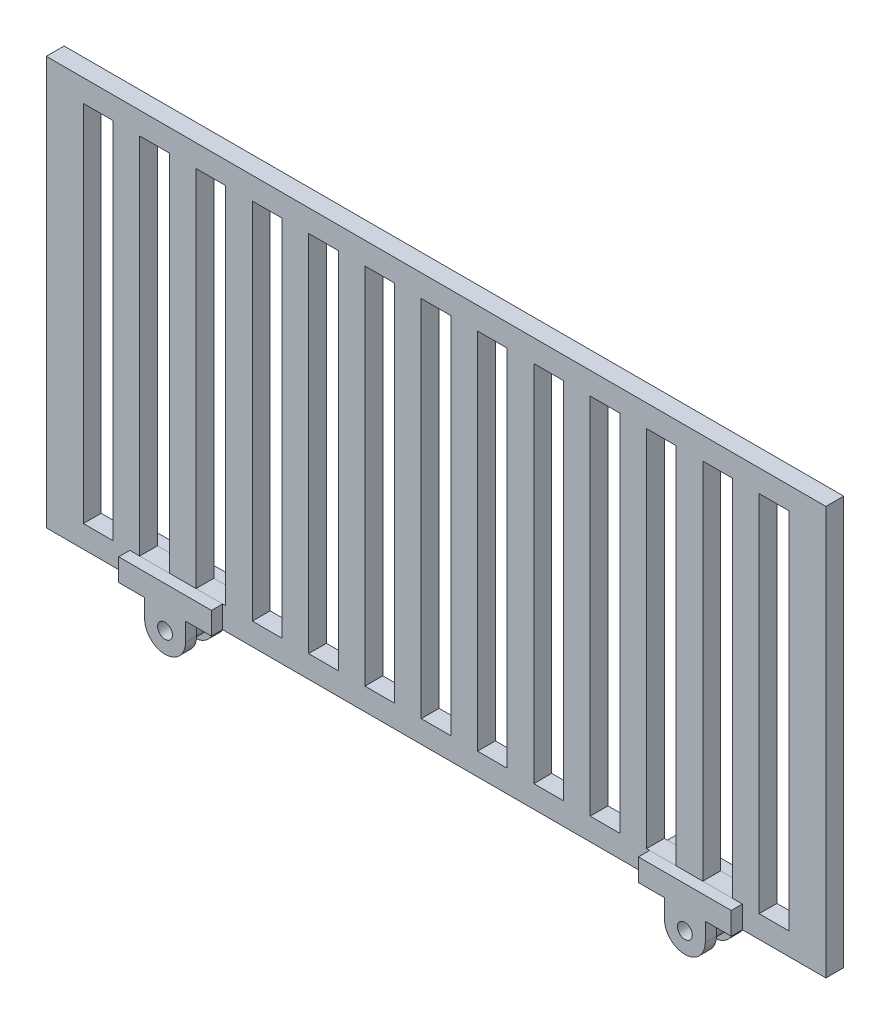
ISO-10303-21;
HEADER;
FILE_DESCRIPTION(('STEP AP214'),'2;1');
FILE_NAME('part.step','',(''),(''),'','','');
FILE_SCHEMA(('AUTOMOTIVE_DESIGN { 1 0 10303 214 1 1 1 1 }'));
ENDSEC;
DATA;
#1=APPLICATION_CONTEXT('core data for automotive mechanical design processes');
#2=APPLICATION_PROTOCOL_DEFINITION('international standard','automotive_design',2000,#1);
#3=PRODUCT_CONTEXT('',#1,'mechanical');
#4=PRODUCT('Part','Part','',(#3));
#5=PRODUCT_RELATED_PRODUCT_CATEGORY('part','',(#4));
#6=PRODUCT_DEFINITION_FORMATION('','',#4);
#7=PRODUCT_DEFINITION_CONTEXT('part definition',#1,'design');
#8=PRODUCT_DEFINITION('design','',#6,#7);
#9=PRODUCT_DEFINITION_SHAPE('','',#8);
#10=(LENGTH_UNIT() NAMED_UNIT(*) SI_UNIT(.MILLI.,.METRE.));
#11=(NAMED_UNIT(*) PLANE_ANGLE_UNIT() SI_UNIT($,.RADIAN.));
#12=(NAMED_UNIT(*) SI_UNIT($,.STERADIAN.) SOLID_ANGLE_UNIT());
#13=UNCERTAINTY_MEASURE_WITH_UNIT(LENGTH_MEASURE(1.E-05),#10,'distance_accuracy_value','');
#14=(GEOMETRIC_REPRESENTATION_CONTEXT(3) GLOBAL_UNCERTAINTY_ASSIGNED_CONTEXT((#13)) GLOBAL_UNIT_ASSIGNED_CONTEXT((#10,
#11,#12)) REPRESENTATION_CONTEXT('',''));
#15=CARTESIAN_POINT('',(0.,0.,0.));
#16=DIRECTION('',(0.,0.,1.));
#17=DIRECTION('',(1.,0.,0.));
#18=AXIS2_PLACEMENT_3D('',#15,#16,#17);
#19=CARTESIAN_POINT('',(70.,-60.,5.4));
#20=DIRECTION('',(0.,0.,1.));
#21=DIRECTION('',(-1.,0.,0.));
#22=AXIS2_PLACEMENT_3D('',#19,#20,#21);
#23=PLANE('',#22);
#24=CARTESIAN_POINT('',(70.,-60.,5.4));
#25=DIRECTION('',(0.,0.,-1.));
#26=DIRECTION('',(-1.,0.,0.));
#27=AXIS2_PLACEMENT_3D('',#24,#25,#26);
#28=CIRCLE('',#27,5.50000000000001);
#29=CARTESIAN_POINT('',(75.5,-60.,5.4));
#30=VERTEX_POINT('',#29);
#31=CARTESIAN_POINT('',(64.5,-60.,5.4));
#32=VERTEX_POINT('',#31);
#33=EDGE_CURVE('E166',#30,#32,#28,.T.);
#34=ORIENTED_EDGE('',*,*,#33,.F.);
#35=DIRECTION('',(0.,-1.,0.));
#36=VECTOR('',#35,1.);
#37=CARTESIAN_POINT('',(75.5,-60.,5.4));
#38=LINE('',#37,#36);
#39=CARTESIAN_POINT('',(75.5,-55.,5.4));
#40=VERTEX_POINT('',#39);
#41=EDGE_CURVE('E140',#40,#30,#38,.T.);
#42=ORIENTED_EDGE('',*,*,#41,.F.);
#43=DIRECTION('',(-1.,0.,0.));
#44=VECTOR('',#43,1.);
#45=CARTESIAN_POINT('',(75.5,-55.,5.4));
#46=LINE('',#45,#44);
#47=CARTESIAN_POINT('',(82.5,-55.,5.4));
#48=VERTEX_POINT('',#47);
#49=EDGE_CURVE('E121',#48,#40,#46,.T.);
#50=ORIENTED_EDGE('',*,*,#49,.F.);
#51=DIRECTION('',(0.,-1.,0.));
#52=VECTOR('',#51,1.);
#53=CARTESIAN_POINT('',(82.5,-55.,5.4));
#54=LINE('',#53,#52);
#55=CARTESIAN_POINT('',(82.5,-49.,5.4));
#56=VERTEX_POINT('',#55);
#57=EDGE_CURVE('E131',#56,#48,#54,.T.);
#58=ORIENTED_EDGE('',*,*,#57,.F.);
#59=DIRECTION('',(1.,0.,0.));
#60=VECTOR('',#59,1.);
#61=CARTESIAN_POINT('',(82.5,-49.,5.4));
#62=LINE('',#61,#60);
#63=CARTESIAN_POINT('',(57.5,-49.,5.4));
#64=VERTEX_POINT('',#63);
#65=EDGE_CURVE('E136',#64,#56,#62,.T.);
#66=ORIENTED_EDGE('',*,*,#65,.F.);
#67=DIRECTION('',(0.,1.,0.));
#68=VECTOR('',#67,1.);
#69=CARTESIAN_POINT('',(57.5,-55.,5.4));
#70=LINE('',#69,#68);
#71=CARTESIAN_POINT('',(57.5,-55.,5.4));
#72=VERTEX_POINT('',#71);
#73=EDGE_CURVE('E192',#72,#64,#70,.T.);
#74=ORIENTED_EDGE('',*,*,#73,.F.);
#75=DIRECTION('',(-1.,0.,0.));
#76=VECTOR('',#75,1.);
#77=CARTESIAN_POINT('',(64.5,-55.,5.4));
#78=LINE('',#77,#76);
#79=CARTESIAN_POINT('',(64.5,-55.,5.4));
#80=VERTEX_POINT('',#79);
#81=EDGE_CURVE('E185',#80,#72,#78,.T.);
#82=ORIENTED_EDGE('',*,*,#81,.F.);
#83=DIRECTION('',(0.,1.,0.));
#84=VECTOR('',#83,1.);
#85=CARTESIAN_POINT('',(64.5,-60.,5.4));
#86=LINE('',#85,#84);
#87=EDGE_CURVE('E175',#32,#80,#86,.T.);
#88=ORIENTED_EDGE('',*,*,#87,.F.);
#89=EDGE_LOOP('',(#34,#42,#50,#58,#66,#74,#82,#88));
#90=FACE_BOUND('',#89,.T.);
#91=CARTESIAN_POINT('',(70.,-60.,5.4));
#92=DIRECTION('',(0.,0.,-1.));
#93=DIRECTION('',(-1.,0.,0.));
#94=AXIS2_PLACEMENT_3D('',#91,#92,#93);
#95=CIRCLE('',#94,2.);
#96=CARTESIAN_POINT('',(68.,-60.,5.4));
#97=VERTEX_POINT('',#96);
#98=EDGE_CURVE('E149',#97,#97,#95,.T.);
#99=ORIENTED_EDGE('',*,*,#98,.T.);
#100=EDGE_LOOP('',(#99));
#101=FACE_BOUND('',#100,.T.);
#102=ADVANCED_FACE('F48',(#90,#101),#23,.T.);
#103=CARTESIAN_POINT('',(70.,-60.,2.4));
#104=DIRECTION('',(0.,0.,1.));
#105=DIRECTION('',(-1.,0.,0.));
#106=AXIS2_PLACEMENT_3D('',#103,#104,#105);
#107=PLANE('',#106);
#108=CARTESIAN_POINT('',(70.,-60.,2.4));
#109=DIRECTION('',(0.,0.,-1.));
#110=DIRECTION('',(-1.,0.,0.));
#111=AXIS2_PLACEMENT_3D('',#108,#109,#110);
#112=CIRCLE('',#111,5.50000000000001);
#113=CARTESIAN_POINT('',(75.5,-60.,2.4));
#114=VERTEX_POINT('',#113);
#115=CARTESIAN_POINT('',(64.5,-60.,2.4));
#116=VERTEX_POINT('',#115);
#117=EDGE_CURVE('E145',#114,#116,#112,.T.);
#118=ORIENTED_EDGE('',*,*,#117,.T.);
#119=DIRECTION('',(0.,1.,0.));
#120=VECTOR('',#119,1.);
#121=CARTESIAN_POINT('',(64.5,-60.,2.4));
#122=LINE('',#121,#120);
#123=CARTESIAN_POINT('',(64.5,-55.,2.4));
#124=VERTEX_POINT('',#123);
#125=EDGE_CURVE('E148',#116,#124,#122,.T.);
#126=ORIENTED_EDGE('',*,*,#125,.T.);
#127=DIRECTION('',(-1.,0.,0.));
#128=VECTOR('',#127,1.);
#129=CARTESIAN_POINT('',(64.5,-55.,2.4));
#130=LINE('',#129,#128);
#131=CARTESIAN_POINT('',(57.5,-55.,2.4));
#132=VERTEX_POINT('',#131);
#133=EDGE_CURVE('E152',#124,#132,#130,.T.);
#134=ORIENTED_EDGE('',*,*,#133,.T.);
#135=DIRECTION('',(0.,1.,0.));
#136=VECTOR('',#135,1.);
#137=CARTESIAN_POINT('',(57.5,-55.,2.4));
#138=LINE('',#137,#136);
#139=CARTESIAN_POINT('',(57.5,-49.,2.4));
#140=VERTEX_POINT('',#139);
#141=EDGE_CURVE('E155',#132,#140,#138,.T.);
#142=ORIENTED_EDGE('',*,*,#141,.T.);
#143=DIRECTION('',(1.,0.,0.));
#144=VECTOR('',#143,1.);
#145=CARTESIAN_POINT('',(82.5,-49.,2.4));
#146=LINE('',#145,#144);
#147=CARTESIAN_POINT('',(82.5,-49.,2.4));
#148=VERTEX_POINT('',#147);
#149=EDGE_CURVE('E158',#140,#148,#146,.T.);
#150=ORIENTED_EDGE('',*,*,#149,.T.);
#151=DIRECTION('',(0.,-1.,0.));
#152=VECTOR('',#151,1.);
#153=CARTESIAN_POINT('',(82.5,-55.,2.4));
#154=LINE('',#153,#152);
#155=CARTESIAN_POINT('',(82.5,-55.,2.4));
#156=VERTEX_POINT('',#155);
#157=EDGE_CURVE('E161',#148,#156,#154,.T.);
#158=ORIENTED_EDGE('',*,*,#157,.T.);
#159=DIRECTION('',(-1.,0.,0.));
#160=VECTOR('',#159,1.);
#161=CARTESIAN_POINT('',(75.5,-55.,2.4));
#162=LINE('',#161,#160);
#163=CARTESIAN_POINT('',(75.5,-55.,2.4));
#164=VERTEX_POINT('',#163);
#165=EDGE_CURVE('E124',#156,#164,#162,.T.);
#166=ORIENTED_EDGE('',*,*,#165,.T.);
#167=DIRECTION('',(0.,-1.,0.));
#168=VECTOR('',#167,1.);
#169=CARTESIAN_POINT('',(75.5,-60.,2.4));
#170=LINE('',#169,#168);
#171=EDGE_CURVE('E164',#164,#114,#170,.T.);
#172=ORIENTED_EDGE('',*,*,#171,.T.);
#173=EDGE_LOOP('',(#118,#126,#134,#142,#150,#158,#166,#172));
#174=FACE_BOUND('',#173,.T.);
#175=CARTESIAN_POINT('',(70.,-60.,2.4));
#176=DIRECTION('',(0.,0.,-1.));
#177=DIRECTION('',(-1.,0.,0.));
#178=AXIS2_PLACEMENT_3D('',#175,#176,#177);
#179=CIRCLE('',#178,2.);
#180=CARTESIAN_POINT('',(68.,-60.,2.4));
#181=VERTEX_POINT('',#180);
#182=EDGE_CURVE('E188',#181,#181,#179,.T.);
#183=ORIENTED_EDGE('',*,*,#182,.F.);
#184=EDGE_LOOP('',(#183));
#185=FACE_BOUND('',#184,.T.);
#186=ADVANCED_FACE('F182',(#174,#185),#107,.F.);
#187=CARTESIAN_POINT('',(70.,-60.,5.4));
#188=DIRECTION('',(0.,0.,-1.));
#189=DIRECTION('',(1.,0.,0.));
#190=AXIS2_PLACEMENT_3D('',#187,#188,#189);
#191=CYLINDRICAL_SURFACE('',#190,5.50000000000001);
#192=ORIENTED_EDGE('',*,*,#117,.F.);
#193=DIRECTION('',(0.,0.,-1.));
#194=VECTOR('',#193,1.);
#195=CARTESIAN_POINT('',(75.5,-60.,5.4));
#196=LINE('',#195,#194);
#197=EDGE_CURVE('E65',#30,#114,#196,.T.);
#198=ORIENTED_EDGE('',*,*,#197,.F.);
#199=ORIENTED_EDGE('',*,*,#33,.T.);
#200=DIRECTION('',(0.,0.,-1.));
#201=VECTOR('',#200,1.);
#202=CARTESIAN_POINT('',(64.5,-60.,5.4));
#203=LINE('',#202,#201);
#204=EDGE_CURVE('E12',#32,#116,#203,.T.);
#205=ORIENTED_EDGE('',*,*,#204,.T.);
#206=EDGE_LOOP('',(#192,#198,#199,#205));
#207=FACE_BOUND('',#206,.T.);
#208=ADVANCED_FACE('F50',(#207),#191,.T.);
#209=CARTESIAN_POINT('',(64.5,-60.,5.4));
#210=DIRECTION('',(1.,0.,0.));
#211=DIRECTION('',(0.,0.,1.));
#212=AXIS2_PLACEMENT_3D('',#209,#210,#211);
#213=PLANE('',#212);
#214=ORIENTED_EDGE('',*,*,#125,.F.);
#215=ORIENTED_EDGE('',*,*,#204,.F.);
#216=ORIENTED_EDGE('',*,*,#87,.T.);
#217=DIRECTION('',(0.,0.,-1.));
#218=VECTOR('',#217,1.);
#219=CARTESIAN_POINT('',(64.5,-55.,5.4));
#220=LINE('',#219,#218);
#221=EDGE_CURVE('E57',#80,#124,#220,.T.);
#222=ORIENTED_EDGE('',*,*,#221,.T.);
#223=EDGE_LOOP('',(#214,#215,#216,#222));
#224=FACE_BOUND('',#223,.T.);
#225=ADVANCED_FACE('F174',(#224),#213,.F.);
#226=CARTESIAN_POINT('',(64.5,-55.,5.4));
#227=DIRECTION('',(0.,1.,0.));
#228=DIRECTION('',(0.,0.,1.));
#229=AXIS2_PLACEMENT_3D('',#226,#227,#228);
#230=PLANE('',#229);
#231=ORIENTED_EDGE('',*,*,#133,.F.);
#232=ORIENTED_EDGE('',*,*,#221,.F.);
#233=ORIENTED_EDGE('',*,*,#81,.T.);
#234=DIRECTION('',(0.,0.,-1.));
#235=VECTOR('',#234,1.);
#236=CARTESIAN_POINT('',(57.5,-55.,5.4));
#237=LINE('',#236,#235);
#238=EDGE_CURVE('E172',#72,#132,#237,.T.);
#239=ORIENTED_EDGE('',*,*,#238,.T.);
#240=EDGE_LOOP('',(#231,#232,#233,#239));
#241=FACE_BOUND('',#240,.T.);
#242=ADVANCED_FACE('F179',(#241),#230,.F.);
#243=CARTESIAN_POINT('',(57.5,-55.,5.4));
#244=DIRECTION('',(1.,0.,0.));
#245=DIRECTION('',(0.,0.,1.));
#246=AXIS2_PLACEMENT_3D('',#243,#244,#245);
#247=PLANE('',#246);
#248=ORIENTED_EDGE('',*,*,#141,.F.);
#249=ORIENTED_EDGE('',*,*,#238,.F.);
#250=ORIENTED_EDGE('',*,*,#73,.T.);
#251=DIRECTION('',(0.,0.,-1.));
#252=VECTOR('',#251,1.);
#253=CARTESIAN_POINT('',(57.5,-49.,5.4));
#254=LINE('',#253,#252);
#255=EDGE_CURVE('E170',#64,#140,#254,.T.);
#256=ORIENTED_EDGE('',*,*,#255,.T.);
#257=EDGE_LOOP('',(#248,#249,#250,#256));
#258=FACE_BOUND('',#257,.T.);
#259=ADVANCED_FACE('F199',(#258),#247,.F.);
#260=CARTESIAN_POINT('',(82.5,-49.,5.4));
#261=DIRECTION('',(0.,-1.,0.));
#262=DIRECTION('',(0.,0.,-1.));
#263=AXIS2_PLACEMENT_3D('',#260,#261,#262);
#264=PLANE('',#263);
#265=ORIENTED_EDGE('',*,*,#149,.F.);
#266=ORIENTED_EDGE('',*,*,#255,.F.);
#267=ORIENTED_EDGE('',*,*,#65,.T.);
#268=DIRECTION('',(0.,0.,-1.));
#269=VECTOR('',#268,1.);
#270=CARTESIAN_POINT('',(82.5,-49.,5.4));
#271=LINE('',#270,#269);
#272=EDGE_CURVE('E128',#56,#148,#271,.T.);
#273=ORIENTED_EDGE('',*,*,#272,.T.);
#274=EDGE_LOOP('',(#265,#266,#267,#273));
#275=FACE_BOUND('',#274,.T.);
#276=ADVANCED_FACE('F196',(#275),#264,.F.);
#277=CARTESIAN_POINT('',(82.5,-55.,5.4));
#278=DIRECTION('',(-1.,0.,0.));
#279=DIRECTION('',(0.,0.,-1.));
#280=AXIS2_PLACEMENT_3D('',#277,#278,#279);
#281=PLANE('',#280);
#282=ORIENTED_EDGE('',*,*,#157,.F.);
#283=ORIENTED_EDGE('',*,*,#272,.F.);
#284=ORIENTED_EDGE('',*,*,#57,.T.);
#285=DIRECTION('',(0.,0.,-1.));
#286=VECTOR('',#285,1.);
#287=CARTESIAN_POINT('',(82.5,-55.,5.4));
#288=LINE('',#287,#286);
#289=EDGE_CURVE('E117',#48,#156,#288,.T.);
#290=ORIENTED_EDGE('',*,*,#289,.T.);
#291=EDGE_LOOP('',(#282,#283,#284,#290));
#292=FACE_BOUND('',#291,.T.);
#293=ADVANCED_FACE('F132',(#292),#281,.F.);
#294=CARTESIAN_POINT('',(75.5,-55.,5.4));
#295=DIRECTION('',(0.,1.,0.));
#296=DIRECTION('',(0.,0.,1.));
#297=AXIS2_PLACEMENT_3D('',#294,#295,#296);
#298=PLANE('',#297);
#299=ORIENTED_EDGE('',*,*,#165,.F.);
#300=ORIENTED_EDGE('',*,*,#289,.F.);
#301=ORIENTED_EDGE('',*,*,#49,.T.);
#302=DIRECTION('',(0.,0.,-1.));
#303=VECTOR('',#302,1.);
#304=CARTESIAN_POINT('',(75.5,-55.,5.4));
#305=LINE('',#304,#303);
#306=EDGE_CURVE('E93',#40,#164,#305,.T.);
#307=ORIENTED_EDGE('',*,*,#306,.T.);
#308=EDGE_LOOP('',(#299,#300,#301,#307));
#309=FACE_BOUND('',#308,.T.);
#310=ADVANCED_FACE('F119',(#309),#298,.F.);
#311=CARTESIAN_POINT('',(75.5,-60.,5.4));
#312=DIRECTION('',(-1.,0.,0.));
#313=DIRECTION('',(0.,0.,-1.));
#314=AXIS2_PLACEMENT_3D('',#311,#312,#313);
#315=PLANE('',#314);
#316=ORIENTED_EDGE('',*,*,#171,.F.);
#317=ORIENTED_EDGE('',*,*,#306,.F.);
#318=ORIENTED_EDGE('',*,*,#41,.T.);
#319=ORIENTED_EDGE('',*,*,#197,.T.);
#320=EDGE_LOOP('',(#316,#317,#318,#319));
#321=FACE_BOUND('',#320,.T.);
#322=ADVANCED_FACE('F217',(#321),#315,.F.);
#323=CARTESIAN_POINT('',(70.,-60.,5.4));
#324=DIRECTION('',(0.,0.,-1.));
#325=DIRECTION('',(1.,0.,0.));
#326=AXIS2_PLACEMENT_3D('',#323,#324,#325);
#327=CYLINDRICAL_SURFACE('',#326,2.);
#328=ORIENTED_EDGE('',*,*,#98,.F.);
#329=EDGE_LOOP('',(#328));
#330=FACE_BOUND('',#329,.T.);
#331=ORIENTED_EDGE('',*,*,#182,.T.);
#332=EDGE_LOOP('',(#331));
#333=FACE_BOUND('',#332,.T.);
#334=ADVANCED_FACE('F215',(#330,#333),#327,.F.);
#335=CLOSED_SHELL('',(#102,#186,#208,#225,#242,#259,#276,#293,#310,#322,#334));
#336=MANIFOLD_SOLID_BREP('B2',#335);
#337=CARTESIAN_POINT('',(70.,-60.,-5.4));
#338=DIRECTION('',(0.,0.,-1.));
#339=DIRECTION('',(-1.,0.,0.));
#340=AXIS2_PLACEMENT_3D('',#337,#338,#339);
#341=PLANE('',#340);
#342=CARTESIAN_POINT('',(70.,-60.,-5.4));
#343=DIRECTION('',(0.,0.,-1.));
#344=DIRECTION('',(-1.,0.,0.));
#345=AXIS2_PLACEMENT_3D('',#342,#343,#344);
#346=CIRCLE('',#345,5.50000000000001);
#347=CARTESIAN_POINT('',(75.5,-60.,-5.4));
#348=VERTEX_POINT('',#347);
#349=CARTESIAN_POINT('',(64.5,-60.,-5.4));
#350=VERTEX_POINT('',#349);
#351=EDGE_CURVE('E423',#348,#350,#346,.T.);
#352=ORIENTED_EDGE('',*,*,#351,.T.);
#353=DIRECTION('',(0.,1.,0.));
#354=VECTOR('',#353,1.);
#355=CARTESIAN_POINT('',(64.5,-60.,-5.4));
#356=LINE('',#355,#354);
#357=CARTESIAN_POINT('',(64.5,-55.,-5.4));
#358=VERTEX_POINT('',#357);
#359=EDGE_CURVE('E449',#350,#358,#356,.T.);
#360=ORIENTED_EDGE('',*,*,#359,.T.);
#361=DIRECTION('',(-1.,0.,0.));
#362=VECTOR('',#361,1.);
#363=CARTESIAN_POINT('',(64.5,-55.,-5.4));
#364=LINE('',#363,#362);
#365=CARTESIAN_POINT('',(57.5,-55.,-5.4));
#366=VERTEX_POINT('',#365);
#367=EDGE_CURVE('E436',#358,#366,#364,.T.);
#368=ORIENTED_EDGE('',*,*,#367,.T.);
#369=DIRECTION('',(0.,1.,0.));
#370=VECTOR('',#369,1.);
#371=CARTESIAN_POINT('',(57.5,-55.,-5.4));
#372=LINE('',#371,#370);
#373=CARTESIAN_POINT('',(57.5,-49.,-5.4));
#374=VERTEX_POINT('',#373);
#375=EDGE_CURVE('E398',#366,#374,#372,.T.);
#376=ORIENTED_EDGE('',*,*,#375,.T.);
#377=DIRECTION('',(1.,0.,0.));
#378=VECTOR('',#377,1.);
#379=CARTESIAN_POINT('',(82.5,-49.,-5.4));
#380=LINE('',#379,#378);
#381=CARTESIAN_POINT('',(82.5,-49.,-5.4));
#382=VERTEX_POINT('',#381);
#383=EDGE_CURVE('E396',#374,#382,#380,.T.);
#384=ORIENTED_EDGE('',*,*,#383,.T.);
#385=DIRECTION('',(0.,-1.,0.));
#386=VECTOR('',#385,1.);
#387=CARTESIAN_POINT('',(82.5,-55.,-5.4));
#388=LINE('',#387,#386);
#389=CARTESIAN_POINT('',(82.5,-55.,-5.4));
#390=VERTEX_POINT('',#389);
#391=EDGE_CURVE('E378',#382,#390,#388,.T.);
#392=ORIENTED_EDGE('',*,*,#391,.T.);
#393=DIRECTION('',(-1.,0.,0.));
#394=VECTOR('',#393,1.);
#395=CARTESIAN_POINT('',(75.5,-55.,-5.4));
#396=LINE('',#395,#394);
#397=CARTESIAN_POINT('',(75.5,-55.,-5.4));
#398=VERTEX_POINT('',#397);
#399=EDGE_CURVE('E387',#390,#398,#396,.T.);
#400=ORIENTED_EDGE('',*,*,#399,.T.);
#401=DIRECTION('',(0.,-1.,0.));
#402=VECTOR('',#401,1.);
#403=CARTESIAN_POINT('',(75.5,-60.,-5.4));
#404=LINE('',#403,#402);
#405=EDGE_CURVE('E390',#398,#348,#404,.T.);
#406=ORIENTED_EDGE('',*,*,#405,.T.);
#407=EDGE_LOOP('',(#352,#360,#368,#376,#384,#392,#400,#406));
#408=FACE_BOUND('',#407,.T.);
#409=CARTESIAN_POINT('',(70.,-60.,-5.4));
#410=DIRECTION('',(0.,0.,-1.));
#411=DIRECTION('',(-1.,0.,0.));
#412=AXIS2_PLACEMENT_3D('',#409,#410,#411);
#413=CIRCLE('',#412,2.);
#414=CARTESIAN_POINT('',(68.,-60.,-5.4));
#415=VERTEX_POINT('',#414);
#416=EDGE_CURVE('E406',#415,#415,#413,.T.);
#417=ORIENTED_EDGE('',*,*,#416,.F.);
#418=EDGE_LOOP('',(#417));
#419=FACE_BOUND('',#418,.T.);
#420=ADVANCED_FACE('F307',(#408,#419),#341,.T.);
#421=CARTESIAN_POINT('',(70.,-60.,-2.4));
#422=DIRECTION('',(0.,0.,-1.));
#423=DIRECTION('',(-1.,0.,0.));
#424=AXIS2_PLACEMENT_3D('',#421,#422,#423);
#425=PLANE('',#424);
#426=CARTESIAN_POINT('',(70.,-60.,-2.4));
#427=DIRECTION('',(0.,0.,-1.));
#428=DIRECTION('',(-1.,0.,0.));
#429=AXIS2_PLACEMENT_3D('',#426,#427,#428);
#430=CIRCLE('',#429,5.50000000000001);
#431=CARTESIAN_POINT('',(75.5,-60.,-2.4));
#432=VERTEX_POINT('',#431);
#433=CARTESIAN_POINT('',(64.5,-60.,-2.4));
#434=VERTEX_POINT('',#433);
#435=EDGE_CURVE('E403',#432,#434,#430,.T.);
#436=ORIENTED_EDGE('',*,*,#435,.F.);
#437=DIRECTION('',(0.,-1.,0.));
#438=VECTOR('',#437,1.);
#439=CARTESIAN_POINT('',(75.5,-60.,-2.4));
#440=LINE('',#439,#438);
#441=CARTESIAN_POINT('',(75.5,-55.,-2.4));
#442=VERTEX_POINT('',#441);
#443=EDGE_CURVE('E421',#442,#432,#440,.T.);
#444=ORIENTED_EDGE('',*,*,#443,.F.);
#445=DIRECTION('',(-1.,0.,0.));
#446=VECTOR('',#445,1.);
#447=CARTESIAN_POINT('',(75.5,-55.,-2.4));
#448=LINE('',#447,#446);
#449=CARTESIAN_POINT('',(82.5,-55.,-2.4));
#450=VERTEX_POINT('',#449);
#451=EDGE_CURVE('E419',#450,#442,#448,.T.);
#452=ORIENTED_EDGE('',*,*,#451,.F.);
#453=DIRECTION('',(0.,-1.,0.));
#454=VECTOR('',#453,1.);
#455=CARTESIAN_POINT('',(82.5,-55.,-2.4));
#456=LINE('',#455,#454);
#457=CARTESIAN_POINT('',(82.5,-49.,-2.4));
#458=VERTEX_POINT('',#457);
#459=EDGE_CURVE('E381',#458,#450,#456,.T.);
#460=ORIENTED_EDGE('',*,*,#459,.F.);
#461=DIRECTION('',(1.,0.,0.));
#462=VECTOR('',#461,1.);
#463=CARTESIAN_POINT('',(82.5,-49.,-2.4));
#464=LINE('',#463,#462);
#465=CARTESIAN_POINT('',(57.5,-49.,-2.4));
#466=VERTEX_POINT('',#465);
#467=EDGE_CURVE('E415',#466,#458,#464,.T.);
#468=ORIENTED_EDGE('',*,*,#467,.F.);
#469=DIRECTION('',(0.,1.,0.));
#470=VECTOR('',#469,1.);
#471=CARTESIAN_POINT('',(57.5,-55.,-2.4));
#472=LINE('',#471,#470);
#473=CARTESIAN_POINT('',(57.5,-55.,-2.4));
#474=VERTEX_POINT('',#473);
#475=EDGE_CURVE('E412',#474,#466,#472,.T.);
#476=ORIENTED_EDGE('',*,*,#475,.F.);
#477=DIRECTION('',(-1.,0.,0.));
#478=VECTOR('',#477,1.);
#479=CARTESIAN_POINT('',(64.5,-55.,-2.4));
#480=LINE('',#479,#478);
#481=CARTESIAN_POINT('',(64.5,-55.,-2.4));
#482=VERTEX_POINT('',#481);
#483=EDGE_CURVE('E409',#482,#474,#480,.T.);
#484=ORIENTED_EDGE('',*,*,#483,.F.);
#485=DIRECTION('',(0.,1.,0.));
#486=VECTOR('',#485,1.);
#487=CARTESIAN_POINT('',(64.5,-60.,-2.4));
#488=LINE('',#487,#486);
#489=EDGE_CURVE('E405',#434,#482,#488,.T.);
#490=ORIENTED_EDGE('',*,*,#489,.F.);
#491=EDGE_LOOP('',(#436,#444,#452,#460,#468,#476,#484,#490));
#492=FACE_BOUND('',#491,.T.);
#493=CARTESIAN_POINT('',(70.,-60.,-2.4));
#494=DIRECTION('',(0.,0.,-1.));
#495=DIRECTION('',(-1.,0.,0.));
#496=AXIS2_PLACEMENT_3D('',#493,#494,#495);
#497=CIRCLE('',#496,2.);
#498=CARTESIAN_POINT('',(68.,-60.,-2.4));
#499=VERTEX_POINT('',#498);
#500=EDGE_CURVE('E454',#499,#499,#497,.T.);
#501=ORIENTED_EDGE('',*,*,#500,.T.);
#502=EDGE_LOOP('',(#501));
#503=FACE_BOUND('',#502,.T.);
#504=ADVANCED_FACE('F443',(#492,#503),#425,.F.);
#505=CARTESIAN_POINT('',(70.,-60.,-5.4));
#506=DIRECTION('',(0.,0.,1.));
#507=DIRECTION('',(1.,0.,0.));
#508=AXIS2_PLACEMENT_3D('',#505,#506,#507);
#509=CYLINDRICAL_SURFACE('',#508,5.50000000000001);
#510=ORIENTED_EDGE('',*,*,#435,.T.);
#511=DIRECTION('',(0.,0.,1.));
#512=VECTOR('',#511,1.);
#513=CARTESIAN_POINT('',(64.5,-60.,-5.4));
#514=LINE('',#513,#512);
#515=EDGE_CURVE('E46',#350,#434,#514,.T.);
#516=ORIENTED_EDGE('',*,*,#515,.F.);
#517=ORIENTED_EDGE('',*,*,#351,.F.);
#518=DIRECTION('',(0.,0.,1.));
#519=VECTOR('',#518,1.);
#520=CARTESIAN_POINT('',(75.5,-60.,-5.4));
#521=LINE('',#520,#519);
#522=EDGE_CURVE('E324',#348,#432,#521,.T.);
#523=ORIENTED_EDGE('',*,*,#522,.T.);
#524=EDGE_LOOP('',(#510,#516,#517,#523));
#525=FACE_BOUND('',#524,.T.);
#526=ADVANCED_FACE('F309',(#525),#509,.T.);
#527=CARTESIAN_POINT('',(64.5,-60.,-5.4));
#528=DIRECTION('',(1.,0.,0.));
#529=DIRECTION('',(0.,0.,-1.));
#530=AXIS2_PLACEMENT_3D('',#527,#528,#529);
#531=PLANE('',#530);
#532=ORIENTED_EDGE('',*,*,#489,.T.);
#533=DIRECTION('',(0.,0.,1.));
#534=VECTOR('',#533,1.);
#535=CARTESIAN_POINT('',(64.5,-55.,-5.4));
#536=LINE('',#535,#534);
#537=EDGE_CURVE('E316',#358,#482,#536,.T.);
#538=ORIENTED_EDGE('',*,*,#537,.F.);
#539=ORIENTED_EDGE('',*,*,#359,.F.);
#540=ORIENTED_EDGE('',*,*,#515,.T.);
#541=EDGE_LOOP('',(#532,#538,#539,#540));
#542=FACE_BOUND('',#541,.T.);
#543=ADVANCED_FACE('F440',(#542),#531,.F.);
#544=CARTESIAN_POINT('',(64.5,-55.,-5.4));
#545=DIRECTION('',(0.,1.,0.));
#546=DIRECTION('',(0.,0.,-1.));
#547=AXIS2_PLACEMENT_3D('',#544,#545,#546);
#548=PLANE('',#547);
#549=ORIENTED_EDGE('',*,*,#483,.T.);
#550=DIRECTION('',(0.,0.,1.));
#551=VECTOR('',#550,1.);
#552=CARTESIAN_POINT('',(57.5,-55.,-5.4));
#553=LINE('',#552,#551);
#554=EDGE_CURVE('E429',#366,#474,#553,.T.);
#555=ORIENTED_EDGE('',*,*,#554,.F.);
#556=ORIENTED_EDGE('',*,*,#367,.F.);
#557=ORIENTED_EDGE('',*,*,#537,.T.);
#558=EDGE_LOOP('',(#549,#555,#556,#557));
#559=FACE_BOUND('',#558,.T.);
#560=ADVANCED_FACE('F432',(#559),#548,.F.);
#561=CARTESIAN_POINT('',(57.5,-55.,-5.4));
#562=DIRECTION('',(1.,0.,0.));
#563=DIRECTION('',(0.,0.,-1.));
#564=AXIS2_PLACEMENT_3D('',#561,#562,#563);
#565=PLANE('',#564);
#566=ORIENTED_EDGE('',*,*,#475,.T.);
#567=DIRECTION('',(0.,0.,1.));
#568=VECTOR('',#567,1.);
#569=CARTESIAN_POINT('',(57.5,-49.,-5.4));
#570=LINE('',#569,#568);
#571=EDGE_CURVE('E427',#374,#466,#570,.T.);
#572=ORIENTED_EDGE('',*,*,#571,.F.);
#573=ORIENTED_EDGE('',*,*,#375,.F.);
#574=ORIENTED_EDGE('',*,*,#554,.T.);
#575=EDGE_LOOP('',(#566,#572,#573,#574));
#576=FACE_BOUND('',#575,.T.);
#577=ADVANCED_FACE('F447',(#576),#565,.F.);
#578=CARTESIAN_POINT('',(82.5,-49.,-5.4));
#579=DIRECTION('',(0.,-1.,0.));
#580=DIRECTION('',(0.,0.,1.));
#581=AXIS2_PLACEMENT_3D('',#578,#579,#580);
#582=PLANE('',#581);
#583=ORIENTED_EDGE('',*,*,#467,.T.);
#584=DIRECTION('',(0.,0.,1.));
#585=VECTOR('',#584,1.);
#586=CARTESIAN_POINT('',(82.5,-49.,-5.4));
#587=LINE('',#586,#585);
#588=EDGE_CURVE('E384',#382,#458,#587,.T.);
#589=ORIENTED_EDGE('',*,*,#588,.F.);
#590=ORIENTED_EDGE('',*,*,#383,.F.);
#591=ORIENTED_EDGE('',*,*,#571,.T.);
#592=EDGE_LOOP('',(#583,#589,#590,#591));
#593=FACE_BOUND('',#592,.T.);
#594=ADVANCED_FACE('F477',(#593),#582,.F.);
#595=CARTESIAN_POINT('',(82.5,-55.,-5.4));
#596=DIRECTION('',(-1.,0.,0.));
#597=DIRECTION('',(0.,0.,1.));
#598=AXIS2_PLACEMENT_3D('',#595,#596,#597);
#599=PLANE('',#598);
#600=ORIENTED_EDGE('',*,*,#459,.T.);
#601=DIRECTION('',(0.,0.,1.));
#602=VECTOR('',#601,1.);
#603=CARTESIAN_POINT('',(82.5,-55.,-5.4));
#604=LINE('',#603,#602);
#605=EDGE_CURVE('E374',#390,#450,#604,.T.);
#606=ORIENTED_EDGE('',*,*,#605,.F.);
#607=ORIENTED_EDGE('',*,*,#391,.F.);
#608=ORIENTED_EDGE('',*,*,#588,.T.);
#609=EDGE_LOOP('',(#600,#606,#607,#608));
#610=FACE_BOUND('',#609,.T.);
#611=ADVANCED_FACE('F376',(#610),#599,.F.);
#612=CARTESIAN_POINT('',(75.5,-55.,-5.4));
#613=DIRECTION('',(0.,1.,0.));
#614=DIRECTION('',(0.,0.,-1.));
#615=AXIS2_PLACEMENT_3D('',#612,#613,#614);
#616=PLANE('',#615);
#617=ORIENTED_EDGE('',*,*,#451,.T.);
#618=DIRECTION('',(0.,0.,1.));
#619=VECTOR('',#618,1.);
#620=CARTESIAN_POINT('',(75.5,-55.,-5.4));
#621=LINE('',#620,#619);
#622=EDGE_CURVE('E349',#398,#442,#621,.T.);
#623=ORIENTED_EDGE('',*,*,#622,.F.);
#624=ORIENTED_EDGE('',*,*,#399,.F.);
#625=ORIENTED_EDGE('',*,*,#605,.T.);
#626=EDGE_LOOP('',(#617,#623,#624,#625));
#627=FACE_BOUND('',#626,.T.);
#628=ADVANCED_FACE('F388',(#627),#616,.F.);
#629=CARTESIAN_POINT('',(75.5,-60.,-5.4));
#630=DIRECTION('',(-1.,0.,0.));
#631=DIRECTION('',(0.,0.,1.));
#632=AXIS2_PLACEMENT_3D('',#629,#630,#631);
#633=PLANE('',#632);
#634=ORIENTED_EDGE('',*,*,#443,.T.);
#635=ORIENTED_EDGE('',*,*,#522,.F.);
#636=ORIENTED_EDGE('',*,*,#405,.F.);
#637=ORIENTED_EDGE('',*,*,#622,.T.);
#638=EDGE_LOOP('',(#634,#635,#636,#637));
#639=FACE_BOUND('',#638,.T.);
#640=ADVANCED_FACE('F470',(#639),#633,.F.);
#641=CARTESIAN_POINT('',(70.,-60.,-5.4));
#642=DIRECTION('',(0.,0.,1.));
#643=DIRECTION('',(1.,0.,0.));
#644=AXIS2_PLACEMENT_3D('',#641,#642,#643);
#645=CYLINDRICAL_SURFACE('',#644,2.);
#646=ORIENTED_EDGE('',*,*,#416,.T.);
#647=EDGE_LOOP('',(#646));
#648=FACE_BOUND('',#647,.T.);
#649=ORIENTED_EDGE('',*,*,#500,.F.);
#650=EDGE_LOOP('',(#649));
#651=FACE_BOUND('',#650,.T.);
#652=ADVANCED_FACE('F460',(#648,#651),#645,.F.);
#653=CLOSED_SHELL('',(#420,#504,#526,#543,#560,#577,#594,#611,#628,#640,#652));
#654=MANIFOLD_SOLID_BREP('B6',#653);
#655=CARTESIAN_POINT('',(-70.,-60.,-5.4));
#656=DIRECTION('',(0.,0.,-1.));
#657=DIRECTION('',(1.,0.,0.));
#658=AXIS2_PLACEMENT_3D('',#655,#656,#657);
#659=PLANE('',#658);
#660=CARTESIAN_POINT('',(-70.,-60.,-5.4));
#661=DIRECTION('',(0.,0.,1.));
#662=DIRECTION('',(1.,0.,0.));
#663=AXIS2_PLACEMENT_3D('',#660,#661,#662);
#664=CIRCLE('',#663,5.50000000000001);
#665=CARTESIAN_POINT('',(-75.5,-60.,-5.4));
#666=VERTEX_POINT('',#665);
#667=CARTESIAN_POINT('',(-64.5,-60.,-5.4));
#668=VERTEX_POINT('',#667);
#669=EDGE_CURVE('E684',#666,#668,#664,.T.);
#670=ORIENTED_EDGE('',*,*,#669,.F.);
#671=DIRECTION('',(0.,-1.,0.));
#672=VECTOR('',#671,1.);
#673=CARTESIAN_POINT('',(-75.5,-60.,-5.4));
#674=LINE('',#673,#672);
#675=CARTESIAN_POINT('',(-75.5,-55.,-5.4));
#676=VERTEX_POINT('',#675);
#677=EDGE_CURVE('E658',#676,#666,#674,.T.);
#678=ORIENTED_EDGE('',*,*,#677,.F.);
#679=DIRECTION('',(1.,0.,0.));
#680=VECTOR('',#679,1.);
#681=CARTESIAN_POINT('',(-75.5,-55.,-5.4));
#682=LINE('',#681,#680);
#683=CARTESIAN_POINT('',(-82.5,-55.,-5.4));
#684=VERTEX_POINT('',#683);
#685=EDGE_CURVE('E639',#684,#676,#682,.T.);
#686=ORIENTED_EDGE('',*,*,#685,.F.);
#687=DIRECTION('',(0.,-1.,0.));
#688=VECTOR('',#687,1.);
#689=CARTESIAN_POINT('',(-82.5,-55.,-5.4));
#690=LINE('',#689,#688);
#691=CARTESIAN_POINT('',(-82.5,-49.,-5.4));
#692=VERTEX_POINT('',#691);
#693=EDGE_CURVE('E649',#692,#684,#690,.T.);
#694=ORIENTED_EDGE('',*,*,#693,.F.);
#695=DIRECTION('',(-1.,0.,0.));
#696=VECTOR('',#695,1.);
#697=CARTESIAN_POINT('',(-82.5,-49.,-5.4));
#698=LINE('',#697,#696);
#699=CARTESIAN_POINT('',(-57.5,-49.,-5.4));
#700=VERTEX_POINT('',#699);
#701=EDGE_CURVE('E654',#700,#692,#698,.T.);
#702=ORIENTED_EDGE('',*,*,#701,.F.);
#703=DIRECTION('',(0.,1.,0.));
#704=VECTOR('',#703,1.);
#705=CARTESIAN_POINT('',(-57.5,-55.,-5.4));
#706=LINE('',#705,#704);
#707=CARTESIAN_POINT('',(-57.5,-55.,-5.4));
#708=VERTEX_POINT('',#707);
#709=EDGE_CURVE('E710',#708,#700,#706,.T.);
#710=ORIENTED_EDGE('',*,*,#709,.F.);
#711=DIRECTION('',(1.,0.,0.));
#712=VECTOR('',#711,1.);
#713=CARTESIAN_POINT('',(-64.5,-55.,-5.4));
#714=LINE('',#713,#712);
#715=CARTESIAN_POINT('',(-64.5,-55.,-5.4));
#716=VERTEX_POINT('',#715);
#717=EDGE_CURVE('E703',#716,#708,#714,.T.);
#718=ORIENTED_EDGE('',*,*,#717,.F.);
#719=DIRECTION('',(0.,1.,0.));
#720=VECTOR('',#719,1.);
#721=CARTESIAN_POINT('',(-64.5,-60.,-5.4));
#722=LINE('',#721,#720);
#723=EDGE_CURVE('E693',#668,#716,#722,.T.);
#724=ORIENTED_EDGE('',*,*,#723,.F.);
#725=EDGE_LOOP('',(#670,#678,#686,#694,#702,#710,#718,#724));
#726=FACE_BOUND('',#725,.T.);
#727=CARTESIAN_POINT('',(-70.,-60.,-5.4));
#728=DIRECTION('',(0.,0.,1.));
#729=DIRECTION('',(1.,0.,0.));
#730=AXIS2_PLACEMENT_3D('',#727,#728,#729);
#731=CIRCLE('',#730,2.);
#732=CARTESIAN_POINT('',(-68.,-60.,-5.4));
#733=VERTEX_POINT('',#732);
#734=EDGE_CURVE('E667',#733,#733,#731,.T.);
#735=ORIENTED_EDGE('',*,*,#734,.T.);
#736=EDGE_LOOP('',(#735));
#737=FACE_BOUND('',#736,.T.);
#738=ADVANCED_FACE('F566',(#726,#737),#659,.T.);
#739=CARTESIAN_POINT('',(-70.,-60.,-2.4));
#740=DIRECTION('',(0.,0.,-1.));
#741=DIRECTION('',(1.,0.,0.));
#742=AXIS2_PLACEMENT_3D('',#739,#740,#741);
#743=PLANE('',#742);
#744=CARTESIAN_POINT('',(-70.,-60.,-2.4));
#745=DIRECTION('',(0.,0.,1.));
#746=DIRECTION('',(1.,0.,0.));
#747=AXIS2_PLACEMENT_3D('',#744,#745,#746);
#748=CIRCLE('',#747,5.50000000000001);
#749=CARTESIAN_POINT('',(-75.5,-60.,-2.4));
#750=VERTEX_POINT('',#749);
#751=CARTESIAN_POINT('',(-64.5,-60.,-2.4));
#752=VERTEX_POINT('',#751);
#753=EDGE_CURVE('E663',#750,#752,#748,.T.);
#754=ORIENTED_EDGE('',*,*,#753,.T.);
#755=DIRECTION('',(0.,1.,0.));
#756=VECTOR('',#755,1.);
#757=CARTESIAN_POINT('',(-64.5,-60.,-2.4));
#758=LINE('',#757,#756);
#759=CARTESIAN_POINT('',(-64.5,-55.,-2.4));
#760=VERTEX_POINT('',#759);
#761=EDGE_CURVE('E666',#752,#760,#758,.T.);
#762=ORIENTED_EDGE('',*,*,#761,.T.);
#763=DIRECTION('',(1.,0.,0.));
#764=VECTOR('',#763,1.);
#765=CARTESIAN_POINT('',(-64.5,-55.,-2.4));
#766=LINE('',#765,#764);
#767=CARTESIAN_POINT('',(-57.5,-55.,-2.4));
#768=VERTEX_POINT('',#767);
#769=EDGE_CURVE('E670',#760,#768,#766,.T.);
#770=ORIENTED_EDGE('',*,*,#769,.T.);
#771=DIRECTION('',(0.,1.,0.));
#772=VECTOR('',#771,1.);
#773=CARTESIAN_POINT('',(-57.5,-55.,-2.4));
#774=LINE('',#773,#772);
#775=CARTESIAN_POINT('',(-57.5,-49.,-2.4));
#776=VERTEX_POINT('',#775);
#777=EDGE_CURVE('E673',#768,#776,#774,.T.);
#778=ORIENTED_EDGE('',*,*,#777,.T.);
#779=DIRECTION('',(-1.,0.,0.));
#780=VECTOR('',#779,1.);
#781=CARTESIAN_POINT('',(-82.5,-49.,-2.4));
#782=LINE('',#781,#780);
#783=CARTESIAN_POINT('',(-82.5,-49.,-2.4));
#784=VERTEX_POINT('',#783);
#785=EDGE_CURVE('E676',#776,#784,#782,.T.);
#786=ORIENTED_EDGE('',*,*,#785,.T.);
#787=DIRECTION('',(0.,-1.,0.));
#788=VECTOR('',#787,1.);
#789=CARTESIAN_POINT('',(-82.5,-55.,-2.4));
#790=LINE('',#789,#788);
#791=CARTESIAN_POINT('',(-82.5,-55.,-2.4));
#792=VERTEX_POINT('',#791);
#793=EDGE_CURVE('E679',#784,#792,#790,.T.);
#794=ORIENTED_EDGE('',*,*,#793,.T.);
#795=DIRECTION('',(1.,0.,0.));
#796=VECTOR('',#795,1.);
#797=CARTESIAN_POINT('',(-75.5,-55.,-2.4));
#798=LINE('',#797,#796);
#799=CARTESIAN_POINT('',(-75.5,-55.,-2.4));
#800=VERTEX_POINT('',#799);
#801=EDGE_CURVE('E642',#792,#800,#798,.T.);
#802=ORIENTED_EDGE('',*,*,#801,.T.);
#803=DIRECTION('',(0.,-1.,0.));
#804=VECTOR('',#803,1.);
#805=CARTESIAN_POINT('',(-75.5,-60.,-2.4));
#806=LINE('',#805,#804);
#807=EDGE_CURVE('E682',#800,#750,#806,.T.);
#808=ORIENTED_EDGE('',*,*,#807,.T.);
#809=EDGE_LOOP('',(#754,#762,#770,#778,#786,#794,#802,#808));
#810=FACE_BOUND('',#809,.T.);
#811=CARTESIAN_POINT('',(-70.,-60.,-2.4));
#812=DIRECTION('',(0.,0.,1.));
#813=DIRECTION('',(1.,0.,0.));
#814=AXIS2_PLACEMENT_3D('',#811,#812,#813);
#815=CIRCLE('',#814,2.);
#816=CARTESIAN_POINT('',(-68.,-60.,-2.4));
#817=VERTEX_POINT('',#816);
#818=EDGE_CURVE('E706',#817,#817,#815,.T.);
#819=ORIENTED_EDGE('',*,*,#818,.F.);
#820=EDGE_LOOP('',(#819));
#821=FACE_BOUND('',#820,.T.);
#822=ADVANCED_FACE('F700',(#810,#821),#743,.F.);
#823=CARTESIAN_POINT('',(-70.,-60.,-5.4));
#824=DIRECTION('',(0.,0.,1.));
#825=DIRECTION('',(-1.,0.,0.));
#826=AXIS2_PLACEMENT_3D('',#823,#824,#825);
#827=CYLINDRICAL_SURFACE('',#826,5.50000000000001);
#828=ORIENTED_EDGE('',*,*,#753,.F.);
#829=DIRECTION('',(0.,0.,1.));
#830=VECTOR('',#829,1.);
#831=CARTESIAN_POINT('',(-75.5,-60.,-5.4));
#832=LINE('',#831,#830);
#833=EDGE_CURVE('E583',#666,#750,#832,.T.);
#834=ORIENTED_EDGE('',*,*,#833,.F.);
#835=ORIENTED_EDGE('',*,*,#669,.T.);
#836=DIRECTION('',(0.,0.,1.));
#837=VECTOR('',#836,1.);
#838=CARTESIAN_POINT('',(-64.5,-60.,-5.4));
#839=LINE('',#838,#837);
#840=EDGE_CURVE('E305',#668,#752,#839,.T.);
#841=ORIENTED_EDGE('',*,*,#840,.T.);
#842=EDGE_LOOP('',(#828,#834,#835,#841));
#843=FACE_BOUND('',#842,.T.);
#844=ADVANCED_FACE('F568',(#843),#827,.T.);
#845=CARTESIAN_POINT('',(-64.5,-60.,-5.4));
#846=DIRECTION('',(-1.,0.,0.));
#847=DIRECTION('',(0.,0.,-1.));
#848=AXIS2_PLACEMENT_3D('',#845,#846,#847);
#849=PLANE('',#848);
#850=ORIENTED_EDGE('',*,*,#761,.F.);
#851=ORIENTED_EDGE('',*,*,#840,.F.);
#852=ORIENTED_EDGE('',*,*,#723,.T.);
#853=DIRECTION('',(0.,0.,1.));
#854=VECTOR('',#853,1.);
#855=CARTESIAN_POINT('',(-64.5,-55.,-5.4));
#856=LINE('',#855,#854);
#857=EDGE_CURVE('E575',#716,#760,#856,.T.);
#858=ORIENTED_EDGE('',*,*,#857,.T.);
#859=EDGE_LOOP('',(#850,#851,#852,#858));
#860=FACE_BOUND('',#859,.T.);
#861=ADVANCED_FACE('F692',(#860),#849,.F.);
#862=CARTESIAN_POINT('',(-64.5,-55.,-5.4));
#863=DIRECTION('',(0.,1.,0.));
#864=DIRECTION('',(0.,0.,-1.));
#865=AXIS2_PLACEMENT_3D('',#862,#863,#864);
#866=PLANE('',#865);
#867=ORIENTED_EDGE('',*,*,#769,.F.);
#868=ORIENTED_EDGE('',*,*,#857,.F.);
#869=ORIENTED_EDGE('',*,*,#717,.T.);
#870=DIRECTION('',(0.,0.,1.));
#871=VECTOR('',#870,1.);
#872=CARTESIAN_POINT('',(-57.5,-55.,-5.4));
#873=LINE('',#872,#871);
#874=EDGE_CURVE('E690',#708,#768,#873,.T.);
#875=ORIENTED_EDGE('',*,*,#874,.T.);
#876=EDGE_LOOP('',(#867,#868,#869,#875));
#877=FACE_BOUND('',#876,.T.);
#878=ADVANCED_FACE('F697',(#877),#866,.F.);
#879=CARTESIAN_POINT('',(-57.5,-55.,-5.4));
#880=DIRECTION('',(-1.,0.,0.));
#881=DIRECTION('',(0.,0.,-1.));
#882=AXIS2_PLACEMENT_3D('',#879,#880,#881);
#883=PLANE('',#882);
#884=ORIENTED_EDGE('',*,*,#777,.F.);
#885=ORIENTED_EDGE('',*,*,#874,.F.);
#886=ORIENTED_EDGE('',*,*,#709,.T.);
#887=DIRECTION('',(0.,0.,1.));
#888=VECTOR('',#887,1.);
#889=CARTESIAN_POINT('',(-57.5,-49.,-5.4));
#890=LINE('',#889,#888);
#891=EDGE_CURVE('E688',#700,#776,#890,.T.);
#892=ORIENTED_EDGE('',*,*,#891,.T.);
#893=EDGE_LOOP('',(#884,#885,#886,#892));
#894=FACE_BOUND('',#893,.T.);
#895=ADVANCED_FACE('F717',(#894),#883,.F.);
#896=CARTESIAN_POINT('',(-82.5,-49.,-5.4));
#897=DIRECTION('',(0.,-1.,0.));
#898=DIRECTION('',(0.,0.,1.));
#899=AXIS2_PLACEMENT_3D('',#896,#897,#898);
#900=PLANE('',#899);
#901=ORIENTED_EDGE('',*,*,#785,.F.);
#902=ORIENTED_EDGE('',*,*,#891,.F.);
#903=ORIENTED_EDGE('',*,*,#701,.T.);
#904=DIRECTION('',(0.,0.,1.));
#905=VECTOR('',#904,1.);
#906=CARTESIAN_POINT('',(-82.5,-49.,-5.4));
#907=LINE('',#906,#905);
#908=EDGE_CURVE('E646',#692,#784,#907,.T.);
#909=ORIENTED_EDGE('',*,*,#908,.T.);
#910=EDGE_LOOP('',(#901,#902,#903,#909));
#911=FACE_BOUND('',#910,.T.);
#912=ADVANCED_FACE('F714',(#911),#900,.F.);
#913=CARTESIAN_POINT('',(-82.5,-55.,-5.4));
#914=DIRECTION('',(1.,0.,0.));
#915=DIRECTION('',(0.,0.,1.));
#916=AXIS2_PLACEMENT_3D('',#913,#914,#915);
#917=PLANE('',#916);
#918=ORIENTED_EDGE('',*,*,#793,.F.);
#919=ORIENTED_EDGE('',*,*,#908,.F.);
#920=ORIENTED_EDGE('',*,*,#693,.T.);
#921=DIRECTION('',(0.,0.,1.));
#922=VECTOR('',#921,1.);
#923=CARTESIAN_POINT('',(-82.5,-55.,-5.4));
#924=LINE('',#923,#922);
#925=EDGE_CURVE('E635',#684,#792,#924,.T.);
#926=ORIENTED_EDGE('',*,*,#925,.T.);
#927=EDGE_LOOP('',(#918,#919,#920,#926));
#928=FACE_BOUND('',#927,.T.);
#929=ADVANCED_FACE('F650',(#928),#917,.F.);
#930=CARTESIAN_POINT('',(-75.5,-55.,-5.4));
#931=DIRECTION('',(0.,1.,0.));
#932=DIRECTION('',(0.,0.,-1.));
#933=AXIS2_PLACEMENT_3D('',#930,#931,#932);
#934=PLANE('',#933);
#935=ORIENTED_EDGE('',*,*,#801,.F.);
#936=ORIENTED_EDGE('',*,*,#925,.F.);
#937=ORIENTED_EDGE('',*,*,#685,.T.);
#938=DIRECTION('',(0.,0.,1.));
#939=VECTOR('',#938,1.);
#940=CARTESIAN_POINT('',(-75.5,-55.,-5.4));
#941=LINE('',#940,#939);
#942=EDGE_CURVE('E611',#676,#800,#941,.T.);
#943=ORIENTED_EDGE('',*,*,#942,.T.);
#944=EDGE_LOOP('',(#935,#936,#937,#943));
#945=FACE_BOUND('',#944,.T.);
#946=ADVANCED_FACE('F637',(#945),#934,.F.);
#947=CARTESIAN_POINT('',(-75.5,-60.,-5.4));
#948=DIRECTION('',(1.,0.,0.));
#949=DIRECTION('',(0.,0.,1.));
#950=AXIS2_PLACEMENT_3D('',#947,#948,#949);
#951=PLANE('',#950);
#952=ORIENTED_EDGE('',*,*,#807,.F.);
#953=ORIENTED_EDGE('',*,*,#942,.F.);
#954=ORIENTED_EDGE('',*,*,#677,.T.);
#955=ORIENTED_EDGE('',*,*,#833,.T.);
#956=EDGE_LOOP('',(#952,#953,#954,#955));
#957=FACE_BOUND('',#956,.T.);
#958=ADVANCED_FACE('F735',(#957),#951,.F.);
#959=CARTESIAN_POINT('',(-70.,-60.,-5.4));
#960=DIRECTION('',(0.,0.,1.));
#961=DIRECTION('',(-1.,0.,0.));
#962=AXIS2_PLACEMENT_3D('',#959,#960,#961);
#963=CYLINDRICAL_SURFACE('',#962,2.);
#964=ORIENTED_EDGE('',*,*,#734,.F.);
#965=EDGE_LOOP('',(#964));
#966=FACE_BOUND('',#965,.T.);
#967=ORIENTED_EDGE('',*,*,#818,.T.);
#968=EDGE_LOOP('',(#967));
#969=FACE_BOUND('',#968,.T.);
#970=ADVANCED_FACE('F733',(#966,#969),#963,.F.);
#971=CLOSED_SHELL('',(#738,#822,#844,#861,#878,#895,#912,#929,#946,#958,#970));
#972=MANIFOLD_SOLID_BREP('B40',#971);
#973=CARTESIAN_POINT('',(-70.,-60.,5.4));
#974=DIRECTION('',(0.,0.,1.));
#975=DIRECTION('',(1.,0.,0.));
#976=AXIS2_PLACEMENT_3D('',#973,#974,#975);
#977=PLANE('',#976);
#978=CARTESIAN_POINT('',(-70.,-60.,5.4));
#979=DIRECTION('',(0.,0.,1.));
#980=DIRECTION('',(1.,0.,0.));
#981=AXIS2_PLACEMENT_3D('',#978,#979,#980);
#982=CIRCLE('',#981,5.50000000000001);
#983=CARTESIAN_POINT('',(-75.5,-60.,5.4));
#984=VERTEX_POINT('',#983);
#985=CARTESIAN_POINT('',(-64.5,-60.,5.4));
#986=VERTEX_POINT('',#985);
#987=EDGE_CURVE('E935',#984,#986,#982,.T.);
#988=ORIENTED_EDGE('',*,*,#987,.T.);
#989=DIRECTION('',(0.,1.,0.));
#990=VECTOR('',#989,1.);
#991=CARTESIAN_POINT('',(-64.5,-60.,5.4));
#992=LINE('',#991,#990);
#993=CARTESIAN_POINT('',(-64.5,-55.,5.4));
#994=VERTEX_POINT('',#993);
#995=EDGE_CURVE('E883',#986,#994,#992,.T.);
#996=ORIENTED_EDGE('',*,*,#995,.T.);
#997=DIRECTION('',(1.,0.,0.));
#998=VECTOR('',#997,1.);
#999=CARTESIAN_POINT('',(-64.5,-55.,5.4));
#1000=LINE('',#999,#998);
#1001=CARTESIAN_POINT('',(-57.5,-55.,5.4));
#1002=VERTEX_POINT('',#1001);
#1003=EDGE_CURVE('E950',#994,#1002,#1000,.T.);
#1004=ORIENTED_EDGE('',*,*,#1003,.T.);
#1005=DIRECTION('',(0.,1.,0.));
#1006=VECTOR('',#1005,1.);
#1007=CARTESIAN_POINT('',(-57.5,-55.,5.4));
#1008=LINE('',#1007,#1006);
#1009=CARTESIAN_POINT('',(-57.5,-49.,5.4));
#1010=VERTEX_POINT('',#1009);
#1011=EDGE_CURVE('E963',#1002,#1010,#1008,.T.);
#1012=ORIENTED_EDGE('',*,*,#1011,.T.);
#1013=DIRECTION('',(-1.,0.,0.));
#1014=VECTOR('',#1013,1.);
#1015=CARTESIAN_POINT('',(-82.5,-49.,5.4));
#1016=LINE('',#1015,#1014);
#1017=CARTESIAN_POINT('',(-82.5,-49.,5.4));
#1018=VERTEX_POINT('',#1017);
#1019=EDGE_CURVE('E902',#1010,#1018,#1016,.T.);
#1020=ORIENTED_EDGE('',*,*,#1019,.T.);
#1021=DIRECTION('',(0.,-1.,0.));
#1022=VECTOR('',#1021,1.);
#1023=CARTESIAN_POINT('',(-82.5,-55.,5.4));
#1024=LINE('',#1023,#1022);
#1025=CARTESIAN_POINT('',(-82.5,-55.,5.4));
#1026=VERTEX_POINT('',#1025);
#1027=EDGE_CURVE('E896',#1018,#1026,#1024,.T.);
#1028=ORIENTED_EDGE('',*,*,#1027,.T.);
#1029=DIRECTION('',(1.,0.,0.));
#1030=VECTOR('',#1029,1.);
#1031=CARTESIAN_POINT('',(-75.5,-55.,5.4));
#1032=LINE('',#1031,#1030);
#1033=CARTESIAN_POINT('',(-75.5,-55.,5.4));
#1034=VERTEX_POINT('',#1033);
#1035=EDGE_CURVE('E900',#1026,#1034,#1032,.T.);
#1036=ORIENTED_EDGE('',*,*,#1035,.T.);
#1037=DIRECTION('',(0.,-1.,0.));
#1038=VECTOR('',#1037,1.);
#1039=CARTESIAN_POINT('',(-75.5,-60.,5.4));
#1040=LINE('',#1039,#1038);
#1041=EDGE_CURVE('E840',#1034,#984,#1040,.T.);
#1042=ORIENTED_EDGE('',*,*,#1041,.T.);
#1043=EDGE_LOOP('',(#988,#996,#1004,#1012,#1020,#1028,#1036,#1042));
#1044=FACE_BOUND('',#1043,.T.);
#1045=CARTESIAN_POINT('',(-70.,-60.,5.4));
#1046=DIRECTION('',(0.,0.,1.));
#1047=DIRECTION('',(1.,0.,0.));
#1048=AXIS2_PLACEMENT_3D('',#1045,#1046,#1047);
#1049=CIRCLE('',#1048,2.);
#1050=CARTESIAN_POINT('',(-68.,-60.,5.4));
#1051=VERTEX_POINT('',#1050);
#1052=EDGE_CURVE('E924',#1051,#1051,#1049,.T.);
#1053=ORIENTED_EDGE('',*,*,#1052,.F.);
#1054=EDGE_LOOP('',(#1053));
#1055=FACE_BOUND('',#1054,.T.);
#1056=ADVANCED_FACE('F823',(#1044,#1055),#977,.T.);
#1057=CARTESIAN_POINT('',(-70.,-60.,2.4));
#1058=DIRECTION('',(0.,0.,1.));
#1059=DIRECTION('',(1.,0.,0.));
#1060=AXIS2_PLACEMENT_3D('',#1057,#1058,#1059);
#1061=PLANE('',#1060);
#1062=CARTESIAN_POINT('',(-70.,-60.,2.4));
#1063=DIRECTION('',(0.,0.,1.));
#1064=DIRECTION('',(1.,0.,0.));
#1065=AXIS2_PLACEMENT_3D('',#1062,#1063,#1064);
#1066=CIRCLE('',#1065,5.50000000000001);
#1067=CARTESIAN_POINT('',(-75.5,-60.,2.4));
#1068=VERTEX_POINT('',#1067);
#1069=CARTESIAN_POINT('',(-64.5,-60.,2.4));
#1070=VERTEX_POINT('',#1069);
#1071=EDGE_CURVE('E920',#1068,#1070,#1066,.T.);
#1072=ORIENTED_EDGE('',*,*,#1071,.F.);
#1073=DIRECTION('',(0.,-1.,0.));
#1074=VECTOR('',#1073,1.);
#1075=CARTESIAN_POINT('',(-75.5,-60.,2.4));
#1076=LINE('',#1075,#1074);
#1077=CARTESIAN_POINT('',(-75.5,-55.,2.4));
#1078=VERTEX_POINT('',#1077);
#1079=EDGE_CURVE('E875',#1078,#1068,#1076,.T.);
#1080=ORIENTED_EDGE('',*,*,#1079,.F.);
#1081=DIRECTION('',(1.,0.,0.));
#1082=VECTOR('',#1081,1.);
#1083=CARTESIAN_POINT('',(-75.5,-55.,2.4));
#1084=LINE('',#1083,#1082);
#1085=CARTESIAN_POINT('',(-82.5,-55.,2.4));
#1086=VERTEX_POINT('',#1085);
#1087=EDGE_CURVE('E869',#1086,#1078,#1084,.T.);
#1088=ORIENTED_EDGE('',*,*,#1087,.F.);
#1089=DIRECTION('',(0.,-1.,0.));
#1090=VECTOR('',#1089,1.);
#1091=CARTESIAN_POINT('',(-82.5,-55.,2.4));
#1092=LINE('',#1091,#1090);
#1093=CARTESIAN_POINT('',(-82.5,-49.,2.4));
#1094=VERTEX_POINT('',#1093);
#1095=EDGE_CURVE('E910',#1094,#1086,#1092,.T.);
#1096=ORIENTED_EDGE('',*,*,#1095,.F.);
#1097=DIRECTION('',(-1.,0.,0.));
#1098=VECTOR('',#1097,1.);
#1099=CARTESIAN_POINT('',(-82.5,-49.,2.4));
#1100=LINE('',#1099,#1098);
#1101=CARTESIAN_POINT('',(-57.5,-49.,2.4));
#1102=VERTEX_POINT('',#1101);
#1103=EDGE_CURVE('E930',#1102,#1094,#1100,.T.);
#1104=ORIENTED_EDGE('',*,*,#1103,.F.);
#1105=DIRECTION('',(0.,1.,0.));
#1106=VECTOR('',#1105,1.);
#1107=CARTESIAN_POINT('',(-57.5,-55.,2.4));
#1108=LINE('',#1107,#1106);
#1109=CARTESIAN_POINT('',(-57.5,-55.,2.4));
#1110=VERTEX_POINT('',#1109);
#1111=EDGE_CURVE('E928',#1110,#1102,#1108,.T.);
#1112=ORIENTED_EDGE('',*,*,#1111,.F.);
#1113=DIRECTION('',(1.,0.,0.));
#1114=VECTOR('',#1113,1.);
#1115=CARTESIAN_POINT('',(-64.5,-55.,2.4));
#1116=LINE('',#1115,#1114);
#1117=CARTESIAN_POINT('',(-64.5,-55.,2.4));
#1118=VERTEX_POINT('',#1117);
#1119=EDGE_CURVE('E926',#1118,#1110,#1116,.T.);
#1120=ORIENTED_EDGE('',*,*,#1119,.F.);
#1121=DIRECTION('',(0.,1.,0.));
#1122=VECTOR('',#1121,1.);
#1123=CARTESIAN_POINT('',(-64.5,-60.,2.4));
#1124=LINE('',#1123,#1122);
#1125=EDGE_CURVE('E923',#1070,#1118,#1124,.T.);
#1126=ORIENTED_EDGE('',*,*,#1125,.F.);
#1127=EDGE_LOOP('',(#1072,#1080,#1088,#1096,#1104,#1112,#1120,#1126));
#1128=FACE_BOUND('',#1127,.T.);
#1129=CARTESIAN_POINT('',(-70.,-60.,2.4));
#1130=DIRECTION('',(0.,0.,1.));
#1131=DIRECTION('',(1.,0.,0.));
#1132=AXIS2_PLACEMENT_3D('',#1129,#1130,#1131);
#1133=CIRCLE('',#1132,2.);
#1134=CARTESIAN_POINT('',(-68.,-60.,2.4));
#1135=VERTEX_POINT('',#1134);
#1136=EDGE_CURVE('E969',#1135,#1135,#1133,.T.);
#1137=ORIENTED_EDGE('',*,*,#1136,.T.);
#1138=EDGE_LOOP('',(#1137));
#1139=FACE_BOUND('',#1138,.T.);
#1140=ADVANCED_FACE('F954',(#1128,#1139),#1061,.F.);
#1141=CARTESIAN_POINT('',(-70.,-60.,5.4));
#1142=DIRECTION('',(0.,0.,-1.));
#1143=DIRECTION('',(-1.,0.,0.));
#1144=AXIS2_PLACEMENT_3D('',#1141,#1142,#1143);
#1145=CYLINDRICAL_SURFACE('',#1144,5.50000000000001);
#1146=ORIENTED_EDGE('',*,*,#1071,.T.);
#1147=DIRECTION('',(0.,0.,-1.));
#1148=VECTOR('',#1147,1.);
#1149=CARTESIAN_POINT('',(-64.5,-60.,5.4));
#1150=LINE('',#1149,#1148);
#1151=EDGE_CURVE('E564',#986,#1070,#1150,.T.);
#1152=ORIENTED_EDGE('',*,*,#1151,.F.);
#1153=ORIENTED_EDGE('',*,*,#987,.F.);
#1154=DIRECTION('',(0.,0.,-1.));
#1155=VECTOR('',#1154,1.);
#1156=CARTESIAN_POINT('',(-75.5,-60.,5.4));
#1157=LINE('',#1156,#1155);
#1158=EDGE_CURVE('E916',#984,#1068,#1157,.T.);
#1159=ORIENTED_EDGE('',*,*,#1158,.T.);
#1160=EDGE_LOOP('',(#1146,#1152,#1153,#1159));
#1161=FACE_BOUND('',#1160,.T.);
#1162=ADVANCED_FACE('F825',(#1161),#1145,.T.);
#1163=CARTESIAN_POINT('',(-64.5,-60.,5.4));
#1164=DIRECTION('',(-1.,0.,0.));
#1165=DIRECTION('',(0.,0.,1.));
#1166=AXIS2_PLACEMENT_3D('',#1163,#1164,#1165);
#1167=PLANE('',#1166);
#1168=ORIENTED_EDGE('',*,*,#1125,.T.);
#1169=DIRECTION('',(0.,0.,-1.));
#1170=VECTOR('',#1169,1.);
#1171=CARTESIAN_POINT('',(-64.5,-55.,5.4));
#1172=LINE('',#1171,#1170);
#1173=EDGE_CURVE('E832',#994,#1118,#1172,.T.);
#1174=ORIENTED_EDGE('',*,*,#1173,.F.);
#1175=ORIENTED_EDGE('',*,*,#995,.F.);
#1176=ORIENTED_EDGE('',*,*,#1151,.T.);
#1177=EDGE_LOOP('',(#1168,#1174,#1175,#1176));
#1178=FACE_BOUND('',#1177,.T.);
#1179=ADVANCED_FACE('F997',(#1178),#1167,.F.);
#1180=CARTESIAN_POINT('',(-64.5,-55.,5.4));
#1181=DIRECTION('',(0.,1.,0.));
#1182=DIRECTION('',(0.,0.,1.));
#1183=AXIS2_PLACEMENT_3D('',#1180,#1181,#1182);
#1184=PLANE('',#1183);
#1185=ORIENTED_EDGE('',*,*,#1119,.T.);
#1186=DIRECTION('',(0.,0.,-1.));
#1187=VECTOR('',#1186,1.);
#1188=CARTESIAN_POINT('',(-57.5,-55.,5.4));
#1189=LINE('',#1188,#1187);
#1190=EDGE_CURVE('E942',#1002,#1110,#1189,.T.);
#1191=ORIENTED_EDGE('',*,*,#1190,.F.);
#1192=ORIENTED_EDGE('',*,*,#1003,.F.);
#1193=ORIENTED_EDGE('',*,*,#1173,.T.);
#1194=EDGE_LOOP('',(#1185,#1191,#1192,#1193));
#1195=FACE_BOUND('',#1194,.T.);
#1196=ADVANCED_FACE('F948',(#1195),#1184,.F.);
#1197=CARTESIAN_POINT('',(-57.5,-55.,5.4));
#1198=DIRECTION('',(-1.,0.,0.));
#1199=DIRECTION('',(0.,0.,1.));
#1200=AXIS2_PLACEMENT_3D('',#1197,#1198,#1199);
#1201=PLANE('',#1200);
#1202=ORIENTED_EDGE('',*,*,#1111,.T.);
#1203=DIRECTION('',(0.,0.,-1.));
#1204=VECTOR('',#1203,1.);
#1205=CARTESIAN_POINT('',(-57.5,-49.,5.4));
#1206=LINE('',#1205,#1204);
#1207=EDGE_CURVE('E939',#1010,#1102,#1206,.T.);
#1208=ORIENTED_EDGE('',*,*,#1207,.F.);
#1209=ORIENTED_EDGE('',*,*,#1011,.F.);
#1210=ORIENTED_EDGE('',*,*,#1190,.T.);
#1211=EDGE_LOOP('',(#1202,#1208,#1209,#1210));
#1212=FACE_BOUND('',#1211,.T.);
#1213=ADVANCED_FACE('F959',(#1212),#1201,.F.);
#1214=CARTESIAN_POINT('',(-82.5,-49.,5.4));
#1215=DIRECTION('',(0.,-1.,0.));
#1216=DIRECTION('',(0.,0.,-1.));
#1217=AXIS2_PLACEMENT_3D('',#1214,#1215,#1216);
#1218=PLANE('',#1217);
#1219=ORIENTED_EDGE('',*,*,#1103,.T.);
#1220=DIRECTION('',(0.,0.,-1.));
#1221=VECTOR('',#1220,1.);
#1222=CARTESIAN_POINT('',(-82.5,-49.,5.4));
#1223=LINE('',#1222,#1221);
#1224=EDGE_CURVE('E911',#1018,#1094,#1223,.T.);
#1225=ORIENTED_EDGE('',*,*,#1224,.F.);
#1226=ORIENTED_EDGE('',*,*,#1019,.F.);
#1227=ORIENTED_EDGE('',*,*,#1207,.T.);
#1228=EDGE_LOOP('',(#1219,#1225,#1226,#1227));
#1229=FACE_BOUND('',#1228,.T.);
#1230=ADVANCED_FACE('F962',(#1229),#1218,.F.);
#1231=CARTESIAN_POINT('',(-82.5,-55.,5.4));
#1232=DIRECTION('',(1.,0.,0.));
#1233=DIRECTION('',(0.,0.,-1.));
#1234=AXIS2_PLACEMENT_3D('',#1231,#1232,#1233);
#1235=PLANE('',#1234);
#1236=ORIENTED_EDGE('',*,*,#1095,.T.);
#1237=DIRECTION('',(0.,0.,-1.));
#1238=VECTOR('',#1237,1.);
#1239=CARTESIAN_POINT('',(-82.5,-55.,5.4));
#1240=LINE('',#1239,#1238);
#1241=EDGE_CURVE('E907',#1026,#1086,#1240,.T.);
#1242=ORIENTED_EDGE('',*,*,#1241,.F.);
#1243=ORIENTED_EDGE('',*,*,#1027,.F.);
#1244=ORIENTED_EDGE('',*,*,#1224,.T.);
#1245=EDGE_LOOP('',(#1236,#1242,#1243,#1244));
#1246=FACE_BOUND('',#1245,.T.);
#1247=ADVANCED_FACE('F908',(#1246),#1235,.F.);
#1248=CARTESIAN_POINT('',(-75.5,-55.,5.4));
#1249=DIRECTION('',(0.,1.,0.));
#1250=DIRECTION('',(0.,0.,1.));
#1251=AXIS2_PLACEMENT_3D('',#1248,#1249,#1250);
#1252=PLANE('',#1251);
#1253=ORIENTED_EDGE('',*,*,#1087,.T.);
#1254=DIRECTION('',(0.,0.,-1.));
#1255=VECTOR('',#1254,1.);
#1256=CARTESIAN_POINT('',(-75.5,-55.,5.4));
#1257=LINE('',#1256,#1255);
#1258=EDGE_CURVE('E912',#1034,#1078,#1257,.T.);
#1259=ORIENTED_EDGE('',*,*,#1258,.F.);
#1260=ORIENTED_EDGE('',*,*,#1035,.F.);
#1261=ORIENTED_EDGE('',*,*,#1241,.T.);
#1262=EDGE_LOOP('',(#1253,#1259,#1260,#1261));
#1263=FACE_BOUND('',#1262,.T.);
#1264=ADVANCED_FACE('F914',(#1263),#1252,.F.);
#1265=CARTESIAN_POINT('',(-75.5,-60.,5.4));
#1266=DIRECTION('',(1.,0.,0.));
#1267=DIRECTION('',(0.,0.,-1.));
#1268=AXIS2_PLACEMENT_3D('',#1265,#1266,#1267);
#1269=PLANE('',#1268);
#1270=ORIENTED_EDGE('',*,*,#1079,.T.);
#1271=ORIENTED_EDGE('',*,*,#1158,.F.);
#1272=ORIENTED_EDGE('',*,*,#1041,.F.);
#1273=ORIENTED_EDGE('',*,*,#1258,.T.);
#1274=EDGE_LOOP('',(#1270,#1271,#1272,#1273));
#1275=FACE_BOUND('',#1274,.T.);
#1276=ADVANCED_FACE('F985',(#1275),#1269,.F.);
#1277=CARTESIAN_POINT('',(-70.,-60.,5.4));
#1278=DIRECTION('',(0.,0.,-1.));
#1279=DIRECTION('',(-1.,0.,0.));
#1280=AXIS2_PLACEMENT_3D('',#1277,#1278,#1279);
#1281=CYLINDRICAL_SURFACE('',#1280,2.);
#1282=ORIENTED_EDGE('',*,*,#1052,.T.);
#1283=EDGE_LOOP('',(#1282));
#1284=FACE_BOUND('',#1283,.T.);
#1285=ORIENTED_EDGE('',*,*,#1136,.F.);
#1286=EDGE_LOOP('',(#1285));
#1287=FACE_BOUND('',#1286,.T.);
#1288=ADVANCED_FACE('F975',(#1284,#1287),#1281,.F.);
#1289=CLOSED_SHELL('',(#1056,#1140,#1162,#1179,#1196,#1213,#1230,#1247,#1264,#1276,#1288));
#1290=MANIFOLD_SOLID_BREP('B299',#1289);
#1291=CARTESIAN_POINT('',(70.,-60.,-13.7137084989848));
#1292=DIRECTION('',(0.,0.,1.));
#1293=DIRECTION('',(1.,0.,0.));
#1294=AXIS2_PLACEMENT_3D('',#1291,#1292,#1293);
#1295=CYLINDRICAL_SURFACE('',#1294,4.00000000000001);
#1296=CARTESIAN_POINT('',(70.,-60.,-2.4));
#1297=DIRECTION('',(0.,0.,1.));
#1298=DIRECTION('',(1.,0.,0.));
#1299=AXIS2_PLACEMENT_3D('',#1296,#1297,#1298);
#1300=CIRCLE('',#1299,4.00000000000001);
#1301=CARTESIAN_POINT('',(74.,-60.,-2.4));
#1302=VERTEX_POINT('',#1301);
#1303=EDGE_CURVE('E822',#1302,#1302,#1300,.F.);
#1304=ORIENTED_EDGE('',*,*,#1303,.F.);
#1305=EDGE_LOOP('',(#1304));
#1306=FACE_BOUND('',#1305,.T.);
#1307=CARTESIAN_POINT('',(70.,-60.,2.4));
#1308=DIRECTION('',(0.,0.,1.));
#1309=DIRECTION('',(-1.,0.,0.));
#1310=AXIS2_PLACEMENT_3D('',#1307,#1308,#1309);
#1311=CIRCLE('',#1310,4.00000000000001);
#1312=CARTESIAN_POINT('',(66.,-60.,2.4));
#1313=VERTEX_POINT('',#1312);
#1314=EDGE_CURVE('E1091',#1313,#1313,#1311,.T.);
#1315=ORIENTED_EDGE('',*,*,#1314,.F.);
#1316=EDGE_LOOP('',(#1315));
#1317=FACE_BOUND('',#1316,.T.);
#1318=ADVANCED_FACE('F1080',(#1306,#1317),#1295,.T.);
#1319=CARTESIAN_POINT('',(70.,-60.,2.4));
#1320=DIRECTION('',(0.,0.,-1.));
#1321=DIRECTION('',(-1.,0.,0.));
#1322=AXIS2_PLACEMENT_3D('',#1319,#1320,#1321);
#1323=PLANE('',#1322);
#1324=CARTESIAN_POINT('',(70.,-60.,2.4));
#1325=DIRECTION('',(0.,0.,1.));
#1326=DIRECTION('',(-1.,0.,0.));
#1327=AXIS2_PLACEMENT_3D('',#1324,#1325,#1326);
#1328=CIRCLE('',#1327,2.);
#1329=CARTESIAN_POINT('',(68.,-60.,2.4));
#1330=VERTEX_POINT('',#1329);
#1331=EDGE_CURVE('E1093',#1330,#1330,#1328,.T.);
#1332=ORIENTED_EDGE('',*,*,#1331,.F.);
#1333=EDGE_LOOP('',(#1332));
#1334=FACE_BOUND('',#1333,.T.);
#1335=ORIENTED_EDGE('',*,*,#1314,.T.);
#1336=EDGE_LOOP('',(#1335));
#1337=FACE_BOUND('',#1336,.T.);
#1338=ADVANCED_FACE('F1098',(#1334,#1337),#1323,.F.);
#1339=CARTESIAN_POINT('',(70.,-60.,-13.7137084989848));
#1340=DIRECTION('',(0.,0.,1.));
#1341=DIRECTION('',(1.,0.,0.));
#1342=AXIS2_PLACEMENT_3D('',#1339,#1340,#1341);
#1343=CYLINDRICAL_SURFACE('',#1342,2.);
#1344=CARTESIAN_POINT('',(70.,-60.,-2.4));
#1345=DIRECTION('',(0.,0.,1.));
#1346=DIRECTION('',(1.,0.,0.));
#1347=AXIS2_PLACEMENT_3D('',#1344,#1345,#1346);
#1348=CIRCLE('',#1347,2.);
#1349=CARTESIAN_POINT('',(72.,-60.,-2.4));
#1350=VERTEX_POINT('',#1349);
#1351=EDGE_CURVE('E1083',#1350,#1350,#1348,.F.);
#1352=ORIENTED_EDGE('',*,*,#1351,.T.);
#1353=EDGE_LOOP('',(#1352));
#1354=FACE_BOUND('',#1353,.T.);
#1355=ORIENTED_EDGE('',*,*,#1331,.T.);
#1356=EDGE_LOOP('',(#1355));
#1357=FACE_BOUND('',#1356,.T.);
#1358=ADVANCED_FACE('F1105',(#1354,#1357),#1343,.F.);
#1359=CARTESIAN_POINT('',(0.,0.,-2.4));
#1360=DIRECTION('',(0.,0.,1.));
#1361=DIRECTION('',(1.,0.,0.));
#1362=AXIS2_PLACEMENT_3D('',#1359,#1360,#1361);
#1363=PLANE('',#1362);
#1364=ORIENTED_EDGE('',*,*,#1303,.T.);
#1365=EDGE_LOOP('',(#1364));
#1366=FACE_BOUND('',#1365,.T.);
#1367=ORIENTED_EDGE('',*,*,#1351,.F.);
#1368=EDGE_LOOP('',(#1367));
#1369=FACE_BOUND('',#1368,.T.);
#1370=ADVANCED_FACE('F1110',(#1366,#1369),#1363,.F.);
#1371=CLOSED_SHELL('',(#1318,#1338,#1358,#1370));
#1372=MANIFOLD_SOLID_BREP('B558',#1371);
#1373=CARTESIAN_POINT('',(-70.,-60.,-13.7137084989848));
#1374=DIRECTION('',(0.,0.,1.));
#1375=DIRECTION('',(1.,0.,0.));
#1376=AXIS2_PLACEMENT_3D('',#1373,#1374,#1375);
#1377=CYLINDRICAL_SURFACE('',#1376,4.00000000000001);
#1378=CARTESIAN_POINT('',(-70.,-60.,-2.4));
#1379=DIRECTION('',(0.,0.,1.));
#1380=DIRECTION('',(1.,0.,0.));
#1381=AXIS2_PLACEMENT_3D('',#1378,#1379,#1380);
#1382=CIRCLE('',#1381,4.00000000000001);
#1383=CARTESIAN_POINT('',(-66.,-60.,-2.4));
#1384=VERTEX_POINT('',#1383);
#1385=EDGE_CURVE('E1079',#1384,#1384,#1382,.F.);
#1386=ORIENTED_EDGE('',*,*,#1385,.F.);
#1387=EDGE_LOOP('',(#1386));
#1388=FACE_BOUND('',#1387,.T.);
#1389=CARTESIAN_POINT('',(-70.,-60.,2.4));
#1390=DIRECTION('',(0.,0.,1.));
#1391=DIRECTION('',(1.,0.,0.));
#1392=AXIS2_PLACEMENT_3D('',#1389,#1390,#1391);
#1393=CIRCLE('',#1392,4.00000000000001);
#1394=CARTESIAN_POINT('',(-66.,-60.,2.4));
#1395=VERTEX_POINT('',#1394);
#1396=EDGE_CURVE('E1162',#1395,#1395,#1393,.T.);
#1397=ORIENTED_EDGE('',*,*,#1396,.F.);
#1398=EDGE_LOOP('',(#1397));
#1399=FACE_BOUND('',#1398,.T.);
#1400=ADVANCED_FACE('F1151',(#1388,#1399),#1377,.T.);
#1401=CARTESIAN_POINT('',(-70.,-60.,2.4));
#1402=DIRECTION('',(0.,0.,1.));
#1403=DIRECTION('',(1.,0.,0.));
#1404=AXIS2_PLACEMENT_3D('',#1401,#1402,#1403);
#1405=PLANE('',#1404);
#1406=CARTESIAN_POINT('',(-70.,-60.,2.4));
#1407=DIRECTION('',(0.,0.,1.));
#1408=DIRECTION('',(1.,0.,0.));
#1409=AXIS2_PLACEMENT_3D('',#1406,#1407,#1408);
#1410=CIRCLE('',#1409,2.);
#1411=CARTESIAN_POINT('',(-68.,-60.,2.4));
#1412=VERTEX_POINT('',#1411);
#1413=EDGE_CURVE('E1164',#1412,#1412,#1410,.T.);
#1414=ORIENTED_EDGE('',*,*,#1413,.F.);
#1415=EDGE_LOOP('',(#1414));
#1416=FACE_BOUND('',#1415,.T.);
#1417=ORIENTED_EDGE('',*,*,#1396,.T.);
#1418=EDGE_LOOP('',(#1417));
#1419=FACE_BOUND('',#1418,.T.);
#1420=ADVANCED_FACE('F1169',(#1416,#1419),#1405,.T.);
#1421=CARTESIAN_POINT('',(-70.,-60.,-13.7137084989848));
#1422=DIRECTION('',(0.,0.,1.));
#1423=DIRECTION('',(1.,0.,0.));
#1424=AXIS2_PLACEMENT_3D('',#1421,#1422,#1423);
#1425=CYLINDRICAL_SURFACE('',#1424,2.);
#1426=CARTESIAN_POINT('',(-70.,-60.,-2.4));
#1427=DIRECTION('',(0.,0.,1.));
#1428=DIRECTION('',(1.,0.,0.));
#1429=AXIS2_PLACEMENT_3D('',#1426,#1427,#1428);
#1430=CIRCLE('',#1429,2.);
#1431=CARTESIAN_POINT('',(-68.,-60.,-2.4));
#1432=VERTEX_POINT('',#1431);
#1433=EDGE_CURVE('E1154',#1432,#1432,#1430,.F.);
#1434=ORIENTED_EDGE('',*,*,#1433,.T.);
#1435=EDGE_LOOP('',(#1434));
#1436=FACE_BOUND('',#1435,.T.);
#1437=ORIENTED_EDGE('',*,*,#1413,.T.);
#1438=EDGE_LOOP('',(#1437));
#1439=FACE_BOUND('',#1438,.T.);
#1440=ADVANCED_FACE('F1176',(#1436,#1439),#1425,.F.);
#1441=CARTESIAN_POINT('',(0.,0.,-2.4));
#1442=DIRECTION('',(0.,0.,1.));
#1443=DIRECTION('',(1.,0.,0.));
#1444=AXIS2_PLACEMENT_3D('',#1441,#1442,#1443);
#1445=PLANE('',#1444);
#1446=ORIENTED_EDGE('',*,*,#1385,.T.);
#1447=EDGE_LOOP('',(#1446));
#1448=FACE_BOUND('',#1447,.T.);
#1449=ORIENTED_EDGE('',*,*,#1433,.F.);
#1450=EDGE_LOOP('',(#1449));
#1451=FACE_BOUND('',#1450,.T.);
#1452=ADVANCED_FACE('F1181',(#1448,#1451),#1445,.F.);
#1453=CLOSED_SHELL('',(#1400,#1420,#1440,#1452));
#1454=MANIFOLD_SOLID_BREP('B817',#1453);
#1455=CARTESIAN_POINT('',(87.,-49.,-100.725988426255));
#1456=DIRECTION('',(0.,-1.,0.));
#1457=DIRECTION('',(0.,0.,-1.));
#1458=AXIS2_PLACEMENT_3D('',#1455,#1456,#1457);
#1459=PLANE('',#1458);
#1460=DIRECTION('',(-1.,0.,0.));
#1461=VECTOR('',#1460,1.);
#1462=CARTESIAN_POINT('',(87.,-49.,-2.4));
#1463=LINE('',#1462,#1461);
#1464=CARTESIAN_POINT('',(95.,-49.,-2.4));
#1465=VERTEX_POINT('',#1464);
#1466=CARTESIAN_POINT('',(87.,-49.,-2.4));
#1467=VERTEX_POINT('',#1466);
#1468=EDGE_CURVE('E2000',#1465,#1467,#1463,.T.);
#1469=ORIENTED_EDGE('',*,*,#1468,.T.);
#1470=DIRECTION('',(0.,0.,1.));
#1471=VECTOR('',#1470,1.);
#1472=CARTESIAN_POINT('',(87.,-49.,-100.725988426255));
#1473=LINE('',#1472,#1471);
#1474=CARTESIAN_POINT('',(87.,-49.,2.4));
#1475=VERTEX_POINT('',#1474);
#1476=EDGE_CURVE('E2018',#1467,#1475,#1473,.T.);
#1477=ORIENTED_EDGE('',*,*,#1476,.T.);
#1478=DIRECTION('',(1.,0.,0.));
#1479=VECTOR('',#1478,1.);
#1480=CARTESIAN_POINT('',(87.,-49.,2.4));
#1481=LINE('',#1480,#1479);
#1482=CARTESIAN_POINT('',(95.,-49.,2.4));
#1483=VERTEX_POINT('',#1482);
#1484=EDGE_CURVE('E2014',#1475,#1483,#1481,.T.);
#1485=ORIENTED_EDGE('',*,*,#1484,.T.);
#1486=DIRECTION('',(0.,0.,1.));
#1487=VECTOR('',#1486,1.);
#1488=CARTESIAN_POINT('',(95.,-49.,-100.725988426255));
#1489=LINE('',#1488,#1487);
#1490=EDGE_CURVE('E1149',#1465,#1483,#1489,.T.);
#1491=ORIENTED_EDGE('',*,*,#1490,.F.);
#1492=EDGE_LOOP('',(#1469,#1477,#1485,#1491));
#1493=FACE_BOUND('',#1492,.T.);
#1494=ADVANCED_FACE('F1213',(#1493),#1459,.F.);
#1495=CARTESIAN_POINT('',(95.,49.,-100.725988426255));
#1496=DIRECTION('',(1.,0.,0.));
#1497=DIRECTION('',(0.,0.,-1.));
#1498=AXIS2_PLACEMENT_3D('',#1495,#1496,#1497);
#1499=PLANE('',#1498);
#1500=DIRECTION('',(0.,-1.,0.));
#1501=VECTOR('',#1500,1.);
#1502=CARTESIAN_POINT('',(95.,49.,-2.4));
#1503=LINE('',#1502,#1501);
#1504=CARTESIAN_POINT('',(95.,49.,-2.4));
#1505=VERTEX_POINT('',#1504);
#1506=EDGE_CURVE('E2003',#1505,#1465,#1503,.T.);
#1507=ORIENTED_EDGE('',*,*,#1506,.T.);
#1508=ORIENTED_EDGE('',*,*,#1490,.T.);
#1509=DIRECTION('',(0.,1.,0.));
#1510=VECTOR('',#1509,1.);
#1511=CARTESIAN_POINT('',(95.,49.,2.4));
#1512=LINE('',#1511,#1510);
#1513=CARTESIAN_POINT('',(95.,49.,2.4));
#1514=VERTEX_POINT('',#1513);
#1515=EDGE_CURVE('E1234',#1483,#1514,#1512,.T.);
#1516=ORIENTED_EDGE('',*,*,#1515,.T.);
#1517=DIRECTION('',(0.,0.,1.));
#1518=VECTOR('',#1517,1.);
#1519=CARTESIAN_POINT('',(95.,49.,-100.725988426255));
#1520=LINE('',#1519,#1518);
#1521=EDGE_CURVE('E1220',#1505,#1514,#1520,.T.);
#1522=ORIENTED_EDGE('',*,*,#1521,.F.);
#1523=EDGE_LOOP('',(#1507,#1508,#1516,#1522));
#1524=FACE_BOUND('',#1523,.T.);
#1525=ADVANCED_FACE('F2027',(#1524),#1499,.F.);
#1526=CARTESIAN_POINT('',(87.,49.,-100.725988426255));
#1527=DIRECTION('',(0.,1.,0.));
#1528=DIRECTION('',(0.,0.,1.));
#1529=AXIS2_PLACEMENT_3D('',#1526,#1527,#1528);
#1530=PLANE('',#1529);
#1531=DIRECTION('',(1.,0.,0.));
#1532=VECTOR('',#1531,1.);
#1533=CARTESIAN_POINT('',(87.,49.,-2.4));
#1534=LINE('',#1533,#1532);
#1535=CARTESIAN_POINT('',(87.,49.,-2.4));
#1536=VERTEX_POINT('',#1535);
#1537=EDGE_CURVE('E2006',#1536,#1505,#1534,.T.);
#1538=ORIENTED_EDGE('',*,*,#1537,.T.);
#1539=ORIENTED_EDGE('',*,*,#1521,.T.);
#1540=DIRECTION('',(-1.,0.,0.));
#1541=VECTOR('',#1540,1.);
#1542=CARTESIAN_POINT('',(87.,49.,2.4));
#1543=LINE('',#1542,#1541);
#1544=CARTESIAN_POINT('',(87.,49.,2.4));
#1545=VERTEX_POINT('',#1544);
#1546=EDGE_CURVE('E2010',#1514,#1545,#1543,.T.);
#1547=ORIENTED_EDGE('',*,*,#1546,.T.);
#1548=DIRECTION('',(0.,0.,1.));
#1549=VECTOR('',#1548,1.);
#1550=CARTESIAN_POINT('',(87.,49.,-100.725988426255));
#1551=LINE('',#1550,#1549);
#1552=EDGE_CURVE('E2016',#1536,#1545,#1551,.T.);
#1553=ORIENTED_EDGE('',*,*,#1552,.F.);
#1554=EDGE_LOOP('',(#1538,#1539,#1547,#1553));
#1555=FACE_BOUND('',#1554,.T.);
#1556=ADVANCED_FACE('F2023',(#1555),#1530,.F.);
#1557=CARTESIAN_POINT('',(87.,49.,-100.725988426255));
#1558=DIRECTION('',(-1.,0.,0.));
#1559=DIRECTION('',(0.,0.,1.));
#1560=AXIS2_PLACEMENT_3D('',#1557,#1558,#1559);
#1561=PLANE('',#1560);
#1562=DIRECTION('',(0.,1.,0.));
#1563=VECTOR('',#1562,1.);
#1564=CARTESIAN_POINT('',(87.,49.,-2.4));
#1565=LINE('',#1564,#1563);
#1566=EDGE_CURVE('E1998',#1467,#1536,#1565,.T.);
#1567=ORIENTED_EDGE('',*,*,#1566,.T.);
#1568=ORIENTED_EDGE('',*,*,#1552,.T.);
#1569=DIRECTION('',(0.,-1.,0.));
#1570=VECTOR('',#1569,1.);
#1571=CARTESIAN_POINT('',(87.,49.,2.4));
#1572=LINE('',#1571,#1570);
#1573=EDGE_CURVE('E1227',#1545,#1475,#1572,.T.);
#1574=ORIENTED_EDGE('',*,*,#1573,.T.);
#1575=ORIENTED_EDGE('',*,*,#1476,.F.);
#1576=EDGE_LOOP('',(#1567,#1568,#1574,#1575));
#1577=FACE_BOUND('',#1576,.T.);
#1578=ADVANCED_FACE('F2053',(#1577),#1561,.F.);
#1579=CARTESIAN_POINT('',(71.8333333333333,-49.,-100.725988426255));
#1580=DIRECTION('',(0.,-1.,0.));
#1581=DIRECTION('',(0.,0.,-1.));
#1582=AXIS2_PLACEMENT_3D('',#1579,#1580,#1581);
#1583=PLANE('',#1582);
#1584=DIRECTION('',(-1.,0.,0.));
#1585=VECTOR('',#1584,1.);
#1586=CARTESIAN_POINT('',(71.8333333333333,-49.,-2.4));
#1587=LINE('',#1586,#1585);
#1588=CARTESIAN_POINT('',(79.8333333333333,-49.,-2.4));
#1589=VERTEX_POINT('',#1588);
#1590=CARTESIAN_POINT('',(71.8333333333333,-49.,-2.4));
#1591=VERTEX_POINT('',#1590);
#1592=EDGE_CURVE('E1966',#1589,#1591,#1587,.T.);
#1593=ORIENTED_EDGE('',*,*,#1592,.T.);
#1594=DIRECTION('',(0.,0.,1.));
#1595=VECTOR('',#1594,1.);
#1596=CARTESIAN_POINT('',(71.8333333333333,-49.,-100.725988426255));
#1597=LINE('',#1596,#1595);
#1598=CARTESIAN_POINT('',(71.8333333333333,-49.,2.4));
#1599=VERTEX_POINT('',#1598);
#1600=EDGE_CURVE('E1989',#1591,#1599,#1597,.T.);
#1601=ORIENTED_EDGE('',*,*,#1600,.T.);
#1602=DIRECTION('',(1.,0.,0.));
#1603=VECTOR('',#1602,1.);
#1604=CARTESIAN_POINT('',(71.8333333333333,-49.,2.4));
#1605=LINE('',#1604,#1603);
#1606=CARTESIAN_POINT('',(79.8333333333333,-49.,2.4));
#1607=VERTEX_POINT('',#1606);
#1608=EDGE_CURVE('E1983',#1599,#1607,#1605,.T.);
#1609=ORIENTED_EDGE('',*,*,#1608,.T.);
#1610=DIRECTION('',(0.,0.,1.));
#1611=VECTOR('',#1610,1.);
#1612=CARTESIAN_POINT('',(79.8333333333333,-49.,-100.725988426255));
#1613=LINE('',#1612,#1611);
#1614=EDGE_CURVE('E1995',#1589,#1607,#1613,.T.);
#1615=ORIENTED_EDGE('',*,*,#1614,.F.);
#1616=EDGE_LOOP('',(#1593,#1601,#1609,#1615));
#1617=FACE_BOUND('',#1616,.T.);
#1618=ADVANCED_FACE('F2058',(#1617),#1583,.F.);
#1619=CARTESIAN_POINT('',(79.8333333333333,49.,-100.725988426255));
#1620=DIRECTION('',(1.,0.,0.));
#1621=DIRECTION('',(0.,0.,-1.));
#1622=AXIS2_PLACEMENT_3D('',#1619,#1620,#1621);
#1623=PLANE('',#1622);
#1624=DIRECTION('',(0.,-1.,0.));
#1625=VECTOR('',#1624,1.);
#1626=CARTESIAN_POINT('',(79.8333333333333,49.,-2.4));
#1627=LINE('',#1626,#1625);
#1628=CARTESIAN_POINT('',(79.8333333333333,49.,-2.4));
#1629=VERTEX_POINT('',#1628);
#1630=EDGE_CURVE('E1969',#1629,#1589,#1627,.T.);
#1631=ORIENTED_EDGE('',*,*,#1630,.T.);
#1632=ORIENTED_EDGE('',*,*,#1614,.T.);
#1633=DIRECTION('',(0.,1.,0.));
#1634=VECTOR('',#1633,1.);
#1635=CARTESIAN_POINT('',(79.8333333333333,49.,2.4));
#1636=LINE('',#1635,#1634);
#1637=CARTESIAN_POINT('',(79.8333333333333,49.,2.4));
#1638=VERTEX_POINT('',#1637);
#1639=EDGE_CURVE('E1980',#1607,#1638,#1636,.T.);
#1640=ORIENTED_EDGE('',*,*,#1639,.T.);
#1641=DIRECTION('',(0.,0.,1.));
#1642=VECTOR('',#1641,1.);
#1643=CARTESIAN_POINT('',(79.8333333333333,49.,-100.725988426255));
#1644=LINE('',#1643,#1642);
#1645=EDGE_CURVE('E1992',#1629,#1638,#1644,.T.);
#1646=ORIENTED_EDGE('',*,*,#1645,.F.);
#1647=EDGE_LOOP('',(#1631,#1632,#1640,#1646));
#1648=FACE_BOUND('',#1647,.T.);
#1649=ADVANCED_FACE('F2061',(#1648),#1623,.F.);
#1650=CARTESIAN_POINT('',(71.8333333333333,49.,-100.725988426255));
#1651=DIRECTION('',(0.,1.,0.));
#1652=DIRECTION('',(0.,0.,1.));
#1653=AXIS2_PLACEMENT_3D('',#1650,#1651,#1652);
#1654=PLANE('',#1653);
#1655=DIRECTION('',(1.,0.,0.));
#1656=VECTOR('',#1655,1.);
#1657=CARTESIAN_POINT('',(71.8333333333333,49.,-2.4));
#1658=LINE('',#1657,#1656);
#1659=CARTESIAN_POINT('',(71.8333333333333,49.,-2.4));
#1660=VERTEX_POINT('',#1659);
#1661=EDGE_CURVE('E1972',#1660,#1629,#1658,.T.);
#1662=ORIENTED_EDGE('',*,*,#1661,.T.);
#1663=ORIENTED_EDGE('',*,*,#1645,.T.);
#1664=DIRECTION('',(-1.,0.,0.));
#1665=VECTOR('',#1664,1.);
#1666=CARTESIAN_POINT('',(71.8333333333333,49.,2.4));
#1667=LINE('',#1666,#1665);
#1668=CARTESIAN_POINT('',(71.8333333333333,49.,2.4));
#1669=VERTEX_POINT('',#1668);
#1670=EDGE_CURVE('E1977',#1638,#1669,#1667,.T.);
#1671=ORIENTED_EDGE('',*,*,#1670,.T.);
#1672=DIRECTION('',(0.,0.,1.));
#1673=VECTOR('',#1672,1.);
#1674=CARTESIAN_POINT('',(71.8333333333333,49.,-100.725988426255));
#1675=LINE('',#1674,#1673);
#1676=EDGE_CURVE('E1986',#1660,#1669,#1675,.T.);
#1677=ORIENTED_EDGE('',*,*,#1676,.F.);
#1678=EDGE_LOOP('',(#1662,#1663,#1671,#1677));
#1679=FACE_BOUND('',#1678,.T.);
#1680=ADVANCED_FACE('F2065',(#1679),#1654,.F.);
#1681=CARTESIAN_POINT('',(71.8333333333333,49.,-100.725988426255));
#1682=DIRECTION('',(-1.,0.,0.));
#1683=DIRECTION('',(0.,0.,1.));
#1684=AXIS2_PLACEMENT_3D('',#1681,#1682,#1683);
#1685=PLANE('',#1684);
#1686=DIRECTION('',(0.,1.,0.));
#1687=VECTOR('',#1686,1.);
#1688=CARTESIAN_POINT('',(71.8333333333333,49.,-2.4));
#1689=LINE('',#1688,#1687);
#1690=EDGE_CURVE('E1964',#1591,#1660,#1689,.T.);
#1691=ORIENTED_EDGE('',*,*,#1690,.T.);
#1692=ORIENTED_EDGE('',*,*,#1676,.T.);
#1693=DIRECTION('',(0.,-1.,0.));
#1694=VECTOR('',#1693,1.);
#1695=CARTESIAN_POINT('',(71.8333333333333,49.,2.4));
#1696=LINE('',#1695,#1694);
#1697=EDGE_CURVE('E1975',#1669,#1599,#1696,.T.);
#1698=ORIENTED_EDGE('',*,*,#1697,.T.);
#1699=ORIENTED_EDGE('',*,*,#1600,.F.);
#1700=EDGE_LOOP('',(#1691,#1692,#1698,#1699));
#1701=FACE_BOUND('',#1700,.T.);
#1702=ADVANCED_FACE('F2069',(#1701),#1685,.F.);
#1703=CARTESIAN_POINT('',(56.6666666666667,-49.,-100.725988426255));
#1704=DIRECTION('',(0.,-1.,0.));
#1705=DIRECTION('',(0.,0.,-1.));
#1706=AXIS2_PLACEMENT_3D('',#1703,#1704,#1705);
#1707=PLANE('',#1706);
#1708=DIRECTION('',(-1.,0.,0.));
#1709=VECTOR('',#1708,1.);
#1710=CARTESIAN_POINT('',(56.6666666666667,-49.,-2.4));
#1711=LINE('',#1710,#1709);
#1712=CARTESIAN_POINT('',(64.6666666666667,-49.,-2.4));
#1713=VERTEX_POINT('',#1712);
#1714=CARTESIAN_POINT('',(56.6666666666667,-49.,-2.4));
#1715=VERTEX_POINT('',#1714);
#1716=EDGE_CURVE('E1932',#1713,#1715,#1711,.T.);
#1717=ORIENTED_EDGE('',*,*,#1716,.T.);
#1718=DIRECTION('',(0.,0.,1.));
#1719=VECTOR('',#1718,1.);
#1720=CARTESIAN_POINT('',(56.6666666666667,-49.,-100.725988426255));
#1721=LINE('',#1720,#1719);
#1722=CARTESIAN_POINT('',(56.6666666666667,-49.,2.4));
#1723=VERTEX_POINT('',#1722);
#1724=EDGE_CURVE('E1955',#1715,#1723,#1721,.T.);
#1725=ORIENTED_EDGE('',*,*,#1724,.T.);
#1726=DIRECTION('',(1.,0.,0.));
#1727=VECTOR('',#1726,1.);
#1728=CARTESIAN_POINT('',(56.6666666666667,-49.,2.4));
#1729=LINE('',#1728,#1727);
#1730=CARTESIAN_POINT('',(64.6666666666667,-49.,2.4));
#1731=VERTEX_POINT('',#1730);
#1732=EDGE_CURVE('E1949',#1723,#1731,#1729,.T.);
#1733=ORIENTED_EDGE('',*,*,#1732,.T.);
#1734=DIRECTION('',(0.,0.,1.));
#1735=VECTOR('',#1734,1.);
#1736=CARTESIAN_POINT('',(64.6666666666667,-49.,-100.725988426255));
#1737=LINE('',#1736,#1735);
#1738=EDGE_CURVE('E1961',#1713,#1731,#1737,.T.);
#1739=ORIENTED_EDGE('',*,*,#1738,.F.);
#1740=EDGE_LOOP('',(#1717,#1725,#1733,#1739));
#1741=FACE_BOUND('',#1740,.T.);
#1742=ADVANCED_FACE('F2073',(#1741),#1707,.F.);
#1743=CARTESIAN_POINT('',(64.6666666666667,49.,-100.725988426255));
#1744=DIRECTION('',(1.,0.,0.));
#1745=DIRECTION('',(0.,0.,-1.));
#1746=AXIS2_PLACEMENT_3D('',#1743,#1744,#1745);
#1747=PLANE('',#1746);
#1748=DIRECTION('',(0.,-1.,0.));
#1749=VECTOR('',#1748,1.);
#1750=CARTESIAN_POINT('',(64.6666666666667,49.,-2.4));
#1751=LINE('',#1750,#1749);
#1752=CARTESIAN_POINT('',(64.6666666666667,49.,-2.4));
#1753=VERTEX_POINT('',#1752);
#1754=EDGE_CURVE('E1935',#1753,#1713,#1751,.T.);
#1755=ORIENTED_EDGE('',*,*,#1754,.T.);
#1756=ORIENTED_EDGE('',*,*,#1738,.T.);
#1757=DIRECTION('',(0.,1.,0.));
#1758=VECTOR('',#1757,1.);
#1759=CARTESIAN_POINT('',(64.6666666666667,49.,2.4));
#1760=LINE('',#1759,#1758);
#1761=CARTESIAN_POINT('',(64.6666666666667,49.,2.4));
#1762=VERTEX_POINT('',#1761);
#1763=EDGE_CURVE('E1946',#1731,#1762,#1760,.T.);
#1764=ORIENTED_EDGE('',*,*,#1763,.T.);
#1765=DIRECTION('',(0.,0.,1.));
#1766=VECTOR('',#1765,1.);
#1767=CARTESIAN_POINT('',(64.6666666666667,49.,-100.725988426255));
#1768=LINE('',#1767,#1766);
#1769=EDGE_CURVE('E1958',#1753,#1762,#1768,.T.);
#1770=ORIENTED_EDGE('',*,*,#1769,.F.);
#1771=EDGE_LOOP('',(#1755,#1756,#1764,#1770));
#1772=FACE_BOUND('',#1771,.T.);
#1773=ADVANCED_FACE('F2077',(#1772),#1747,.F.);
#1774=CARTESIAN_POINT('',(56.6666666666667,49.,-100.725988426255));
#1775=DIRECTION('',(0.,1.,0.));
#1776=DIRECTION('',(0.,0.,1.));
#1777=AXIS2_PLACEMENT_3D('',#1774,#1775,#1776);
#1778=PLANE('',#1777);
#1779=DIRECTION('',(1.,0.,0.));
#1780=VECTOR('',#1779,1.);
#1781=CARTESIAN_POINT('',(56.6666666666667,49.,-2.4));
#1782=LINE('',#1781,#1780);
#1783=CARTESIAN_POINT('',(56.6666666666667,49.,-2.4));
#1784=VERTEX_POINT('',#1783);
#1785=EDGE_CURVE('E1938',#1784,#1753,#1782,.T.);
#1786=ORIENTED_EDGE('',*,*,#1785,.T.);
#1787=ORIENTED_EDGE('',*,*,#1769,.T.);
#1788=DIRECTION('',(-1.,0.,0.));
#1789=VECTOR('',#1788,1.);
#1790=CARTESIAN_POINT('',(56.6666666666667,49.,2.4));
#1791=LINE('',#1790,#1789);
#1792=CARTESIAN_POINT('',(56.6666666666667,49.,2.4));
#1793=VERTEX_POINT('',#1792);
#1794=EDGE_CURVE('E1943',#1762,#1793,#1791,.T.);
#1795=ORIENTED_EDGE('',*,*,#1794,.T.);
#1796=DIRECTION('',(0.,0.,1.));
#1797=VECTOR('',#1796,1.);
#1798=CARTESIAN_POINT('',(56.6666666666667,49.,-100.725988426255));
#1799=LINE('',#1798,#1797);
#1800=EDGE_CURVE('E1952',#1784,#1793,#1799,.T.);
#1801=ORIENTED_EDGE('',*,*,#1800,.F.);
#1802=EDGE_LOOP('',(#1786,#1787,#1795,#1801));
#1803=FACE_BOUND('',#1802,.T.);
#1804=ADVANCED_FACE('F2081',(#1803),#1778,.F.);
#1805=CARTESIAN_POINT('',(56.6666666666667,49.,-100.725988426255));
#1806=DIRECTION('',(-1.,0.,0.));
#1807=DIRECTION('',(0.,0.,1.));
#1808=AXIS2_PLACEMENT_3D('',#1805,#1806,#1807);
#1809=PLANE('',#1808);
#1810=DIRECTION('',(0.,1.,0.));
#1811=VECTOR('',#1810,1.);
#1812=CARTESIAN_POINT('',(56.6666666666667,49.,-2.4));
#1813=LINE('',#1812,#1811);
#1814=EDGE_CURVE('E1930',#1715,#1784,#1813,.T.);
#1815=ORIENTED_EDGE('',*,*,#1814,.T.);
#1816=ORIENTED_EDGE('',*,*,#1800,.T.);
#1817=DIRECTION('',(0.,-1.,0.));
#1818=VECTOR('',#1817,1.);
#1819=CARTESIAN_POINT('',(56.6666666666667,49.,2.4));
#1820=LINE('',#1819,#1818);
#1821=EDGE_CURVE('E1941',#1793,#1723,#1820,.T.);
#1822=ORIENTED_EDGE('',*,*,#1821,.T.);
#1823=ORIENTED_EDGE('',*,*,#1724,.F.);
#1824=EDGE_LOOP('',(#1815,#1816,#1822,#1823));
#1825=FACE_BOUND('',#1824,.T.);
#1826=ADVANCED_FACE('F2085',(#1825),#1809,.F.);
#1827=CARTESIAN_POINT('',(41.5,-49.,-100.725988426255));
#1828=DIRECTION('',(0.,-1.,0.));
#1829=DIRECTION('',(0.,0.,-1.));
#1830=AXIS2_PLACEMENT_3D('',#1827,#1828,#1829);
#1831=PLANE('',#1830);
#1832=DIRECTION('',(-1.,0.,0.));
#1833=VECTOR('',#1832,1.);
#1834=CARTESIAN_POINT('',(41.5,-49.,-2.4));
#1835=LINE('',#1834,#1833);
#1836=CARTESIAN_POINT('',(49.5,-49.,-2.4));
#1837=VERTEX_POINT('',#1836);
#1838=CARTESIAN_POINT('',(41.5,-49.,-2.4));
#1839=VERTEX_POINT('',#1838);
#1840=EDGE_CURVE('E1898',#1837,#1839,#1835,.T.);
#1841=ORIENTED_EDGE('',*,*,#1840,.T.);
#1842=DIRECTION('',(0.,0.,1.));
#1843=VECTOR('',#1842,1.);
#1844=CARTESIAN_POINT('',(41.5,-49.,-100.725988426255));
#1845=LINE('',#1844,#1843);
#1846=CARTESIAN_POINT('',(41.5,-49.,2.4));
#1847=VERTEX_POINT('',#1846);
#1848=EDGE_CURVE('E1921',#1839,#1847,#1845,.T.);
#1849=ORIENTED_EDGE('',*,*,#1848,.T.);
#1850=DIRECTION('',(1.,0.,0.));
#1851=VECTOR('',#1850,1.);
#1852=CARTESIAN_POINT('',(41.5,-49.,2.4));
#1853=LINE('',#1852,#1851);
#1854=CARTESIAN_POINT('',(49.5,-49.,2.4));
#1855=VERTEX_POINT('',#1854);
#1856=EDGE_CURVE('E1915',#1847,#1855,#1853,.T.);
#1857=ORIENTED_EDGE('',*,*,#1856,.T.);
#1858=DIRECTION('',(0.,0.,1.));
#1859=VECTOR('',#1858,1.);
#1860=CARTESIAN_POINT('',(49.5,-49.,-100.725988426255));
#1861=LINE('',#1860,#1859);
#1862=EDGE_CURVE('E1927',#1837,#1855,#1861,.T.);
#1863=ORIENTED_EDGE('',*,*,#1862,.F.);
#1864=EDGE_LOOP('',(#1841,#1849,#1857,#1863));
#1865=FACE_BOUND('',#1864,.T.);
#1866=ADVANCED_FACE('F2089',(#1865),#1831,.F.);
#1867=CARTESIAN_POINT('',(49.5,49.,-100.725988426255));
#1868=DIRECTION('',(1.,0.,0.));
#1869=DIRECTION('',(0.,0.,-1.));
#1870=AXIS2_PLACEMENT_3D('',#1867,#1868,#1869);
#1871=PLANE('',#1870);
#1872=DIRECTION('',(0.,-1.,0.));
#1873=VECTOR('',#1872,1.);
#1874=CARTESIAN_POINT('',(49.5,49.,-2.4));
#1875=LINE('',#1874,#1873);
#1876=CARTESIAN_POINT('',(49.5,49.,-2.4));
#1877=VERTEX_POINT('',#1876);
#1878=EDGE_CURVE('E1901',#1877,#1837,#1875,.T.);
#1879=ORIENTED_EDGE('',*,*,#1878,.T.);
#1880=ORIENTED_EDGE('',*,*,#1862,.T.);
#1881=DIRECTION('',(0.,1.,0.));
#1882=VECTOR('',#1881,1.);
#1883=CARTESIAN_POINT('',(49.5,49.,2.4));
#1884=LINE('',#1883,#1882);
#1885=CARTESIAN_POINT('',(49.5,49.,2.4));
#1886=VERTEX_POINT('',#1885);
#1887=EDGE_CURVE('E1912',#1855,#1886,#1884,.T.);
#1888=ORIENTED_EDGE('',*,*,#1887,.T.);
#1889=DIRECTION('',(0.,0.,1.));
#1890=VECTOR('',#1889,1.);
#1891=CARTESIAN_POINT('',(49.5,49.,-100.725988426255));
#1892=LINE('',#1891,#1890);
#1893=EDGE_CURVE('E1924',#1877,#1886,#1892,.T.);
#1894=ORIENTED_EDGE('',*,*,#1893,.F.);
#1895=EDGE_LOOP('',(#1879,#1880,#1888,#1894));
#1896=FACE_BOUND('',#1895,.T.);
#1897=ADVANCED_FACE('F2093',(#1896),#1871,.F.);
#1898=CARTESIAN_POINT('',(41.5,49.,-100.725988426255));
#1899=DIRECTION('',(0.,1.,0.));
#1900=DIRECTION('',(0.,0.,1.));
#1901=AXIS2_PLACEMENT_3D('',#1898,#1899,#1900);
#1902=PLANE('',#1901);
#1903=DIRECTION('',(1.,0.,0.));
#1904=VECTOR('',#1903,1.);
#1905=CARTESIAN_POINT('',(41.5,49.,-2.4));
#1906=LINE('',#1905,#1904);
#1907=CARTESIAN_POINT('',(41.5,49.,-2.4));
#1908=VERTEX_POINT('',#1907);
#1909=EDGE_CURVE('E1904',#1908,#1877,#1906,.T.);
#1910=ORIENTED_EDGE('',*,*,#1909,.T.);
#1911=ORIENTED_EDGE('',*,*,#1893,.T.);
#1912=DIRECTION('',(-1.,0.,0.));
#1913=VECTOR('',#1912,1.);
#1914=CARTESIAN_POINT('',(41.5,49.,2.4));
#1915=LINE('',#1914,#1913);
#1916=CARTESIAN_POINT('',(41.5,49.,2.4));
#1917=VERTEX_POINT('',#1916);
#1918=EDGE_CURVE('E1909',#1886,#1917,#1915,.T.);
#1919=ORIENTED_EDGE('',*,*,#1918,.T.);
#1920=DIRECTION('',(0.,0.,1.));
#1921=VECTOR('',#1920,1.);
#1922=CARTESIAN_POINT('',(41.5,49.,-100.725988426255));
#1923=LINE('',#1922,#1921);
#1924=EDGE_CURVE('E1918',#1908,#1917,#1923,.T.);
#1925=ORIENTED_EDGE('',*,*,#1924,.F.);
#1926=EDGE_LOOP('',(#1910,#1911,#1919,#1925));
#1927=FACE_BOUND('',#1926,.T.);
#1928=ADVANCED_FACE('F2097',(#1927),#1902,.F.);
#1929=CARTESIAN_POINT('',(41.5,49.,-100.725988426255));
#1930=DIRECTION('',(-1.,0.,0.));
#1931=DIRECTION('',(0.,0.,1.));
#1932=AXIS2_PLACEMENT_3D('',#1929,#1930,#1931);
#1933=PLANE('',#1932);
#1934=DIRECTION('',(0.,1.,0.));
#1935=VECTOR('',#1934,1.);
#1936=CARTESIAN_POINT('',(41.5,49.,-2.4));
#1937=LINE('',#1936,#1935);
#1938=EDGE_CURVE('E1896',#1839,#1908,#1937,.T.);
#1939=ORIENTED_EDGE('',*,*,#1938,.T.);
#1940=ORIENTED_EDGE('',*,*,#1924,.T.);
#1941=DIRECTION('',(0.,-1.,0.));
#1942=VECTOR('',#1941,1.);
#1943=CARTESIAN_POINT('',(41.5,49.,2.4));
#1944=LINE('',#1943,#1942);
#1945=EDGE_CURVE('E1907',#1917,#1847,#1944,.T.);
#1946=ORIENTED_EDGE('',*,*,#1945,.T.);
#1947=ORIENTED_EDGE('',*,*,#1848,.F.);
#1948=EDGE_LOOP('',(#1939,#1940,#1946,#1947));
#1949=FACE_BOUND('',#1948,.T.);
#1950=ADVANCED_FACE('F2101',(#1949),#1933,.F.);
#1951=CARTESIAN_POINT('',(26.3333333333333,-49.,-100.725988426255));
#1952=DIRECTION('',(0.,-1.,0.));
#1953=DIRECTION('',(0.,0.,-1.));
#1954=AXIS2_PLACEMENT_3D('',#1951,#1952,#1953);
#1955=PLANE('',#1954);
#1956=DIRECTION('',(-1.,0.,0.));
#1957=VECTOR('',#1956,1.);
#1958=CARTESIAN_POINT('',(26.3333333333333,-49.,-2.4));
#1959=LINE('',#1958,#1957);
#1960=CARTESIAN_POINT('',(34.3333333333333,-49.,-2.4));
#1961=VERTEX_POINT('',#1960);
#1962=CARTESIAN_POINT('',(26.3333333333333,-49.,-2.4));
#1963=VERTEX_POINT('',#1962);
#1964=EDGE_CURVE('E1864',#1961,#1963,#1959,.T.);
#1965=ORIENTED_EDGE('',*,*,#1964,.T.);
#1966=DIRECTION('',(0.,0.,1.));
#1967=VECTOR('',#1966,1.);
#1968=CARTESIAN_POINT('',(26.3333333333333,-49.,-100.725988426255));
#1969=LINE('',#1968,#1967);
#1970=CARTESIAN_POINT('',(26.3333333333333,-49.,2.4));
#1971=VERTEX_POINT('',#1970);
#1972=EDGE_CURVE('E1887',#1963,#1971,#1969,.T.);
#1973=ORIENTED_EDGE('',*,*,#1972,.T.);
#1974=DIRECTION('',(1.,0.,0.));
#1975=VECTOR('',#1974,1.);
#1976=CARTESIAN_POINT('',(26.3333333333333,-49.,2.4));
#1977=LINE('',#1976,#1975);
#1978=CARTESIAN_POINT('',(34.3333333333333,-49.,2.4));
#1979=VERTEX_POINT('',#1978);
#1980=EDGE_CURVE('E1881',#1971,#1979,#1977,.T.);
#1981=ORIENTED_EDGE('',*,*,#1980,.T.);
#1982=DIRECTION('',(0.,0.,1.));
#1983=VECTOR('',#1982,1.);
#1984=CARTESIAN_POINT('',(34.3333333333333,-49.,-100.725988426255));
#1985=LINE('',#1984,#1983);
#1986=EDGE_CURVE('E1893',#1961,#1979,#1985,.T.);
#1987=ORIENTED_EDGE('',*,*,#1986,.F.);
#1988=EDGE_LOOP('',(#1965,#1973,#1981,#1987));
#1989=FACE_BOUND('',#1988,.T.);
#1990=ADVANCED_FACE('F2105',(#1989),#1955,.F.);
#1991=CARTESIAN_POINT('',(34.3333333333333,49.,-100.725988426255));
#1992=DIRECTION('',(1.,0.,0.));
#1993=DIRECTION('',(0.,0.,-1.));
#1994=AXIS2_PLACEMENT_3D('',#1991,#1992,#1993);
#1995=PLANE('',#1994);
#1996=DIRECTION('',(0.,-1.,0.));
#1997=VECTOR('',#1996,1.);
#1998=CARTESIAN_POINT('',(34.3333333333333,49.,-2.4));
#1999=LINE('',#1998,#1997);
#2000=CARTESIAN_POINT('',(34.3333333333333,49.,-2.4));
#2001=VERTEX_POINT('',#2000);
#2002=EDGE_CURVE('E1867',#2001,#1961,#1999,.T.);
#2003=ORIENTED_EDGE('',*,*,#2002,.T.);
#2004=ORIENTED_EDGE('',*,*,#1986,.T.);
#2005=DIRECTION('',(0.,1.,0.));
#2006=VECTOR('',#2005,1.);
#2007=CARTESIAN_POINT('',(34.3333333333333,49.,2.4));
#2008=LINE('',#2007,#2006);
#2009=CARTESIAN_POINT('',(34.3333333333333,49.,2.4));
#2010=VERTEX_POINT('',#2009);
#2011=EDGE_CURVE('E1878',#1979,#2010,#2008,.T.);
#2012=ORIENTED_EDGE('',*,*,#2011,.T.);
#2013=DIRECTION('',(0.,0.,1.));
#2014=VECTOR('',#2013,1.);
#2015=CARTESIAN_POINT('',(34.3333333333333,49.,-100.725988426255));
#2016=LINE('',#2015,#2014);
#2017=EDGE_CURVE('E1890',#2001,#2010,#2016,.T.);
#2018=ORIENTED_EDGE('',*,*,#2017,.F.);
#2019=EDGE_LOOP('',(#2003,#2004,#2012,#2018));
#2020=FACE_BOUND('',#2019,.T.);
#2021=ADVANCED_FACE('F2109',(#2020),#1995,.F.);
#2022=CARTESIAN_POINT('',(26.3333333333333,49.,-100.725988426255));
#2023=DIRECTION('',(0.,1.,0.));
#2024=DIRECTION('',(0.,0.,1.));
#2025=AXIS2_PLACEMENT_3D('',#2022,#2023,#2024);
#2026=PLANE('',#2025);
#2027=DIRECTION('',(1.,0.,0.));
#2028=VECTOR('',#2027,1.);
#2029=CARTESIAN_POINT('',(26.3333333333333,49.,-2.4));
#2030=LINE('',#2029,#2028);
#2031=CARTESIAN_POINT('',(26.3333333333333,49.,-2.4));
#2032=VERTEX_POINT('',#2031);
#2033=EDGE_CURVE('E1870',#2032,#2001,#2030,.T.);
#2034=ORIENTED_EDGE('',*,*,#2033,.T.);
#2035=ORIENTED_EDGE('',*,*,#2017,.T.);
#2036=DIRECTION('',(-1.,0.,0.));
#2037=VECTOR('',#2036,1.);
#2038=CARTESIAN_POINT('',(26.3333333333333,49.,2.4));
#2039=LINE('',#2038,#2037);
#2040=CARTESIAN_POINT('',(26.3333333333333,49.,2.4));
#2041=VERTEX_POINT('',#2040);
#2042=EDGE_CURVE('E1875',#2010,#2041,#2039,.T.);
#2043=ORIENTED_EDGE('',*,*,#2042,.T.);
#2044=DIRECTION('',(0.,0.,1.));
#2045=VECTOR('',#2044,1.);
#2046=CARTESIAN_POINT('',(26.3333333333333,49.,-100.725988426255));
#2047=LINE('',#2046,#2045);
#2048=EDGE_CURVE('E1884',#2032,#2041,#2047,.T.);
#2049=ORIENTED_EDGE('',*,*,#2048,.F.);
#2050=EDGE_LOOP('',(#2034,#2035,#2043,#2049));
#2051=FACE_BOUND('',#2050,.T.);
#2052=ADVANCED_FACE('F2113',(#2051),#2026,.F.);
#2053=CARTESIAN_POINT('',(26.3333333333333,49.,-100.725988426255));
#2054=DIRECTION('',(-1.,0.,0.));
#2055=DIRECTION('',(0.,0.,1.));
#2056=AXIS2_PLACEMENT_3D('',#2053,#2054,#2055);
#2057=PLANE('',#2056);
#2058=DIRECTION('',(0.,1.,0.));
#2059=VECTOR('',#2058,1.);
#2060=CARTESIAN_POINT('',(26.3333333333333,49.,-2.4));
#2061=LINE('',#2060,#2059);
#2062=EDGE_CURVE('E1862',#1963,#2032,#2061,.T.);
#2063=ORIENTED_EDGE('',*,*,#2062,.T.);
#2064=ORIENTED_EDGE('',*,*,#2048,.T.);
#2065=DIRECTION('',(0.,-1.,0.));
#2066=VECTOR('',#2065,1.);
#2067=CARTESIAN_POINT('',(26.3333333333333,49.,2.4));
#2068=LINE('',#2067,#2066);
#2069=EDGE_CURVE('E1873',#2041,#1971,#2068,.T.);
#2070=ORIENTED_EDGE('',*,*,#2069,.T.);
#2071=ORIENTED_EDGE('',*,*,#1972,.F.);
#2072=EDGE_LOOP('',(#2063,#2064,#2070,#2071));
#2073=FACE_BOUND('',#2072,.T.);
#2074=ADVANCED_FACE('F2117',(#2073),#2057,.F.);
#2075=CARTESIAN_POINT('',(11.1666666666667,-49.,-100.725988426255));
#2076=DIRECTION('',(0.,-1.,0.));
#2077=DIRECTION('',(0.,0.,-1.));
#2078=AXIS2_PLACEMENT_3D('',#2075,#2076,#2077);
#2079=PLANE('',#2078);
#2080=DIRECTION('',(-1.,0.,0.));
#2081=VECTOR('',#2080,1.);
#2082=CARTESIAN_POINT('',(11.1666666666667,-49.,-2.4));
#2083=LINE('',#2082,#2081);
#2084=CARTESIAN_POINT('',(19.1666666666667,-49.,-2.4));
#2085=VERTEX_POINT('',#2084);
#2086=CARTESIAN_POINT('',(11.1666666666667,-49.,-2.4));
#2087=VERTEX_POINT('',#2086);
#2088=EDGE_CURVE('E1830',#2085,#2087,#2083,.T.);
#2089=ORIENTED_EDGE('',*,*,#2088,.T.);
#2090=DIRECTION('',(0.,0.,1.));
#2091=VECTOR('',#2090,1.);
#2092=CARTESIAN_POINT('',(11.1666666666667,-49.,-100.725988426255));
#2093=LINE('',#2092,#2091);
#2094=CARTESIAN_POINT('',(11.1666666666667,-49.,2.4));
#2095=VERTEX_POINT('',#2094);
#2096=EDGE_CURVE('E1853',#2087,#2095,#2093,.T.);
#2097=ORIENTED_EDGE('',*,*,#2096,.T.);
#2098=DIRECTION('',(1.,0.,0.));
#2099=VECTOR('',#2098,1.);
#2100=CARTESIAN_POINT('',(11.1666666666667,-49.,2.4));
#2101=LINE('',#2100,#2099);
#2102=CARTESIAN_POINT('',(19.1666666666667,-49.,2.4));
#2103=VERTEX_POINT('',#2102);
#2104=EDGE_CURVE('E1847',#2095,#2103,#2101,.T.);
#2105=ORIENTED_EDGE('',*,*,#2104,.T.);
#2106=DIRECTION('',(0.,0.,1.));
#2107=VECTOR('',#2106,1.);
#2108=CARTESIAN_POINT('',(19.1666666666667,-49.,-100.725988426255));
#2109=LINE('',#2108,#2107);
#2110=EDGE_CURVE('E1859',#2085,#2103,#2109,.T.);
#2111=ORIENTED_EDGE('',*,*,#2110,.F.);
#2112=EDGE_LOOP('',(#2089,#2097,#2105,#2111));
#2113=FACE_BOUND('',#2112,.T.);
#2114=ADVANCED_FACE('F2121',(#2113),#2079,.F.);
#2115=CARTESIAN_POINT('',(19.1666666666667,49.,-100.725988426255));
#2116=DIRECTION('',(1.,0.,0.));
#2117=DIRECTION('',(0.,0.,-1.));
#2118=AXIS2_PLACEMENT_3D('',#2115,#2116,#2117);
#2119=PLANE('',#2118);
#2120=DIRECTION('',(0.,-1.,0.));
#2121=VECTOR('',#2120,1.);
#2122=CARTESIAN_POINT('',(19.1666666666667,49.,-2.4));
#2123=LINE('',#2122,#2121);
#2124=CARTESIAN_POINT('',(19.1666666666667,49.,-2.4));
#2125=VERTEX_POINT('',#2124);
#2126=EDGE_CURVE('E1833',#2125,#2085,#2123,.T.);
#2127=ORIENTED_EDGE('',*,*,#2126,.T.);
#2128=ORIENTED_EDGE('',*,*,#2110,.T.);
#2129=DIRECTION('',(0.,1.,0.));
#2130=VECTOR('',#2129,1.);
#2131=CARTESIAN_POINT('',(19.1666666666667,49.,2.4));
#2132=LINE('',#2131,#2130);
#2133=CARTESIAN_POINT('',(19.1666666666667,49.,2.4));
#2134=VERTEX_POINT('',#2133);
#2135=EDGE_CURVE('E1844',#2103,#2134,#2132,.T.);
#2136=ORIENTED_EDGE('',*,*,#2135,.T.);
#2137=DIRECTION('',(0.,0.,1.));
#2138=VECTOR('',#2137,1.);
#2139=CARTESIAN_POINT('',(19.1666666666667,49.,-100.725988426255));
#2140=LINE('',#2139,#2138);
#2141=EDGE_CURVE('E1856',#2125,#2134,#2140,.T.);
#2142=ORIENTED_EDGE('',*,*,#2141,.F.);
#2143=EDGE_LOOP('',(#2127,#2128,#2136,#2142));
#2144=FACE_BOUND('',#2143,.T.);
#2145=ADVANCED_FACE('F2125',(#2144),#2119,.F.);
#2146=CARTESIAN_POINT('',(11.1666666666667,49.,-100.725988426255));
#2147=DIRECTION('',(0.,1.,0.));
#2148=DIRECTION('',(0.,0.,1.));
#2149=AXIS2_PLACEMENT_3D('',#2146,#2147,#2148);
#2150=PLANE('',#2149);
#2151=DIRECTION('',(1.,0.,0.));
#2152=VECTOR('',#2151,1.);
#2153=CARTESIAN_POINT('',(11.1666666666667,49.,-2.4));
#2154=LINE('',#2153,#2152);
#2155=CARTESIAN_POINT('',(11.1666666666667,49.,-2.4));
#2156=VERTEX_POINT('',#2155);
#2157=EDGE_CURVE('E1836',#2156,#2125,#2154,.T.);
#2158=ORIENTED_EDGE('',*,*,#2157,.T.);
#2159=ORIENTED_EDGE('',*,*,#2141,.T.);
#2160=DIRECTION('',(-1.,0.,0.));
#2161=VECTOR('',#2160,1.);
#2162=CARTESIAN_POINT('',(11.1666666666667,49.,2.4));
#2163=LINE('',#2162,#2161);
#2164=CARTESIAN_POINT('',(11.1666666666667,49.,2.4));
#2165=VERTEX_POINT('',#2164);
#2166=EDGE_CURVE('E1841',#2134,#2165,#2163,.T.);
#2167=ORIENTED_EDGE('',*,*,#2166,.T.);
#2168=DIRECTION('',(0.,0.,1.));
#2169=VECTOR('',#2168,1.);
#2170=CARTESIAN_POINT('',(11.1666666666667,49.,-100.725988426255));
#2171=LINE('',#2170,#2169);
#2172=EDGE_CURVE('E1850',#2156,#2165,#2171,.T.);
#2173=ORIENTED_EDGE('',*,*,#2172,.F.);
#2174=EDGE_LOOP('',(#2158,#2159,#2167,#2173));
#2175=FACE_BOUND('',#2174,.T.);
#2176=ADVANCED_FACE('F2129',(#2175),#2150,.F.);
#2177=CARTESIAN_POINT('',(11.1666666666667,49.,-100.725988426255));
#2178=DIRECTION('',(-1.,0.,0.));
#2179=DIRECTION('',(0.,0.,1.));
#2180=AXIS2_PLACEMENT_3D('',#2177,#2178,#2179);
#2181=PLANE('',#2180);
#2182=DIRECTION('',(0.,1.,0.));
#2183=VECTOR('',#2182,1.);
#2184=CARTESIAN_POINT('',(11.1666666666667,49.,-2.4));
#2185=LINE('',#2184,#2183);
#2186=EDGE_CURVE('E1828',#2087,#2156,#2185,.T.);
#2187=ORIENTED_EDGE('',*,*,#2186,.T.);
#2188=ORIENTED_EDGE('',*,*,#2172,.T.);
#2189=DIRECTION('',(0.,-1.,0.));
#2190=VECTOR('',#2189,1.);
#2191=CARTESIAN_POINT('',(11.1666666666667,49.,2.4));
#2192=LINE('',#2191,#2190);
#2193=EDGE_CURVE('E1839',#2165,#2095,#2192,.T.);
#2194=ORIENTED_EDGE('',*,*,#2193,.T.);
#2195=ORIENTED_EDGE('',*,*,#2096,.F.);
#2196=EDGE_LOOP('',(#2187,#2188,#2194,#2195));
#2197=FACE_BOUND('',#2196,.T.);
#2198=ADVANCED_FACE('F2133',(#2197),#2181,.F.);
#2199=CARTESIAN_POINT('',(-4.,-49.,-100.725988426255));
#2200=DIRECTION('',(0.,-1.,0.));
#2201=DIRECTION('',(0.,0.,-1.));
#2202=AXIS2_PLACEMENT_3D('',#2199,#2200,#2201);
#2203=PLANE('',#2202);
#2204=DIRECTION('',(-1.,0.,0.));
#2205=VECTOR('',#2204,1.);
#2206=CARTESIAN_POINT('',(-4.,-49.,-2.4));
#2207=LINE('',#2206,#2205);
#2208=CARTESIAN_POINT('',(4.,-49.,-2.4));
#2209=VERTEX_POINT('',#2208);
#2210=CARTESIAN_POINT('',(-4.,-49.,-2.4));
#2211=VERTEX_POINT('',#2210);
#2212=EDGE_CURVE('E1796',#2209,#2211,#2207,.T.);
#2213=ORIENTED_EDGE('',*,*,#2212,.T.);
#2214=DIRECTION('',(0.,0.,1.));
#2215=VECTOR('',#2214,1.);
#2216=CARTESIAN_POINT('',(-4.,-49.,-100.725988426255));
#2217=LINE('',#2216,#2215);
#2218=CARTESIAN_POINT('',(-4.,-49.,2.4));
#2219=VERTEX_POINT('',#2218);
#2220=EDGE_CURVE('E1819',#2211,#2219,#2217,.T.);
#2221=ORIENTED_EDGE('',*,*,#2220,.T.);
#2222=DIRECTION('',(1.,0.,0.));
#2223=VECTOR('',#2222,1.);
#2224=CARTESIAN_POINT('',(-4.,-49.,2.4));
#2225=LINE('',#2224,#2223);
#2226=CARTESIAN_POINT('',(4.,-49.,2.4));
#2227=VERTEX_POINT('',#2226);
#2228=EDGE_CURVE('E1813',#2219,#2227,#2225,.T.);
#2229=ORIENTED_EDGE('',*,*,#2228,.T.);
#2230=DIRECTION('',(0.,0.,1.));
#2231=VECTOR('',#2230,1.);
#2232=CARTESIAN_POINT('',(4.,-49.,-100.725988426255));
#2233=LINE('',#2232,#2231);
#2234=EDGE_CURVE('E1825',#2209,#2227,#2233,.T.);
#2235=ORIENTED_EDGE('',*,*,#2234,.F.);
#2236=EDGE_LOOP('',(#2213,#2221,#2229,#2235));
#2237=FACE_BOUND('',#2236,.T.);
#2238=ADVANCED_FACE('F2137',(#2237),#2203,.F.);
#2239=CARTESIAN_POINT('',(4.,49.,-100.725988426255));
#2240=DIRECTION('',(1.,0.,0.));
#2241=DIRECTION('',(0.,0.,-1.));
#2242=AXIS2_PLACEMENT_3D('',#2239,#2240,#2241);
#2243=PLANE('',#2242);
#2244=DIRECTION('',(0.,-1.,0.));
#2245=VECTOR('',#2244,1.);
#2246=CARTESIAN_POINT('',(4.,49.,-2.4));
#2247=LINE('',#2246,#2245);
#2248=CARTESIAN_POINT('',(4.,49.,-2.4));
#2249=VERTEX_POINT('',#2248);
#2250=EDGE_CURVE('E1799',#2249,#2209,#2247,.T.);
#2251=ORIENTED_EDGE('',*,*,#2250,.T.);
#2252=ORIENTED_EDGE('',*,*,#2234,.T.);
#2253=DIRECTION('',(0.,1.,0.));
#2254=VECTOR('',#2253,1.);
#2255=CARTESIAN_POINT('',(4.,49.,2.4));
#2256=LINE('',#2255,#2254);
#2257=CARTESIAN_POINT('',(4.,49.,2.4));
#2258=VERTEX_POINT('',#2257);
#2259=EDGE_CURVE('E1810',#2227,#2258,#2256,.T.);
#2260=ORIENTED_EDGE('',*,*,#2259,.T.);
#2261=DIRECTION('',(0.,0.,1.));
#2262=VECTOR('',#2261,1.);
#2263=CARTESIAN_POINT('',(4.,49.,-100.725988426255));
#2264=LINE('',#2263,#2262);
#2265=EDGE_CURVE('E1822',#2249,#2258,#2264,.T.);
#2266=ORIENTED_EDGE('',*,*,#2265,.F.);
#2267=EDGE_LOOP('',(#2251,#2252,#2260,#2266));
#2268=FACE_BOUND('',#2267,.T.);
#2269=ADVANCED_FACE('F2141',(#2268),#2243,.F.);
#2270=CARTESIAN_POINT('',(-4.,49.,-100.725988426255));
#2271=DIRECTION('',(0.,1.,0.));
#2272=DIRECTION('',(0.,0.,1.));
#2273=AXIS2_PLACEMENT_3D('',#2270,#2271,#2272);
#2274=PLANE('',#2273);
#2275=DIRECTION('',(1.,0.,0.));
#2276=VECTOR('',#2275,1.);
#2277=CARTESIAN_POINT('',(-4.,49.,-2.4));
#2278=LINE('',#2277,#2276);
#2279=CARTESIAN_POINT('',(-4.,49.,-2.4));
#2280=VERTEX_POINT('',#2279);
#2281=EDGE_CURVE('E1802',#2280,#2249,#2278,.T.);
#2282=ORIENTED_EDGE('',*,*,#2281,.T.);
#2283=ORIENTED_EDGE('',*,*,#2265,.T.);
#2284=DIRECTION('',(-1.,0.,0.));
#2285=VECTOR('',#2284,1.);
#2286=CARTESIAN_POINT('',(-4.,49.,2.4));
#2287=LINE('',#2286,#2285);
#2288=CARTESIAN_POINT('',(-4.,49.,2.4));
#2289=VERTEX_POINT('',#2288);
#2290=EDGE_CURVE('E1807',#2258,#2289,#2287,.T.);
#2291=ORIENTED_EDGE('',*,*,#2290,.T.);
#2292=DIRECTION('',(0.,0.,1.));
#2293=VECTOR('',#2292,1.);
#2294=CARTESIAN_POINT('',(-4.,49.,-100.725988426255));
#2295=LINE('',#2294,#2293);
#2296=EDGE_CURVE('E1816',#2280,#2289,#2295,.T.);
#2297=ORIENTED_EDGE('',*,*,#2296,.F.);
#2298=EDGE_LOOP('',(#2282,#2283,#2291,#2297));
#2299=FACE_BOUND('',#2298,.T.);
#2300=ADVANCED_FACE('F2145',(#2299),#2274,.F.);
#2301=CARTESIAN_POINT('',(-4.,49.,-100.725988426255));
#2302=DIRECTION('',(-1.,0.,0.));
#2303=DIRECTION('',(0.,0.,1.));
#2304=AXIS2_PLACEMENT_3D('',#2301,#2302,#2303);
#2305=PLANE('',#2304);
#2306=DIRECTION('',(0.,1.,0.));
#2307=VECTOR('',#2306,1.);
#2308=CARTESIAN_POINT('',(-4.,49.,-2.4));
#2309=LINE('',#2308,#2307);
#2310=EDGE_CURVE('E1794',#2211,#2280,#2309,.T.);
#2311=ORIENTED_EDGE('',*,*,#2310,.T.);
#2312=ORIENTED_EDGE('',*,*,#2296,.T.);
#2313=DIRECTION('',(0.,-1.,0.));
#2314=VECTOR('',#2313,1.);
#2315=CARTESIAN_POINT('',(-4.,49.,2.4));
#2316=LINE('',#2315,#2314);
#2317=EDGE_CURVE('E1805',#2289,#2219,#2316,.T.);
#2318=ORIENTED_EDGE('',*,*,#2317,.T.);
#2319=ORIENTED_EDGE('',*,*,#2220,.F.);
#2320=EDGE_LOOP('',(#2311,#2312,#2318,#2319));
#2321=FACE_BOUND('',#2320,.T.);
#2322=ADVANCED_FACE('F2149',(#2321),#2305,.F.);
#2323=CARTESIAN_POINT('',(-19.1666666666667,-49.,-100.725988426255));
#2324=DIRECTION('',(0.,-1.,0.));
#2325=DIRECTION('',(0.,0.,-1.));
#2326=AXIS2_PLACEMENT_3D('',#2323,#2324,#2325);
#2327=PLANE('',#2326);
#2328=DIRECTION('',(-1.,0.,0.));
#2329=VECTOR('',#2328,1.);
#2330=CARTESIAN_POINT('',(-19.1666666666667,-49.,-2.4));
#2331=LINE('',#2330,#2329);
#2332=CARTESIAN_POINT('',(-11.1666666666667,-49.,-2.4));
#2333=VERTEX_POINT('',#2332);
#2334=CARTESIAN_POINT('',(-19.1666666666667,-49.,-2.4));
#2335=VERTEX_POINT('',#2334);
#2336=EDGE_CURVE('E1762',#2333,#2335,#2331,.T.);
#2337=ORIENTED_EDGE('',*,*,#2336,.T.);
#2338=DIRECTION('',(0.,0.,1.));
#2339=VECTOR('',#2338,1.);
#2340=CARTESIAN_POINT('',(-19.1666666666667,-49.,-100.725988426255));
#2341=LINE('',#2340,#2339);
#2342=CARTESIAN_POINT('',(-19.1666666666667,-49.,2.4));
#2343=VERTEX_POINT('',#2342);
#2344=EDGE_CURVE('E1785',#2335,#2343,#2341,.T.);
#2345=ORIENTED_EDGE('',*,*,#2344,.T.);
#2346=DIRECTION('',(1.,0.,0.));
#2347=VECTOR('',#2346,1.);
#2348=CARTESIAN_POINT('',(-19.1666666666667,-49.,2.4));
#2349=LINE('',#2348,#2347);
#2350=CARTESIAN_POINT('',(-11.1666666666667,-49.,2.4));
#2351=VERTEX_POINT('',#2350);
#2352=EDGE_CURVE('E1779',#2343,#2351,#2349,.T.);
#2353=ORIENTED_EDGE('',*,*,#2352,.T.);
#2354=DIRECTION('',(0.,0.,1.));
#2355=VECTOR('',#2354,1.);
#2356=CARTESIAN_POINT('',(-11.1666666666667,-49.,-100.725988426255));
#2357=LINE('',#2356,#2355);
#2358=EDGE_CURVE('E1791',#2333,#2351,#2357,.T.);
#2359=ORIENTED_EDGE('',*,*,#2358,.F.);
#2360=EDGE_LOOP('',(#2337,#2345,#2353,#2359));
#2361=FACE_BOUND('',#2360,.T.);
#2362=ADVANCED_FACE('F2153',(#2361),#2327,.F.);
#2363=CARTESIAN_POINT('',(-11.1666666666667,49.,-100.725988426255));
#2364=DIRECTION('',(1.,0.,0.));
#2365=DIRECTION('',(0.,0.,-1.));
#2366=AXIS2_PLACEMENT_3D('',#2363,#2364,#2365);
#2367=PLANE('',#2366);
#2368=DIRECTION('',(0.,-1.,0.));
#2369=VECTOR('',#2368,1.);
#2370=CARTESIAN_POINT('',(-11.1666666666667,49.,-2.4));
#2371=LINE('',#2370,#2369);
#2372=CARTESIAN_POINT('',(-11.1666666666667,49.,-2.4));
#2373=VERTEX_POINT('',#2372);
#2374=EDGE_CURVE('E1765',#2373,#2333,#2371,.T.);
#2375=ORIENTED_EDGE('',*,*,#2374,.T.);
#2376=ORIENTED_EDGE('',*,*,#2358,.T.);
#2377=DIRECTION('',(0.,1.,0.));
#2378=VECTOR('',#2377,1.);
#2379=CARTESIAN_POINT('',(-11.1666666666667,49.,2.4));
#2380=LINE('',#2379,#2378);
#2381=CARTESIAN_POINT('',(-11.1666666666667,49.,2.4));
#2382=VERTEX_POINT('',#2381);
#2383=EDGE_CURVE('E1776',#2351,#2382,#2380,.T.);
#2384=ORIENTED_EDGE('',*,*,#2383,.T.);
#2385=DIRECTION('',(0.,0.,1.));
#2386=VECTOR('',#2385,1.);
#2387=CARTESIAN_POINT('',(-11.1666666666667,49.,-100.725988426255));
#2388=LINE('',#2387,#2386);
#2389=EDGE_CURVE('E1788',#2373,#2382,#2388,.T.);
#2390=ORIENTED_EDGE('',*,*,#2389,.F.);
#2391=EDGE_LOOP('',(#2375,#2376,#2384,#2390));
#2392=FACE_BOUND('',#2391,.T.);
#2393=ADVANCED_FACE('F2157',(#2392),#2367,.F.);
#2394=CARTESIAN_POINT('',(-19.1666666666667,49.,-100.725988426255));
#2395=DIRECTION('',(0.,1.,0.));
#2396=DIRECTION('',(0.,0.,1.));
#2397=AXIS2_PLACEMENT_3D('',#2394,#2395,#2396);
#2398=PLANE('',#2397);
#2399=DIRECTION('',(1.,0.,0.));
#2400=VECTOR('',#2399,1.);
#2401=CARTESIAN_POINT('',(-19.1666666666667,49.,-2.4));
#2402=LINE('',#2401,#2400);
#2403=CARTESIAN_POINT('',(-19.1666666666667,49.,-2.4));
#2404=VERTEX_POINT('',#2403);
#2405=EDGE_CURVE('E1768',#2404,#2373,#2402,.T.);
#2406=ORIENTED_EDGE('',*,*,#2405,.T.);
#2407=ORIENTED_EDGE('',*,*,#2389,.T.);
#2408=DIRECTION('',(-1.,0.,0.));
#2409=VECTOR('',#2408,1.);
#2410=CARTESIAN_POINT('',(-19.1666666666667,49.,2.4));
#2411=LINE('',#2410,#2409);
#2412=CARTESIAN_POINT('',(-19.1666666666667,49.,2.4));
#2413=VERTEX_POINT('',#2412);
#2414=EDGE_CURVE('E1773',#2382,#2413,#2411,.T.);
#2415=ORIENTED_EDGE('',*,*,#2414,.T.);
#2416=DIRECTION('',(0.,0.,1.));
#2417=VECTOR('',#2416,1.);
#2418=CARTESIAN_POINT('',(-19.1666666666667,49.,-100.725988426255));
#2419=LINE('',#2418,#2417);
#2420=EDGE_CURVE('E1782',#2404,#2413,#2419,.T.);
#2421=ORIENTED_EDGE('',*,*,#2420,.F.);
#2422=EDGE_LOOP('',(#2406,#2407,#2415,#2421));
#2423=FACE_BOUND('',#2422,.T.);
#2424=ADVANCED_FACE('F2161',(#2423),#2398,.F.);
#2425=CARTESIAN_POINT('',(-19.1666666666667,49.,-100.725988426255));
#2426=DIRECTION('',(-1.,0.,0.));
#2427=DIRECTION('',(0.,0.,1.));
#2428=AXIS2_PLACEMENT_3D('',#2425,#2426,#2427);
#2429=PLANE('',#2428);
#2430=DIRECTION('',(0.,1.,0.));
#2431=VECTOR('',#2430,1.);
#2432=CARTESIAN_POINT('',(-19.1666666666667,49.,-2.4));
#2433=LINE('',#2432,#2431);
#2434=EDGE_CURVE('E1760',#2335,#2404,#2433,.T.);
#2435=ORIENTED_EDGE('',*,*,#2434,.T.);
#2436=ORIENTED_EDGE('',*,*,#2420,.T.);
#2437=DIRECTION('',(0.,-1.,0.));
#2438=VECTOR('',#2437,1.);
#2439=CARTESIAN_POINT('',(-19.1666666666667,49.,2.4));
#2440=LINE('',#2439,#2438);
#2441=EDGE_CURVE('E1771',#2413,#2343,#2440,.T.);
#2442=ORIENTED_EDGE('',*,*,#2441,.T.);
#2443=ORIENTED_EDGE('',*,*,#2344,.F.);
#2444=EDGE_LOOP('',(#2435,#2436,#2442,#2443));
#2445=FACE_BOUND('',#2444,.T.);
#2446=ADVANCED_FACE('F2165',(#2445),#2429,.F.);
#2447=CARTESIAN_POINT('',(-34.3333333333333,-49.,-100.725988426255));
#2448=DIRECTION('',(0.,-1.,0.));
#2449=DIRECTION('',(0.,0.,-1.));
#2450=AXIS2_PLACEMENT_3D('',#2447,#2448,#2449);
#2451=PLANE('',#2450);
#2452=DIRECTION('',(-1.,0.,0.));
#2453=VECTOR('',#2452,1.);
#2454=CARTESIAN_POINT('',(-34.3333333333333,-49.,-2.4));
#2455=LINE('',#2454,#2453);
#2456=CARTESIAN_POINT('',(-26.3333333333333,-49.,-2.4));
#2457=VERTEX_POINT('',#2456);
#2458=CARTESIAN_POINT('',(-34.3333333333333,-49.,-2.4));
#2459=VERTEX_POINT('',#2458);
#2460=EDGE_CURVE('E1728',#2457,#2459,#2455,.T.);
#2461=ORIENTED_EDGE('',*,*,#2460,.T.);
#2462=DIRECTION('',(0.,0.,1.));
#2463=VECTOR('',#2462,1.);
#2464=CARTESIAN_POINT('',(-34.3333333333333,-49.,-100.725988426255));
#2465=LINE('',#2464,#2463);
#2466=CARTESIAN_POINT('',(-34.3333333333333,-49.,2.4));
#2467=VERTEX_POINT('',#2466);
#2468=EDGE_CURVE('E1751',#2459,#2467,#2465,.T.);
#2469=ORIENTED_EDGE('',*,*,#2468,.T.);
#2470=DIRECTION('',(1.,0.,0.));
#2471=VECTOR('',#2470,1.);
#2472=CARTESIAN_POINT('',(-34.3333333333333,-49.,2.4));
#2473=LINE('',#2472,#2471);
#2474=CARTESIAN_POINT('',(-26.3333333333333,-49.,2.4));
#2475=VERTEX_POINT('',#2474);
#2476=EDGE_CURVE('E1745',#2467,#2475,#2473,.T.);
#2477=ORIENTED_EDGE('',*,*,#2476,.T.);
#2478=DIRECTION('',(0.,0.,1.));
#2479=VECTOR('',#2478,1.);
#2480=CARTESIAN_POINT('',(-26.3333333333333,-49.,-100.725988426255));
#2481=LINE('',#2480,#2479);
#2482=EDGE_CURVE('E1757',#2457,#2475,#2481,.T.);
#2483=ORIENTED_EDGE('',*,*,#2482,.F.);
#2484=EDGE_LOOP('',(#2461,#2469,#2477,#2483));
#2485=FACE_BOUND('',#2484,.T.);
#2486=ADVANCED_FACE('F2169',(#2485),#2451,.F.);
#2487=CARTESIAN_POINT('',(-26.3333333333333,49.,-100.725988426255));
#2488=DIRECTION('',(1.,0.,0.));
#2489=DIRECTION('',(0.,0.,-1.));
#2490=AXIS2_PLACEMENT_3D('',#2487,#2488,#2489);
#2491=PLANE('',#2490);
#2492=DIRECTION('',(0.,-1.,0.));
#2493=VECTOR('',#2492,1.);
#2494=CARTESIAN_POINT('',(-26.3333333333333,49.,-2.4));
#2495=LINE('',#2494,#2493);
#2496=CARTESIAN_POINT('',(-26.3333333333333,49.,-2.4));
#2497=VERTEX_POINT('',#2496);
#2498=EDGE_CURVE('E1731',#2497,#2457,#2495,.T.);
#2499=ORIENTED_EDGE('',*,*,#2498,.T.);
#2500=ORIENTED_EDGE('',*,*,#2482,.T.);
#2501=DIRECTION('',(0.,1.,0.));
#2502=VECTOR('',#2501,1.);
#2503=CARTESIAN_POINT('',(-26.3333333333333,49.,2.4));
#2504=LINE('',#2503,#2502);
#2505=CARTESIAN_POINT('',(-26.3333333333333,49.,2.4));
#2506=VERTEX_POINT('',#2505);
#2507=EDGE_CURVE('E1742',#2475,#2506,#2504,.T.);
#2508=ORIENTED_EDGE('',*,*,#2507,.T.);
#2509=DIRECTION('',(0.,0.,1.));
#2510=VECTOR('',#2509,1.);
#2511=CARTESIAN_POINT('',(-26.3333333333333,49.,-100.725988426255));
#2512=LINE('',#2511,#2510);
#2513=EDGE_CURVE('E1754',#2497,#2506,#2512,.T.);
#2514=ORIENTED_EDGE('',*,*,#2513,.F.);
#2515=EDGE_LOOP('',(#2499,#2500,#2508,#2514));
#2516=FACE_BOUND('',#2515,.T.);
#2517=ADVANCED_FACE('F2173',(#2516),#2491,.F.);
#2518=CARTESIAN_POINT('',(-34.3333333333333,49.,-100.725988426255));
#2519=DIRECTION('',(0.,1.,0.));
#2520=DIRECTION('',(0.,0.,1.));
#2521=AXIS2_PLACEMENT_3D('',#2518,#2519,#2520);
#2522=PLANE('',#2521);
#2523=DIRECTION('',(1.,0.,0.));
#2524=VECTOR('',#2523,1.);
#2525=CARTESIAN_POINT('',(-34.3333333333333,49.,-2.4));
#2526=LINE('',#2525,#2524);
#2527=CARTESIAN_POINT('',(-34.3333333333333,49.,-2.4));
#2528=VERTEX_POINT('',#2527);
#2529=EDGE_CURVE('E1734',#2528,#2497,#2526,.T.);
#2530=ORIENTED_EDGE('',*,*,#2529,.T.);
#2531=ORIENTED_EDGE('',*,*,#2513,.T.);
#2532=DIRECTION('',(-1.,0.,0.));
#2533=VECTOR('',#2532,1.);
#2534=CARTESIAN_POINT('',(-34.3333333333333,49.,2.4));
#2535=LINE('',#2534,#2533);
#2536=CARTESIAN_POINT('',(-34.3333333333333,49.,2.4));
#2537=VERTEX_POINT('',#2536);
#2538=EDGE_CURVE('E1739',#2506,#2537,#2535,.T.);
#2539=ORIENTED_EDGE('',*,*,#2538,.T.);
#2540=DIRECTION('',(0.,0.,1.));
#2541=VECTOR('',#2540,1.);
#2542=CARTESIAN_POINT('',(-34.3333333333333,49.,-100.725988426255));
#2543=LINE('',#2542,#2541);
#2544=EDGE_CURVE('E1748',#2528,#2537,#2543,.T.);
#2545=ORIENTED_EDGE('',*,*,#2544,.F.);
#2546=EDGE_LOOP('',(#2530,#2531,#2539,#2545));
#2547=FACE_BOUND('',#2546,.T.);
#2548=ADVANCED_FACE('F2177',(#2547),#2522,.F.);
#2549=CARTESIAN_POINT('',(-34.3333333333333,49.,-100.725988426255));
#2550=DIRECTION('',(-1.,0.,0.));
#2551=DIRECTION('',(0.,0.,1.));
#2552=AXIS2_PLACEMENT_3D('',#2549,#2550,#2551);
#2553=PLANE('',#2552);
#2554=DIRECTION('',(0.,1.,0.));
#2555=VECTOR('',#2554,1.);
#2556=CARTESIAN_POINT('',(-34.3333333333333,49.,-2.4));
#2557=LINE('',#2556,#2555);
#2558=EDGE_CURVE('E1726',#2459,#2528,#2557,.T.);
#2559=ORIENTED_EDGE('',*,*,#2558,.T.);
#2560=ORIENTED_EDGE('',*,*,#2544,.T.);
#2561=DIRECTION('',(0.,-1.,0.));
#2562=VECTOR('',#2561,1.);
#2563=CARTESIAN_POINT('',(-34.3333333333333,49.,2.4));
#2564=LINE('',#2563,#2562);
#2565=EDGE_CURVE('E1737',#2537,#2467,#2564,.T.);
#2566=ORIENTED_EDGE('',*,*,#2565,.T.);
#2567=ORIENTED_EDGE('',*,*,#2468,.F.);
#2568=EDGE_LOOP('',(#2559,#2560,#2566,#2567));
#2569=FACE_BOUND('',#2568,.T.);
#2570=ADVANCED_FACE('F2181',(#2569),#2553,.F.);
#2571=CARTESIAN_POINT('',(-49.5,-49.,-100.725988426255));
#2572=DIRECTION('',(0.,-1.,0.));
#2573=DIRECTION('',(0.,0.,-1.));
#2574=AXIS2_PLACEMENT_3D('',#2571,#2572,#2573);
#2575=PLANE('',#2574);
#2576=DIRECTION('',(-1.,0.,0.));
#2577=VECTOR('',#2576,1.);
#2578=CARTESIAN_POINT('',(-49.5,-49.,-2.4));
#2579=LINE('',#2578,#2577);
#2580=CARTESIAN_POINT('',(-41.5,-49.,-2.4));
#2581=VERTEX_POINT('',#2580);
#2582=CARTESIAN_POINT('',(-49.5,-49.,-2.4));
#2583=VERTEX_POINT('',#2582);
#2584=EDGE_CURVE('E1694',#2581,#2583,#2579,.T.);
#2585=ORIENTED_EDGE('',*,*,#2584,.T.);
#2586=DIRECTION('',(0.,0.,1.));
#2587=VECTOR('',#2586,1.);
#2588=CARTESIAN_POINT('',(-49.5,-49.,-100.725988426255));
#2589=LINE('',#2588,#2587);
#2590=CARTESIAN_POINT('',(-49.5,-49.,2.4));
#2591=VERTEX_POINT('',#2590);
#2592=EDGE_CURVE('E1717',#2583,#2591,#2589,.T.);
#2593=ORIENTED_EDGE('',*,*,#2592,.T.);
#2594=DIRECTION('',(1.,0.,0.));
#2595=VECTOR('',#2594,1.);
#2596=CARTESIAN_POINT('',(-49.5,-49.,2.4));
#2597=LINE('',#2596,#2595);
#2598=CARTESIAN_POINT('',(-41.5,-49.,2.4));
#2599=VERTEX_POINT('',#2598);
#2600=EDGE_CURVE('E1711',#2591,#2599,#2597,.T.);
#2601=ORIENTED_EDGE('',*,*,#2600,.T.);
#2602=DIRECTION('',(0.,0.,1.));
#2603=VECTOR('',#2602,1.);
#2604=CARTESIAN_POINT('',(-41.5,-49.,-100.725988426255));
#2605=LINE('',#2604,#2603);
#2606=EDGE_CURVE('E1723',#2581,#2599,#2605,.T.);
#2607=ORIENTED_EDGE('',*,*,#2606,.F.);
#2608=EDGE_LOOP('',(#2585,#2593,#2601,#2607));
#2609=FACE_BOUND('',#2608,.T.);
#2610=ADVANCED_FACE('F2185',(#2609),#2575,.F.);
#2611=CARTESIAN_POINT('',(-41.5,49.,-100.725988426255));
#2612=DIRECTION('',(1.,0.,0.));
#2613=DIRECTION('',(0.,0.,-1.));
#2614=AXIS2_PLACEMENT_3D('',#2611,#2612,#2613);
#2615=PLANE('',#2614);
#2616=DIRECTION('',(0.,-1.,0.));
#2617=VECTOR('',#2616,1.);
#2618=CARTESIAN_POINT('',(-41.5,49.,-2.4));
#2619=LINE('',#2618,#2617);
#2620=CARTESIAN_POINT('',(-41.5,49.,-2.4));
#2621=VERTEX_POINT('',#2620);
#2622=EDGE_CURVE('E1697',#2621,#2581,#2619,.T.);
#2623=ORIENTED_EDGE('',*,*,#2622,.T.);
#2624=ORIENTED_EDGE('',*,*,#2606,.T.);
#2625=DIRECTION('',(0.,1.,0.));
#2626=VECTOR('',#2625,1.);
#2627=CARTESIAN_POINT('',(-41.5,49.,2.4));
#2628=LINE('',#2627,#2626);
#2629=CARTESIAN_POINT('',(-41.5,49.,2.4));
#2630=VERTEX_POINT('',#2629);
#2631=EDGE_CURVE('E1708',#2599,#2630,#2628,.T.);
#2632=ORIENTED_EDGE('',*,*,#2631,.T.);
#2633=DIRECTION('',(0.,0.,1.));
#2634=VECTOR('',#2633,1.);
#2635=CARTESIAN_POINT('',(-41.5,49.,-100.725988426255));
#2636=LINE('',#2635,#2634);
#2637=EDGE_CURVE('E1720',#2621,#2630,#2636,.T.);
#2638=ORIENTED_EDGE('',*,*,#2637,.F.);
#2639=EDGE_LOOP('',(#2623,#2624,#2632,#2638));
#2640=FACE_BOUND('',#2639,.T.);
#2641=ADVANCED_FACE('F2189',(#2640),#2615,.F.);
#2642=CARTESIAN_POINT('',(-49.5,49.,-100.725988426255));
#2643=DIRECTION('',(0.,1.,0.));
#2644=DIRECTION('',(0.,0.,1.));
#2645=AXIS2_PLACEMENT_3D('',#2642,#2643,#2644);
#2646=PLANE('',#2645);
#2647=DIRECTION('',(1.,0.,0.));
#2648=VECTOR('',#2647,1.);
#2649=CARTESIAN_POINT('',(-49.5,49.,-2.4));
#2650=LINE('',#2649,#2648);
#2651=CARTESIAN_POINT('',(-49.5,49.,-2.4));
#2652=VERTEX_POINT('',#2651);
#2653=EDGE_CURVE('E1700',#2652,#2621,#2650,.T.);
#2654=ORIENTED_EDGE('',*,*,#2653,.T.);
#2655=ORIENTED_EDGE('',*,*,#2637,.T.);
#2656=DIRECTION('',(-1.,0.,0.));
#2657=VECTOR('',#2656,1.);
#2658=CARTESIAN_POINT('',(-49.5,49.,2.4));
#2659=LINE('',#2658,#2657);
#2660=CARTESIAN_POINT('',(-49.5,49.,2.4));
#2661=VERTEX_POINT('',#2660);
#2662=EDGE_CURVE('E1705',#2630,#2661,#2659,.T.);
#2663=ORIENTED_EDGE('',*,*,#2662,.T.);
#2664=DIRECTION('',(0.,0.,1.));
#2665=VECTOR('',#2664,1.);
#2666=CARTESIAN_POINT('',(-49.5,49.,-100.725988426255));
#2667=LINE('',#2666,#2665);
#2668=EDGE_CURVE('E1714',#2652,#2661,#2667,.T.);
#2669=ORIENTED_EDGE('',*,*,#2668,.F.);
#2670=EDGE_LOOP('',(#2654,#2655,#2663,#2669));
#2671=FACE_BOUND('',#2670,.T.);
#2672=ADVANCED_FACE('F2193',(#2671),#2646,.F.);
#2673=CARTESIAN_POINT('',(-49.5,49.,-100.725988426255));
#2674=DIRECTION('',(-1.,0.,0.));
#2675=DIRECTION('',(0.,0.,1.));
#2676=AXIS2_PLACEMENT_3D('',#2673,#2674,#2675);
#2677=PLANE('',#2676);
#2678=DIRECTION('',(0.,1.,0.));
#2679=VECTOR('',#2678,1.);
#2680=CARTESIAN_POINT('',(-49.5,49.,-2.4));
#2681=LINE('',#2680,#2679);
#2682=EDGE_CURVE('E1692',#2583,#2652,#2681,.T.);
#2683=ORIENTED_EDGE('',*,*,#2682,.T.);
#2684=ORIENTED_EDGE('',*,*,#2668,.T.);
#2685=DIRECTION('',(0.,-1.,0.));
#2686=VECTOR('',#2685,1.);
#2687=CARTESIAN_POINT('',(-49.5,49.,2.4));
#2688=LINE('',#2687,#2686);
#2689=EDGE_CURVE('E1703',#2661,#2591,#2688,.T.);
#2690=ORIENTED_EDGE('',*,*,#2689,.T.);
#2691=ORIENTED_EDGE('',*,*,#2592,.F.);
#2692=EDGE_LOOP('',(#2683,#2684,#2690,#2691));
#2693=FACE_BOUND('',#2692,.T.);
#2694=ADVANCED_FACE('F2197',(#2693),#2677,.F.);
#2695=CARTESIAN_POINT('',(-64.6666666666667,-49.,-100.725988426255));
#2696=DIRECTION('',(0.,-1.,0.));
#2697=DIRECTION('',(0.,0.,-1.));
#2698=AXIS2_PLACEMENT_3D('',#2695,#2696,#2697);
#2699=PLANE('',#2698);
#2700=DIRECTION('',(-1.,0.,0.));
#2701=VECTOR('',#2700,1.);
#2702=CARTESIAN_POINT('',(-64.6666666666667,-49.,-2.4));
#2703=LINE('',#2702,#2701);
#2704=CARTESIAN_POINT('',(-56.6666666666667,-49.,-2.4));
#2705=VERTEX_POINT('',#2704);
#2706=CARTESIAN_POINT('',(-64.6666666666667,-49.,-2.4));
#2707=VERTEX_POINT('',#2706);
#2708=EDGE_CURVE('E1660',#2705,#2707,#2703,.T.);
#2709=ORIENTED_EDGE('',*,*,#2708,.T.);
#2710=DIRECTION('',(0.,0.,1.));
#2711=VECTOR('',#2710,1.);
#2712=CARTESIAN_POINT('',(-64.6666666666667,-49.,-100.725988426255));
#2713=LINE('',#2712,#2711);
#2714=CARTESIAN_POINT('',(-64.6666666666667,-49.,2.4));
#2715=VERTEX_POINT('',#2714);
#2716=EDGE_CURVE('E1683',#2707,#2715,#2713,.T.);
#2717=ORIENTED_EDGE('',*,*,#2716,.T.);
#2718=DIRECTION('',(1.,0.,0.));
#2719=VECTOR('',#2718,1.);
#2720=CARTESIAN_POINT('',(-64.6666666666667,-49.,2.4));
#2721=LINE('',#2720,#2719);
#2722=CARTESIAN_POINT('',(-56.6666666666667,-49.,2.4));
#2723=VERTEX_POINT('',#2722);
#2724=EDGE_CURVE('E1677',#2715,#2723,#2721,.T.);
#2725=ORIENTED_EDGE('',*,*,#2724,.T.);
#2726=DIRECTION('',(0.,0.,1.));
#2727=VECTOR('',#2726,1.);
#2728=CARTESIAN_POINT('',(-56.6666666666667,-49.,-100.725988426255));
#2729=LINE('',#2728,#2727);
#2730=EDGE_CURVE('E1689',#2705,#2723,#2729,.T.);
#2731=ORIENTED_EDGE('',*,*,#2730,.F.);
#2732=EDGE_LOOP('',(#2709,#2717,#2725,#2731));
#2733=FACE_BOUND('',#2732,.T.);
#2734=ADVANCED_FACE('F2201',(#2733),#2699,.F.);
#2735=CARTESIAN_POINT('',(-56.6666666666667,49.,-100.725988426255));
#2736=DIRECTION('',(1.,0.,0.));
#2737=DIRECTION('',(0.,0.,-1.));
#2738=AXIS2_PLACEMENT_3D('',#2735,#2736,#2737);
#2739=PLANE('',#2738);
#2740=DIRECTION('',(0.,-1.,0.));
#2741=VECTOR('',#2740,1.);
#2742=CARTESIAN_POINT('',(-56.6666666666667,49.,-2.4));
#2743=LINE('',#2742,#2741);
#2744=CARTESIAN_POINT('',(-56.6666666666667,49.,-2.4));
#2745=VERTEX_POINT('',#2744);
#2746=EDGE_CURVE('E1663',#2745,#2705,#2743,.T.);
#2747=ORIENTED_EDGE('',*,*,#2746,.T.);
#2748=ORIENTED_EDGE('',*,*,#2730,.T.);
#2749=DIRECTION('',(0.,1.,0.));
#2750=VECTOR('',#2749,1.);
#2751=CARTESIAN_POINT('',(-56.6666666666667,49.,2.4));
#2752=LINE('',#2751,#2750);
#2753=CARTESIAN_POINT('',(-56.6666666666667,49.,2.4));
#2754=VERTEX_POINT('',#2753);
#2755=EDGE_CURVE('E1674',#2723,#2754,#2752,.T.);
#2756=ORIENTED_EDGE('',*,*,#2755,.T.);
#2757=DIRECTION('',(0.,0.,1.));
#2758=VECTOR('',#2757,1.);
#2759=CARTESIAN_POINT('',(-56.6666666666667,49.,-100.725988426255));
#2760=LINE('',#2759,#2758);
#2761=EDGE_CURVE('E1686',#2745,#2754,#2760,.T.);
#2762=ORIENTED_EDGE('',*,*,#2761,.F.);
#2763=EDGE_LOOP('',(#2747,#2748,#2756,#2762));
#2764=FACE_BOUND('',#2763,.T.);
#2765=ADVANCED_FACE('F2205',(#2764),#2739,.F.);
#2766=CARTESIAN_POINT('',(-64.6666666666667,49.,-100.725988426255));
#2767=DIRECTION('',(0.,1.,0.));
#2768=DIRECTION('',(0.,0.,1.));
#2769=AXIS2_PLACEMENT_3D('',#2766,#2767,#2768);
#2770=PLANE('',#2769);
#2771=DIRECTION('',(1.,0.,0.));
#2772=VECTOR('',#2771,1.);
#2773=CARTESIAN_POINT('',(-64.6666666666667,49.,-2.4));
#2774=LINE('',#2773,#2772);
#2775=CARTESIAN_POINT('',(-64.6666666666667,49.,-2.4));
#2776=VERTEX_POINT('',#2775);
#2777=EDGE_CURVE('E1666',#2776,#2745,#2774,.T.);
#2778=ORIENTED_EDGE('',*,*,#2777,.T.);
#2779=ORIENTED_EDGE('',*,*,#2761,.T.);
#2780=DIRECTION('',(-1.,0.,0.));
#2781=VECTOR('',#2780,1.);
#2782=CARTESIAN_POINT('',(-64.6666666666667,49.,2.4));
#2783=LINE('',#2782,#2781);
#2784=CARTESIAN_POINT('',(-64.6666666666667,49.,2.4));
#2785=VERTEX_POINT('',#2784);
#2786=EDGE_CURVE('E1671',#2754,#2785,#2783,.T.);
#2787=ORIENTED_EDGE('',*,*,#2786,.T.);
#2788=DIRECTION('',(0.,0.,1.));
#2789=VECTOR('',#2788,1.);
#2790=CARTESIAN_POINT('',(-64.6666666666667,49.,-100.725988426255));
#2791=LINE('',#2790,#2789);
#2792=EDGE_CURVE('E1680',#2776,#2785,#2791,.T.);
#2793=ORIENTED_EDGE('',*,*,#2792,.F.);
#2794=EDGE_LOOP('',(#2778,#2779,#2787,#2793));
#2795=FACE_BOUND('',#2794,.T.);
#2796=ADVANCED_FACE('F2209',(#2795),#2770,.F.);
#2797=CARTESIAN_POINT('',(-64.6666666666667,49.,-100.725988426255));
#2798=DIRECTION('',(-1.,0.,0.));
#2799=DIRECTION('',(0.,0.,1.));
#2800=AXIS2_PLACEMENT_3D('',#2797,#2798,#2799);
#2801=PLANE('',#2800);
#2802=DIRECTION('',(0.,1.,0.));
#2803=VECTOR('',#2802,1.);
#2804=CARTESIAN_POINT('',(-64.6666666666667,49.,-2.4));
#2805=LINE('',#2804,#2803);
#2806=EDGE_CURVE('E1658',#2707,#2776,#2805,.T.);
#2807=ORIENTED_EDGE('',*,*,#2806,.T.);
#2808=ORIENTED_EDGE('',*,*,#2792,.T.);
#2809=DIRECTION('',(0.,-1.,0.));
#2810=VECTOR('',#2809,1.);
#2811=CARTESIAN_POINT('',(-64.6666666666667,49.,2.4));
#2812=LINE('',#2811,#2810);
#2813=EDGE_CURVE('E1669',#2785,#2715,#2812,.T.);
#2814=ORIENTED_EDGE('',*,*,#2813,.T.);
#2815=ORIENTED_EDGE('',*,*,#2716,.F.);
#2816=EDGE_LOOP('',(#2807,#2808,#2814,#2815));
#2817=FACE_BOUND('',#2816,.T.);
#2818=ADVANCED_FACE('F2213',(#2817),#2801,.F.);
#2819=CARTESIAN_POINT('',(105.,55.,2.4));
#2820=DIRECTION('',(-1.,0.,0.));
#2821=DIRECTION('',(0.,-1.,0.));
#2822=AXIS2_PLACEMENT_3D('',#2819,#2820,#2821);
#2823=PLANE('',#2822);
#2824=DIRECTION('',(0.,1.,0.));
#2825=VECTOR('',#2824,1.);
#2826=CARTESIAN_POINT('',(105.,55.,-2.4));
#2827=LINE('',#2826,#2825);
#2828=CARTESIAN_POINT('',(105.,-55.,-2.4));
#2829=VERTEX_POINT('',#2828);
#2830=CARTESIAN_POINT('',(105.,55.,-2.4));
#2831=VERTEX_POINT('',#2830);
#2832=EDGE_CURVE('E1628',#2829,#2831,#2827,.T.);
#2833=ORIENTED_EDGE('',*,*,#2832,.T.);
#2834=DIRECTION('',(0.,0.,-1.));
#2835=VECTOR('',#2834,1.);
#2836=CARTESIAN_POINT('',(105.,55.,2.4));
#2837=LINE('',#2836,#2835);
#2838=CARTESIAN_POINT('',(105.,55.,2.4));
#2839=VERTEX_POINT('',#2838);
#2840=EDGE_CURVE('E1655',#2839,#2831,#2837,.T.);
#2841=ORIENTED_EDGE('',*,*,#2840,.F.);
#2842=DIRECTION('',(0.,1.,0.));
#2843=VECTOR('',#2842,1.);
#2844=CARTESIAN_POINT('',(105.,55.,2.4));
#2845=LINE('',#2844,#2843);
#2846=CARTESIAN_POINT('',(105.,-55.,2.4));
#2847=VERTEX_POINT('',#2846);
#2848=EDGE_CURVE('E1629',#2847,#2839,#2845,.T.);
#2849=ORIENTED_EDGE('',*,*,#2848,.F.);
#2850=DIRECTION('',(0.,0.,-1.));
#2851=VECTOR('',#2850,1.);
#2852=CARTESIAN_POINT('',(105.,-55.,2.4));
#2853=LINE('',#2852,#2851);
#2854=EDGE_CURVE('E1639',#2847,#2829,#2853,.T.);
#2855=ORIENTED_EDGE('',*,*,#2854,.T.);
#2856=EDGE_LOOP('',(#2833,#2841,#2849,#2855));
#2857=FACE_BOUND('',#2856,.T.);
#2858=ADVANCED_FACE('F2217',(#2857),#2823,.F.);
#2859=CARTESIAN_POINT('',(-105.,55.,2.4));
#2860=DIRECTION('',(0.,-1.,0.));
#2861=DIRECTION('',(0.,0.,-1.));
#2862=AXIS2_PLACEMENT_3D('',#2859,#2860,#2861);
#2863=PLANE('',#2862);
#2864=DIRECTION('',(-1.,0.,0.));
#2865=VECTOR('',#2864,1.);
#2866=CARTESIAN_POINT('',(-105.,55.,-2.4));
#2867=LINE('',#2866,#2865);
#2868=CARTESIAN_POINT('',(-105.,55.,-2.4));
#2869=VERTEX_POINT('',#2868);
#2870=EDGE_CURVE('E1642',#2831,#2869,#2867,.T.);
#2871=ORIENTED_EDGE('',*,*,#2870,.T.);
#2872=DIRECTION('',(0.,0.,-1.));
#2873=VECTOR('',#2872,1.);
#2874=CARTESIAN_POINT('',(-105.,55.,2.4));
#2875=LINE('',#2874,#2873);
#2876=CARTESIAN_POINT('',(-105.,55.,2.4));
#2877=VERTEX_POINT('',#2876);
#2878=EDGE_CURVE('E1652',#2877,#2869,#2875,.T.);
#2879=ORIENTED_EDGE('',*,*,#2878,.F.);
#2880=DIRECTION('',(-1.,0.,0.));
#2881=VECTOR('',#2880,1.);
#2882=CARTESIAN_POINT('',(-105.,55.,2.4));
#2883=LINE('',#2882,#2881);
#2884=EDGE_CURVE('E1632',#2839,#2877,#2883,.T.);
#2885=ORIENTED_EDGE('',*,*,#2884,.F.);
#2886=ORIENTED_EDGE('',*,*,#2840,.T.);
#2887=EDGE_LOOP('',(#2871,#2879,#2885,#2886));
#2888=FACE_BOUND('',#2887,.T.);
#2889=ADVANCED_FACE('F2221',(#2888),#2863,.F.);
#2890=CARTESIAN_POINT('',(-105.,55.,2.4));
#2891=DIRECTION('',(1.,0.,0.));
#2892=DIRECTION('',(0.,1.,0.));
#2893=AXIS2_PLACEMENT_3D('',#2890,#2891,#2892);
#2894=PLANE('',#2893);
#2895=DIRECTION('',(0.,-1.,0.));
#2896=VECTOR('',#2895,1.);
#2897=CARTESIAN_POINT('',(-105.,55.,-2.4));
#2898=LINE('',#2897,#2896);
#2899=CARTESIAN_POINT('',(-105.,-55.,-2.4));
#2900=VERTEX_POINT('',#2899);
#2901=EDGE_CURVE('E1644',#2869,#2900,#2898,.T.);
#2902=ORIENTED_EDGE('',*,*,#2901,.T.);
#2903=DIRECTION('',(0.,0.,-1.));
#2904=VECTOR('',#2903,1.);
#2905=CARTESIAN_POINT('',(-105.,-55.,2.4));
#2906=LINE('',#2905,#2904);
#2907=CARTESIAN_POINT('',(-105.,-55.,2.4));
#2908=VERTEX_POINT('',#2907);
#2909=EDGE_CURVE('E1649',#2908,#2900,#2906,.T.);
#2910=ORIENTED_EDGE('',*,*,#2909,.F.);
#2911=DIRECTION('',(0.,-1.,0.));
#2912=VECTOR('',#2911,1.);
#2913=CARTESIAN_POINT('',(-105.,55.,2.4));
#2914=LINE('',#2913,#2912);
#2915=EDGE_CURVE('E1635',#2877,#2908,#2914,.T.);
#2916=ORIENTED_EDGE('',*,*,#2915,.F.);
#2917=ORIENTED_EDGE('',*,*,#2878,.T.);
#2918=EDGE_LOOP('',(#2902,#2910,#2916,#2917));
#2919=FACE_BOUND('',#2918,.T.);
#2920=ADVANCED_FACE('F2041',(#2919),#2894,.F.);
#2921=CARTESIAN_POINT('',(-105.,-55.,2.4));
#2922=DIRECTION('',(0.,1.,0.));
#2923=DIRECTION('',(0.,0.,1.));
#2924=AXIS2_PLACEMENT_3D('',#2921,#2922,#2923);
#2925=PLANE('',#2924);
#2926=DIRECTION('',(1.,0.,0.));
#2927=VECTOR('',#2926,1.);
#2928=CARTESIAN_POINT('',(-105.,-55.,-2.4));
#2929=LINE('',#2928,#2927);
#2930=EDGE_CURVE('E1633',#2900,#2829,#2929,.T.);
#2931=ORIENTED_EDGE('',*,*,#2930,.T.);
#2932=ORIENTED_EDGE('',*,*,#2854,.F.);
#2933=DIRECTION('',(1.,0.,0.));
#2934=VECTOR('',#2933,1.);
#2935=CARTESIAN_POINT('',(-105.,-55.,2.4));
#2936=LINE('',#2935,#2934);
#2937=EDGE_CURVE('E1637',#2908,#2847,#2936,.T.);
#2938=ORIENTED_EDGE('',*,*,#2937,.F.);
#2939=ORIENTED_EDGE('',*,*,#2909,.T.);
#2940=EDGE_LOOP('',(#2931,#2932,#2938,#2939));
#2941=FACE_BOUND('',#2940,.T.);
#2942=ADVANCED_FACE('F2032',(#2941),#2925,.F.);
#2943=CARTESIAN_POINT('',(0.,0.,2.4));
#2944=DIRECTION('',(0.,0.,1.));
#2945=DIRECTION('',(1.,0.,0.));
#2946=AXIS2_PLACEMENT_3D('',#2943,#2944,#2945);
#2947=PLANE('',#2946);
#2948=DIRECTION('',(0.,-1.,0.));
#2949=VECTOR('',#2948,1.);
#2950=CARTESIAN_POINT('',(-79.8333333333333,49.,2.4));
#2951=LINE('',#2950,#2949);
#2952=CARTESIAN_POINT('',(-79.8333333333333,49.,2.4));
#2953=VERTEX_POINT('',#2952);
#2954=CARTESIAN_POINT('',(-79.8333333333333,-49.,2.4));
#2955=VERTEX_POINT('',#2954);
#2956=EDGE_CURVE('E1586',#2953,#2955,#2951,.T.);
#2957=ORIENTED_EDGE('',*,*,#2956,.F.);
#2958=DIRECTION('',(-1.,0.,0.));
#2959=VECTOR('',#2958,1.);
#2960=CARTESIAN_POINT('',(-79.8333333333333,49.,2.4));
#2961=LINE('',#2960,#2959);
#2962=CARTESIAN_POINT('',(-71.8333333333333,49.,2.4));
#2963=VERTEX_POINT('',#2962);
#2964=EDGE_CURVE('E1596',#2963,#2953,#2961,.T.);
#2965=ORIENTED_EDGE('',*,*,#2964,.F.);
#2966=DIRECTION('',(0.,1.,0.));
#2967=VECTOR('',#2966,1.);
#2968=CARTESIAN_POINT('',(-71.8333333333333,49.,2.4));
#2969=LINE('',#2968,#2967);
#2970=CARTESIAN_POINT('',(-71.8333333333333,-49.,2.4));
#2971=VERTEX_POINT('',#2970);
#2972=EDGE_CURVE('E2681',#2971,#2963,#2969,.T.);
#2973=ORIENTED_EDGE('',*,*,#2972,.F.);
#2974=DIRECTION('',(1.,0.,0.));
#2975=VECTOR('',#2974,1.);
#2976=CARTESIAN_POINT('',(-79.8333333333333,-49.,2.4));
#2977=LINE('',#2976,#2975);
#2978=EDGE_CURVE('E1577',#2955,#2971,#2977,.T.);
#2979=ORIENTED_EDGE('',*,*,#2978,.F.);
#2980=EDGE_LOOP('',(#2957,#2965,#2973,#2979));
#2981=FACE_BOUND('',#2980,.T.);
#2982=DIRECTION('',(0.,-1.,0.));
#2983=VECTOR('',#2982,1.);
#2984=CARTESIAN_POINT('',(-95.,49.,2.4));
#2985=LINE('',#2984,#2983);
#2986=CARTESIAN_POINT('',(-95.,49.,2.4));
#2987=VERTEX_POINT('',#2986);
#2988=CARTESIAN_POINT('',(-95.,-49.,2.4));
#2989=VERTEX_POINT('',#2988);
#2990=EDGE_CURVE('E1594',#2987,#2989,#2985,.T.);
#2991=ORIENTED_EDGE('',*,*,#2990,.F.);
#2992=DIRECTION('',(-1.,0.,0.));
#2993=VECTOR('',#2992,1.);
#2994=CARTESIAN_POINT('',(-95.,49.,2.4));
#2995=LINE('',#2994,#2993);
#2996=CARTESIAN_POINT('',(-87.,49.,2.4));
#2997=VERTEX_POINT('',#2996);
#2998=EDGE_CURVE('E1616',#2997,#2987,#2995,.T.);
#2999=ORIENTED_EDGE('',*,*,#2998,.F.);
#3000=DIRECTION('',(0.,1.,0.));
#3001=VECTOR('',#3000,1.);
#3002=CARTESIAN_POINT('',(-87.,49.,2.4));
#3003=LINE('',#3002,#3001);
#3004=CARTESIAN_POINT('',(-87.,-49.,2.4));
#3005=VERTEX_POINT('',#3004);
#3006=EDGE_CURVE('E1613',#3005,#2997,#3003,.T.);
#3007=ORIENTED_EDGE('',*,*,#3006,.F.);
#3008=DIRECTION('',(1.,0.,0.));
#3009=VECTOR('',#3008,1.);
#3010=CARTESIAN_POINT('',(-95.,-49.,2.4));
#3011=LINE('',#3010,#3009);
#3012=EDGE_CURVE('E1610',#2989,#3005,#3011,.T.);
#3013=ORIENTED_EDGE('',*,*,#3012,.F.);
#3014=EDGE_LOOP('',(#2991,#2999,#3007,#3013));
#3015=FACE_BOUND('',#3014,.T.);
#3016=ORIENTED_EDGE('',*,*,#2848,.T.);
#3017=ORIENTED_EDGE('',*,*,#2884,.T.);
#3018=ORIENTED_EDGE('',*,*,#2915,.T.);
#3019=ORIENTED_EDGE('',*,*,#2937,.T.);
#3020=EDGE_LOOP('',(#3016,#3017,#3018,#3019));
#3021=FACE_BOUND('',#3020,.T.);
#3022=ORIENTED_EDGE('',*,*,#2813,.F.);
#3023=ORIENTED_EDGE('',*,*,#2786,.F.);
#3024=ORIENTED_EDGE('',*,*,#2755,.F.);
#3025=ORIENTED_EDGE('',*,*,#2724,.F.);
#3026=EDGE_LOOP('',(#3022,#3023,#3024,#3025));
#3027=FACE_BOUND('',#3026,.T.);
#3028=ORIENTED_EDGE('',*,*,#2689,.F.);
#3029=ORIENTED_EDGE('',*,*,#2662,.F.);
#3030=ORIENTED_EDGE('',*,*,#2631,.F.);
#3031=ORIENTED_EDGE('',*,*,#2600,.F.);
#3032=EDGE_LOOP('',(#3028,#3029,#3030,#3031));
#3033=FACE_BOUND('',#3032,.T.);
#3034=ORIENTED_EDGE('',*,*,#2565,.F.);
#3035=ORIENTED_EDGE('',*,*,#2538,.F.);
#3036=ORIENTED_EDGE('',*,*,#2507,.F.);
#3037=ORIENTED_EDGE('',*,*,#2476,.F.);
#3038=EDGE_LOOP('',(#3034,#3035,#3036,#3037));
#3039=FACE_BOUND('',#3038,.T.);
#3040=ORIENTED_EDGE('',*,*,#2441,.F.);
#3041=ORIENTED_EDGE('',*,*,#2414,.F.);
#3042=ORIENTED_EDGE('',*,*,#2383,.F.);
#3043=ORIENTED_EDGE('',*,*,#2352,.F.);
#3044=EDGE_LOOP('',(#3040,#3041,#3042,#3043));
#3045=FACE_BOUND('',#3044,.T.);
#3046=ORIENTED_EDGE('',*,*,#2317,.F.);
#3047=ORIENTED_EDGE('',*,*,#2290,.F.);
#3048=ORIENTED_EDGE('',*,*,#2259,.F.);
#3049=ORIENTED_EDGE('',*,*,#2228,.F.);
#3050=EDGE_LOOP('',(#3046,#3047,#3048,#3049));
#3051=FACE_BOUND('',#3050,.T.);
#3052=ORIENTED_EDGE('',*,*,#2193,.F.);
#3053=ORIENTED_EDGE('',*,*,#2166,.F.);
#3054=ORIENTED_EDGE('',*,*,#2135,.F.);
#3055=ORIENTED_EDGE('',*,*,#2104,.F.);
#3056=EDGE_LOOP('',(#3052,#3053,#3054,#3055));
#3057=FACE_BOUND('',#3056,.T.);
#3058=ORIENTED_EDGE('',*,*,#2069,.F.);
#3059=ORIENTED_EDGE('',*,*,#2042,.F.);
#3060=ORIENTED_EDGE('',*,*,#2011,.F.);
#3061=ORIENTED_EDGE('',*,*,#1980,.F.);
#3062=EDGE_LOOP('',(#3058,#3059,#3060,#3061));
#3063=FACE_BOUND('',#3062,.T.);
#3064=ORIENTED_EDGE('',*,*,#1945,.F.);
#3065=ORIENTED_EDGE('',*,*,#1918,.F.);
#3066=ORIENTED_EDGE('',*,*,#1887,.F.);
#3067=ORIENTED_EDGE('',*,*,#1856,.F.);
#3068=EDGE_LOOP('',(#3064,#3065,#3066,#3067));
#3069=FACE_BOUND('',#3068,.T.);
#3070=ORIENTED_EDGE('',*,*,#1821,.F.);
#3071=ORIENTED_EDGE('',*,*,#1794,.F.);
#3072=ORIENTED_EDGE('',*,*,#1763,.F.);
#3073=ORIENTED_EDGE('',*,*,#1732,.F.);
#3074=EDGE_LOOP('',(#3070,#3071,#3072,#3073));
#3075=FACE_BOUND('',#3074,.T.);
#3076=ORIENTED_EDGE('',*,*,#1697,.F.);
#3077=ORIENTED_EDGE('',*,*,#1670,.F.);
#3078=ORIENTED_EDGE('',*,*,#1639,.F.);
#3079=ORIENTED_EDGE('',*,*,#1608,.F.);
#3080=EDGE_LOOP('',(#3076,#3077,#3078,#3079));
#3081=FACE_BOUND('',#3080,.T.);
#3082=ORIENTED_EDGE('',*,*,#1573,.F.);
#3083=ORIENTED_EDGE('',*,*,#1546,.F.);
#3084=ORIENTED_EDGE('',*,*,#1515,.F.);
#3085=ORIENTED_EDGE('',*,*,#1484,.F.);
#3086=EDGE_LOOP('',(#3082,#3083,#3084,#3085));
#3087=FACE_BOUND('',#3086,.T.);
#3088=ADVANCED_FACE('F2030',(#2981,#3015,#3021,#3027,#3033,#3039,#3045,#3051,#3057,#3063,#3069,
#3075,#3081,#3087),#2947,.T.);
#3089=CARTESIAN_POINT('',(0.,0.,-2.4));
#3090=DIRECTION('',(0.,0.,1.));
#3091=DIRECTION('',(1.,0.,0.));
#3092=AXIS2_PLACEMENT_3D('',#3089,#3090,#3091);
#3093=PLANE('',#3092);
#3094=DIRECTION('',(1.,0.,0.));
#3095=VECTOR('',#3094,1.);
#3096=CARTESIAN_POINT('',(-79.8333333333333,49.,-2.4));
#3097=LINE('',#3096,#3095);
#3098=CARTESIAN_POINT('',(-79.8333333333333,49.,-2.4));
#3099=VERTEX_POINT('',#3098);
#3100=CARTESIAN_POINT('',(-71.8333333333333,49.,-2.4));
#3101=VERTEX_POINT('',#3100);
#3102=EDGE_CURVE('E1591',#3099,#3101,#3097,.T.);
#3103=ORIENTED_EDGE('',*,*,#3102,.F.);
#3104=DIRECTION('',(0.,1.,0.));
#3105=VECTOR('',#3104,1.);
#3106=CARTESIAN_POINT('',(-79.8333333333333,49.,-2.4));
#3107=LINE('',#3106,#3105);
#3108=CARTESIAN_POINT('',(-79.8333333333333,-49.,-2.4));
#3109=VERTEX_POINT('',#3108);
#3110=EDGE_CURVE('E1583',#3109,#3099,#3107,.T.);
#3111=ORIENTED_EDGE('',*,*,#3110,.F.);
#3112=DIRECTION('',(-1.,0.,0.));
#3113=VECTOR('',#3112,1.);
#3114=CARTESIAN_POINT('',(-79.8333333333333,-49.,-2.4));
#3115=LINE('',#3114,#3113);
#3116=CARTESIAN_POINT('',(-71.8333333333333,-49.,-2.4));
#3117=VERTEX_POINT('',#3116);
#3118=EDGE_CURVE('E1567',#3117,#3109,#3115,.T.);
#3119=ORIENTED_EDGE('',*,*,#3118,.F.);
#3120=DIRECTION('',(0.,-1.,0.));
#3121=VECTOR('',#3120,1.);
#3122=CARTESIAN_POINT('',(-71.8333333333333,49.,-2.4));
#3123=LINE('',#3122,#3121);
#3124=EDGE_CURVE('E2677',#3101,#3117,#3123,.T.);
#3125=ORIENTED_EDGE('',*,*,#3124,.F.);
#3126=EDGE_LOOP('',(#3103,#3111,#3119,#3125));
#3127=FACE_BOUND('',#3126,.T.);
#3128=DIRECTION('',(1.,0.,0.));
#3129=VECTOR('',#3128,1.);
#3130=CARTESIAN_POINT('',(-95.,49.,-2.4));
#3131=LINE('',#3130,#3129);
#3132=CARTESIAN_POINT('',(-95.,49.,-2.4));
#3133=VERTEX_POINT('',#3132);
#3134=CARTESIAN_POINT('',(-87.,49.,-2.4));
#3135=VERTEX_POINT('',#3134);
#3136=EDGE_CURVE('E1603',#3133,#3135,#3131,.T.);
#3137=ORIENTED_EDGE('',*,*,#3136,.F.);
#3138=DIRECTION('',(0.,1.,0.));
#3139=VECTOR('',#3138,1.);
#3140=CARTESIAN_POINT('',(-95.,49.,-2.4));
#3141=LINE('',#3140,#3139);
#3142=CARTESIAN_POINT('',(-95.,-49.,-2.4));
#3143=VERTEX_POINT('',#3142);
#3144=EDGE_CURVE('E1606',#3143,#3133,#3141,.T.);
#3145=ORIENTED_EDGE('',*,*,#3144,.F.);
#3146=DIRECTION('',(-1.,0.,0.));
#3147=VECTOR('',#3146,1.);
#3148=CARTESIAN_POINT('',(-95.,-49.,-2.4));
#3149=LINE('',#3148,#3147);
#3150=CARTESIAN_POINT('',(-87.,-49.,-2.4));
#3151=VERTEX_POINT('',#3150);
#3152=EDGE_CURVE('E1608',#3151,#3143,#3149,.T.);
#3153=ORIENTED_EDGE('',*,*,#3152,.F.);
#3154=DIRECTION('',(0.,-1.,0.));
#3155=VECTOR('',#3154,1.);
#3156=CARTESIAN_POINT('',(-87.,49.,-2.4));
#3157=LINE('',#3156,#3155);
#3158=EDGE_CURVE('E1600',#3135,#3151,#3157,.T.);
#3159=ORIENTED_EDGE('',*,*,#3158,.F.);
#3160=EDGE_LOOP('',(#3137,#3145,#3153,#3159));
#3161=FACE_BOUND('',#3160,.T.);
#3162=ORIENTED_EDGE('',*,*,#2832,.F.);
#3163=ORIENTED_EDGE('',*,*,#2930,.F.);
#3164=ORIENTED_EDGE('',*,*,#2901,.F.);
#3165=ORIENTED_EDGE('',*,*,#2870,.F.);
#3166=EDGE_LOOP('',(#3162,#3163,#3164,#3165));
#3167=FACE_BOUND('',#3166,.T.);
#3168=ORIENTED_EDGE('',*,*,#2806,.F.);
#3169=ORIENTED_EDGE('',*,*,#2708,.F.);
#3170=ORIENTED_EDGE('',*,*,#2746,.F.);
#3171=ORIENTED_EDGE('',*,*,#2777,.F.);
#3172=EDGE_LOOP('',(#3168,#3169,#3170,#3171));
#3173=FACE_BOUND('',#3172,.T.);
#3174=ORIENTED_EDGE('',*,*,#2682,.F.);
#3175=ORIENTED_EDGE('',*,*,#2584,.F.);
#3176=ORIENTED_EDGE('',*,*,#2622,.F.);
#3177=ORIENTED_EDGE('',*,*,#2653,.F.);
#3178=EDGE_LOOP('',(#3174,#3175,#3176,#3177));
#3179=FACE_BOUND('',#3178,.T.);
#3180=ORIENTED_EDGE('',*,*,#2558,.F.);
#3181=ORIENTED_EDGE('',*,*,#2460,.F.);
#3182=ORIENTED_EDGE('',*,*,#2498,.F.);
#3183=ORIENTED_EDGE('',*,*,#2529,.F.);
#3184=EDGE_LOOP('',(#3180,#3181,#3182,#3183));
#3185=FACE_BOUND('',#3184,.T.);
#3186=ORIENTED_EDGE('',*,*,#2434,.F.);
#3187=ORIENTED_EDGE('',*,*,#2336,.F.);
#3188=ORIENTED_EDGE('',*,*,#2374,.F.);
#3189=ORIENTED_EDGE('',*,*,#2405,.F.);
#3190=EDGE_LOOP('',(#3186,#3187,#3188,#3189));
#3191=FACE_BOUND('',#3190,.T.);
#3192=ORIENTED_EDGE('',*,*,#2310,.F.);
#3193=ORIENTED_EDGE('',*,*,#2212,.F.);
#3194=ORIENTED_EDGE('',*,*,#2250,.F.);
#3195=ORIENTED_EDGE('',*,*,#2281,.F.);
#3196=EDGE_LOOP('',(#3192,#3193,#3194,#3195));
#3197=FACE_BOUND('',#3196,.T.);
#3198=ORIENTED_EDGE('',*,*,#2186,.F.);
#3199=ORIENTED_EDGE('',*,*,#2088,.F.);
#3200=ORIENTED_EDGE('',*,*,#2126,.F.);
#3201=ORIENTED_EDGE('',*,*,#2157,.F.);
#3202=EDGE_LOOP('',(#3198,#3199,#3200,#3201));
#3203=FACE_BOUND('',#3202,.T.);
#3204=ORIENTED_EDGE('',*,*,#2062,.F.);
#3205=ORIENTED_EDGE('',*,*,#1964,.F.);
#3206=ORIENTED_EDGE('',*,*,#2002,.F.);
#3207=ORIENTED_EDGE('',*,*,#2033,.F.);
#3208=EDGE_LOOP('',(#3204,#3205,#3206,#3207));
#3209=FACE_BOUND('',#3208,.T.);
#3210=ORIENTED_EDGE('',*,*,#1938,.F.);
#3211=ORIENTED_EDGE('',*,*,#1840,.F.);
#3212=ORIENTED_EDGE('',*,*,#1878,.F.);
#3213=ORIENTED_EDGE('',*,*,#1909,.F.);
#3214=EDGE_LOOP('',(#3210,#3211,#3212,#3213));
#3215=FACE_BOUND('',#3214,.T.);
#3216=ORIENTED_EDGE('',*,*,#1814,.F.);
#3217=ORIENTED_EDGE('',*,*,#1716,.F.);
#3218=ORIENTED_EDGE('',*,*,#1754,.F.);
#3219=ORIENTED_EDGE('',*,*,#1785,.F.);
#3220=EDGE_LOOP('',(#3216,#3217,#3218,#3219));
#3221=FACE_BOUND('',#3220,.T.);
#3222=ORIENTED_EDGE('',*,*,#1690,.F.);
#3223=ORIENTED_EDGE('',*,*,#1592,.F.);
#3224=ORIENTED_EDGE('',*,*,#1630,.F.);
#3225=ORIENTED_EDGE('',*,*,#1661,.F.);
#3226=EDGE_LOOP('',(#3222,#3223,#3224,#3225));
#3227=FACE_BOUND('',#3226,.T.);
#3228=ORIENTED_EDGE('',*,*,#1566,.F.);
#3229=ORIENTED_EDGE('',*,*,#1468,.F.);
#3230=ORIENTED_EDGE('',*,*,#1506,.F.);
#3231=ORIENTED_EDGE('',*,*,#1537,.F.);
#3232=EDGE_LOOP('',(#3228,#3229,#3230,#3231));
#3233=FACE_BOUND('',#3232,.T.);
#3234=ADVANCED_FACE('F1588',(#3127,#3161,#3167,#3173,#3179,#3185,#3191,#3197,#3203,#3209,#3215,
#3221,#3227,#3233),#3093,.F.);
#3235=CARTESIAN_POINT('',(-95.,49.,-100.725988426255));
#3236=DIRECTION('',(-1.,0.,0.));
#3237=DIRECTION('',(0.,0.,1.));
#3238=AXIS2_PLACEMENT_3D('',#3235,#3236,#3237);
#3239=PLANE('',#3238);
#3240=ORIENTED_EDGE('',*,*,#3144,.T.);
#3241=DIRECTION('',(0.,0.,1.));
#3242=VECTOR('',#3241,1.);
#3243=CARTESIAN_POINT('',(-95.,49.,-100.725988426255));
#3244=LINE('',#3243,#3242);
#3245=EDGE_CURVE('E1604',#3133,#2987,#3244,.T.);
#3246=ORIENTED_EDGE('',*,*,#3245,.T.);
#3247=ORIENTED_EDGE('',*,*,#2990,.T.);
#3248=DIRECTION('',(0.,0.,1.));
#3249=VECTOR('',#3248,1.);
#3250=CARTESIAN_POINT('',(-95.,-49.,-100.725988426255));
#3251=LINE('',#3250,#3249);
#3252=EDGE_CURVE('E1619',#3143,#2989,#3251,.T.);
#3253=ORIENTED_EDGE('',*,*,#3252,.F.);
#3254=EDGE_LOOP('',(#3240,#3246,#3247,#3253));
#3255=FACE_BOUND('',#3254,.T.);
#3256=ADVANCED_FACE('F2039',(#3255),#3239,.F.);
#3257=CARTESIAN_POINT('',(-95.,49.,-100.725988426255));
#3258=DIRECTION('',(0.,1.,0.));
#3259=DIRECTION('',(0.,0.,1.));
#3260=AXIS2_PLACEMENT_3D('',#3257,#3258,#3259);
#3261=PLANE('',#3260);
#3262=ORIENTED_EDGE('',*,*,#3136,.T.);
#3263=DIRECTION('',(0.,0.,1.));
#3264=VECTOR('',#3263,1.);
#3265=CARTESIAN_POINT('',(-87.,49.,-100.725988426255));
#3266=LINE('',#3265,#3264);
#3267=EDGE_CURVE('E1621',#3135,#2997,#3266,.T.);
#3268=ORIENTED_EDGE('',*,*,#3267,.T.);
#3269=ORIENTED_EDGE('',*,*,#2998,.T.);
#3270=ORIENTED_EDGE('',*,*,#3245,.F.);
#3271=EDGE_LOOP('',(#3262,#3268,#3269,#3270));
#3272=FACE_BOUND('',#3271,.T.);
#3273=ADVANCED_FACE('F2339',(#3272),#3261,.F.);
#3274=CARTESIAN_POINT('',(-87.,49.,-100.725988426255));
#3275=DIRECTION('',(1.,0.,0.));
#3276=DIRECTION('',(0.,0.,-1.));
#3277=AXIS2_PLACEMENT_3D('',#3274,#3275,#3276);
#3278=PLANE('',#3277);
#3279=ORIENTED_EDGE('',*,*,#3158,.T.);
#3280=DIRECTION('',(0.,0.,1.));
#3281=VECTOR('',#3280,1.);
#3282=CARTESIAN_POINT('',(-87.,-49.,-100.725988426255));
#3283=LINE('',#3282,#3281);
#3284=EDGE_CURVE('E1623',#3151,#3005,#3283,.T.);
#3285=ORIENTED_EDGE('',*,*,#3284,.T.);
#3286=ORIENTED_EDGE('',*,*,#3006,.T.);
#3287=ORIENTED_EDGE('',*,*,#3267,.F.);
#3288=EDGE_LOOP('',(#3279,#3285,#3286,#3287));
#3289=FACE_BOUND('',#3288,.T.);
#3290=ADVANCED_FACE('F2349',(#3289),#3278,.F.);
#3291=CARTESIAN_POINT('',(-95.,-49.,-100.725988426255));
#3292=DIRECTION('',(0.,-1.,0.));
#3293=DIRECTION('',(0.,0.,-1.));
#3294=AXIS2_PLACEMENT_3D('',#3291,#3292,#3293);
#3295=PLANE('',#3294);
#3296=ORIENTED_EDGE('',*,*,#3152,.T.);
#3297=ORIENTED_EDGE('',*,*,#3252,.T.);
#3298=ORIENTED_EDGE('',*,*,#3012,.T.);
#3299=ORIENTED_EDGE('',*,*,#3284,.F.);
#3300=EDGE_LOOP('',(#3296,#3297,#3298,#3299));
#3301=FACE_BOUND('',#3300,.T.);
#3302=ADVANCED_FACE('F2359',(#3301),#3295,.F.);
#3303=CARTESIAN_POINT('',(-79.8333333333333,49.,-100.725988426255));
#3304=DIRECTION('',(-1.,0.,0.));
#3305=DIRECTION('',(0.,0.,1.));
#3306=AXIS2_PLACEMENT_3D('',#3303,#3304,#3305);
#3307=PLANE('',#3306);
#3308=ORIENTED_EDGE('',*,*,#3110,.T.);
#3309=DIRECTION('',(0.,0.,1.));
#3310=VECTOR('',#3309,1.);
#3311=CARTESIAN_POINT('',(-79.8333333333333,49.,-100.725988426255));
#3312=LINE('',#3311,#3310);
#3313=EDGE_CURVE('E1592',#3099,#2953,#3312,.T.);
#3314=ORIENTED_EDGE('',*,*,#3313,.T.);
#3315=ORIENTED_EDGE('',*,*,#2956,.T.);
#3316=DIRECTION('',(0.,0.,1.));
#3317=VECTOR('',#3316,1.);
#3318=CARTESIAN_POINT('',(-79.8333333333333,-49.,-100.725988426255));
#3319=LINE('',#3318,#3317);
#3320=EDGE_CURVE('E1570',#3109,#2955,#3319,.T.);
#3321=ORIENTED_EDGE('',*,*,#3320,.F.);
#3322=EDGE_LOOP('',(#3308,#3314,#3315,#3321));
#3323=FACE_BOUND('',#3322,.T.);
#3324=ADVANCED_FACE('F1581',(#3323),#3307,.F.);
#3325=CARTESIAN_POINT('',(-79.8333333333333,49.,-100.725988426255));
#3326=DIRECTION('',(0.,1.,0.));
#3327=DIRECTION('',(0.,0.,1.));
#3328=AXIS2_PLACEMENT_3D('',#3325,#3326,#3327);
#3329=PLANE('',#3328);
#3330=ORIENTED_EDGE('',*,*,#3102,.T.);
#3331=DIRECTION('',(0.,0.,1.));
#3332=VECTOR('',#3331,1.);
#3333=CARTESIAN_POINT('',(-71.8333333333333,49.,-100.725988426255));
#3334=LINE('',#3333,#3332);
#3335=EDGE_CURVE('E2680',#3101,#2963,#3334,.T.);
#3336=ORIENTED_EDGE('',*,*,#3335,.T.);
#3337=ORIENTED_EDGE('',*,*,#2964,.T.);
#3338=ORIENTED_EDGE('',*,*,#3313,.F.);
#3339=EDGE_LOOP('',(#3330,#3336,#3337,#3338));
#3340=FACE_BOUND('',#3339,.T.);
#3341=ADVANCED_FACE('F2646',(#3340),#3329,.F.);
#3342=CARTESIAN_POINT('',(-71.8333333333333,49.,-100.725988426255));
#3343=DIRECTION('',(1.,0.,0.));
#3344=DIRECTION('',(0.,0.,-1.));
#3345=AXIS2_PLACEMENT_3D('',#3342,#3343,#3344);
#3346=PLANE('',#3345);
#3347=ORIENTED_EDGE('',*,*,#3124,.T.);
#3348=DIRECTION('',(0.,0.,1.));
#3349=VECTOR('',#3348,1.);
#3350=CARTESIAN_POINT('',(-71.8333333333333,-49.,-100.725988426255));
#3351=LINE('',#3350,#3349);
#3352=EDGE_CURVE('E1573',#3117,#2971,#3351,.T.);
#3353=ORIENTED_EDGE('',*,*,#3352,.T.);
#3354=ORIENTED_EDGE('',*,*,#2972,.T.);
#3355=ORIENTED_EDGE('',*,*,#3335,.F.);
#3356=EDGE_LOOP('',(#3347,#3353,#3354,#3355));
#3357=FACE_BOUND('',#3356,.T.);
#3358=ADVANCED_FACE('F2655',(#3357),#3346,.F.);
#3359=CARTESIAN_POINT('',(-79.8333333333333,-49.,-100.725988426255));
#3360=DIRECTION('',(0.,-1.,0.));
#3361=DIRECTION('',(0.,0.,-1.));
#3362=AXIS2_PLACEMENT_3D('',#3359,#3360,#3361);
#3363=PLANE('',#3362);
#3364=ORIENTED_EDGE('',*,*,#3118,.T.);
#3365=ORIENTED_EDGE('',*,*,#3320,.T.);
#3366=ORIENTED_EDGE('',*,*,#2978,.T.);
#3367=ORIENTED_EDGE('',*,*,#3352,.F.);
#3368=EDGE_LOOP('',(#3364,#3365,#3366,#3367));
#3369=FACE_BOUND('',#3368,.T.);
#3370=ADVANCED_FACE('F1569',(#3369),#3363,.F.);
#3371=CLOSED_SHELL('',(#1494,#1525,#1556,#1578,#1618,#1649,#1680,#1702,#1742,#1773,#1804,#1826,
#1866,#1897,#1928,#1950,#1990,#2021,#2052,#2074,#2114,#2145,#2176,#2198,#2238,#2269,#2300,#2322,
#2362,#2393,#2424,#2446,#2486,#2517,#2548,#2570,#2610,#2641,#2672,#2694,#2734,#2765,#2796,#2818,
#2858,#2889,#2920,#2942,#3088,#3234,#3256,#3273,#3290,#3302,#3324,#3341,#3358,#3370));
#3372=MANIFOLD_SOLID_BREP('B1074',#3371);
#3373=ADVANCED_BREP_SHAPE_REPRESENTATION('',(#18,#336,#654,#972,#1290,#1372,#1454,#3372),#14);
#3374=SHAPE_DEFINITION_REPRESENTATION(#9,#3373);
ENDSEC;
END-ISO-10303-21;
